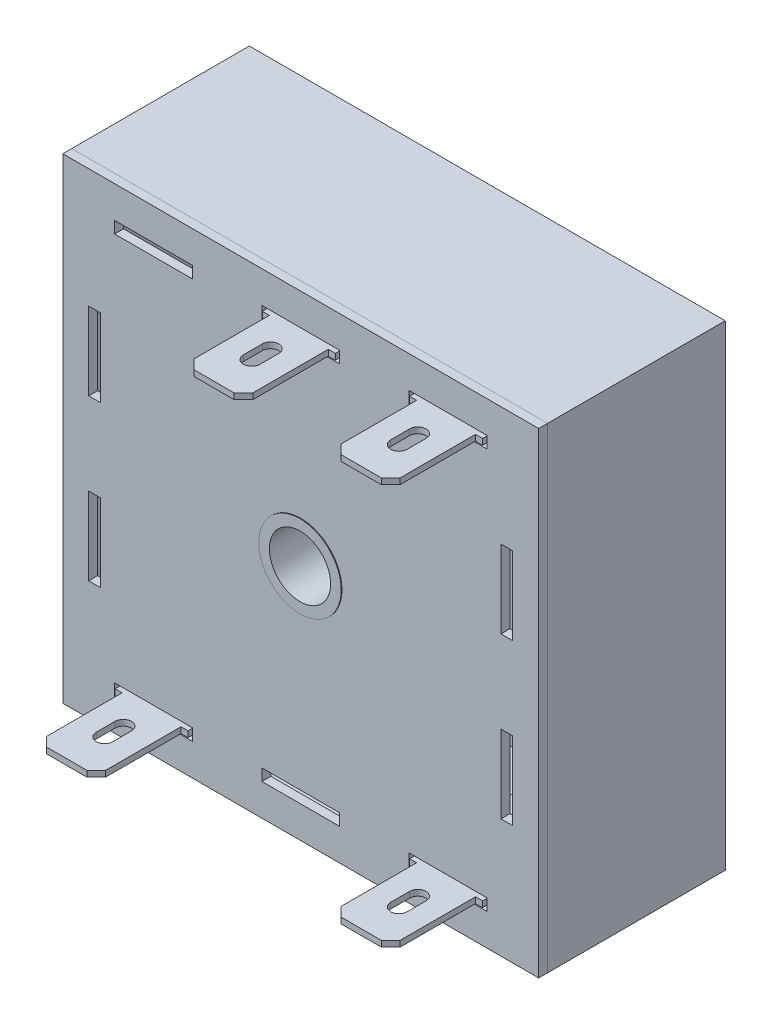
ISO-10303-21;
HEADER;
FILE_DESCRIPTION(('STEP AP214'),'2;1');
FILE_NAME('part.step','',(''),(''),'','','');
FILE_SCHEMA(('AUTOMOTIVE_DESIGN { 1 0 10303 214 1 1 1 1 }'));
ENDSEC;
DATA;
#1=APPLICATION_CONTEXT('core data for automotive mechanical design processes');
#2=APPLICATION_PROTOCOL_DEFINITION('international standard','automotive_design',2000,#1);
#3=PRODUCT_CONTEXT('',#1,'mechanical');
#4=PRODUCT('Part','Part','',(#3));
#5=PRODUCT_RELATED_PRODUCT_CATEGORY('part','',(#4));
#6=PRODUCT_DEFINITION_FORMATION('','',#4);
#7=PRODUCT_DEFINITION_CONTEXT('part definition',#1,'design');
#8=PRODUCT_DEFINITION('design','',#6,#7);
#9=PRODUCT_DEFINITION_SHAPE('','',#8);
#10=(LENGTH_UNIT() NAMED_UNIT(*) SI_UNIT(.MILLI.,.METRE.));
#11=(NAMED_UNIT(*) PLANE_ANGLE_UNIT() SI_UNIT($,.RADIAN.));
#12=(NAMED_UNIT(*) SI_UNIT($,.STERADIAN.) SOLID_ANGLE_UNIT());
#13=UNCERTAINTY_MEASURE_WITH_UNIT(LENGTH_MEASURE(1.E-05),#10,'distance_accuracy_value','');
#14=(GEOMETRIC_REPRESENTATION_CONTEXT(3) GLOBAL_UNCERTAINTY_ASSIGNED_CONTEXT((#13)) GLOBAL_UNIT_ASSIGNED_CONTEXT((#10,
#11,#12)) REPRESENTATION_CONTEXT('',''));
#15=CARTESIAN_POINT('',(0.,0.,0.));
#16=DIRECTION('',(0.,0.,1.));
#17=DIRECTION('',(1.,0.,0.));
#18=AXIS2_PLACEMENT_3D('',#15,#16,#17);
#19=CARTESIAN_POINT('',(-4.445,21.2725,-18.0086));
#20=DIRECTION('',(0.,-1.,0.));
#21=DIRECTION('',(1.,0.,0.));
#22=AXIS2_PLACEMENT_3D('',#19,#20,#21);
#23=PLANE('',#22);
#24=DIRECTION('',(0.,0.,-1.));
#25=VECTOR('',#24,1.);
#26=CARTESIAN_POINT('',(-4.445,21.2725,-2.3876));
#27=LINE('',#26,#25);
#28=CARTESIAN_POINT('',(-4.445,21.2725,-2.3876));
#29=VERTEX_POINT('',#28);
#30=CARTESIAN_POINT('',(-4.445,21.2725,-18.0086));
#31=VERTEX_POINT('',#30);
#32=EDGE_CURVE('P0_E202',#29,#31,#27,.T.);
#33=ORIENTED_EDGE('',*,*,#32,.T.);
#34=DIRECTION('',(1.,0.,0.));
#35=VECTOR('',#34,1.);
#36=CARTESIAN_POINT('',(-4.445,21.2725,-18.0086));
#37=LINE('',#36,#35);
#38=CARTESIAN_POINT('',(4.445,21.2725,-18.0086));
#39=VERTEX_POINT('',#38);
#40=EDGE_CURVE('P0_E205',#31,#39,#37,.T.);
#41=ORIENTED_EDGE('',*,*,#40,.T.);
#42=DIRECTION('',(0.,0.,1.));
#43=VECTOR('',#42,1.);
#44=CARTESIAN_POINT('',(4.445,21.2725,-18.0086));
#45=LINE('',#44,#43);
#46=CARTESIAN_POINT('',(4.445,21.2725,-2.3876));
#47=VERTEX_POINT('',#46);
#48=EDGE_CURVE('P0_E208',#39,#47,#45,.T.);
#49=ORIENTED_EDGE('',*,*,#48,.T.);
#50=DIRECTION('',(-1.,0.,0.));
#51=VECTOR('',#50,1.);
#52=CARTESIAN_POINT('',(4.445,21.2725,-2.3876));
#53=LINE('',#52,#51);
#54=CARTESIAN_POINT('',(3.175,21.2725,-2.3876));
#55=VERTEX_POINT('',#54);
#56=EDGE_CURVE('P0_E210',#47,#55,#53,.T.);
#57=ORIENTED_EDGE('',*,*,#56,.T.);
#58=DIRECTION('',(0.,0.,1.));
#59=VECTOR('',#58,1.);
#60=CARTESIAN_POINT('',(3.175,21.2725,-2.3876));
#61=LINE('',#60,#59);
#62=CARTESIAN_POINT('',(3.175,21.2725,0.1524));
#63=VERTEX_POINT('',#62);
#64=EDGE_CURVE('P0_E212',#55,#63,#61,.T.);
#65=ORIENTED_EDGE('',*,*,#64,.T.);
#66=DIRECTION('',(1.,0.,0.));
#67=VECTOR('',#66,1.);
#68=CARTESIAN_POINT('',(3.175,21.2725,0.1524));
#69=LINE('',#68,#67);
#70=CARTESIAN_POINT('',(3.937,21.2725,0.1524));
#71=VERTEX_POINT('',#70);
#72=EDGE_CURVE('P0_E214',#63,#71,#69,.T.);
#73=ORIENTED_EDGE('',*,*,#72,.T.);
#74=DIRECTION('',(0.,0.,1.));
#75=VECTOR('',#74,1.);
#76=CARTESIAN_POINT('',(3.937,21.2725,0.1524));
#77=LINE('',#76,#75);
#78=CARTESIAN_POINT('',(3.937,21.2725,1.1684));
#79=VERTEX_POINT('',#78);
#80=EDGE_CURVE('P0_E216',#71,#79,#77,.T.);
#81=ORIENTED_EDGE('',*,*,#80,.T.);
#82=DIRECTION('',(-1.,0.,0.));
#83=VECTOR('',#82,1.);
#84=CARTESIAN_POINT('',(3.937,21.2725,1.1684));
#85=LINE('',#84,#83);
#86=CARTESIAN_POINT('',(3.175,21.2725,1.1684));
#87=VERTEX_POINT('',#86);
#88=EDGE_CURVE('P0_E218',#79,#87,#85,.T.);
#89=ORIENTED_EDGE('',*,*,#88,.T.);
#90=DIRECTION('',(0.,0.,1.));
#91=VECTOR('',#90,1.);
#92=CARTESIAN_POINT('',(3.175,21.2725,1.1684));
#93=LINE('',#92,#91);
#94=CARTESIAN_POINT('',(3.175,21.2725,9.2964));
#95=VERTEX_POINT('',#94);
#96=EDGE_CURVE('P0_E220',#87,#95,#93,.T.);
#97=ORIENTED_EDGE('',*,*,#96,.T.);
#98=DIRECTION('',(-0.707106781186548,0.,0.707106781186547));
#99=VECTOR('',#98,1.);
#100=CARTESIAN_POINT('',(3.175,21.2725,9.2964));
#101=LINE('',#100,#99);
#102=CARTESIAN_POINT('',(2.159,21.2725,10.3124));
#103=VERTEX_POINT('',#102);
#104=EDGE_CURVE('P0_E222',#95,#103,#101,.T.);
#105=ORIENTED_EDGE('',*,*,#104,.T.);
#106=DIRECTION('',(-1.,0.,0.));
#107=VECTOR('',#106,1.);
#108=CARTESIAN_POINT('',(2.159,21.2725,10.3124));
#109=LINE('',#108,#107);
#110=CARTESIAN_POINT('',(-2.159,21.2725,10.3124));
#111=VERTEX_POINT('',#110);
#112=EDGE_CURVE('P0_E224',#103,#111,#109,.T.);
#113=ORIENTED_EDGE('',*,*,#112,.T.);
#114=DIRECTION('',(-0.707106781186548,0.,-0.707106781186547));
#115=VECTOR('',#114,1.);
#116=CARTESIAN_POINT('',(-2.159,21.2725,10.3124));
#117=LINE('',#116,#115);
#118=CARTESIAN_POINT('',(-3.175,21.2725,9.2964));
#119=VERTEX_POINT('',#118);
#120=EDGE_CURVE('P0_E226',#111,#119,#117,.T.);
#121=ORIENTED_EDGE('',*,*,#120,.T.);
#122=DIRECTION('',(0.,0.,-1.));
#123=VECTOR('',#122,1.);
#124=CARTESIAN_POINT('',(-3.175,21.2725,9.2964));
#125=LINE('',#124,#123);
#126=CARTESIAN_POINT('',(-3.175,21.2725,1.1684));
#127=VERTEX_POINT('',#126);
#128=EDGE_CURVE('P0_E228',#119,#127,#125,.T.);
#129=ORIENTED_EDGE('',*,*,#128,.T.);
#130=DIRECTION('',(-1.,0.,0.));
#131=VECTOR('',#130,1.);
#132=CARTESIAN_POINT('',(-3.175,21.2725,1.1684));
#133=LINE('',#132,#131);
#134=CARTESIAN_POINT('',(-3.937,21.2725,1.1684));
#135=VERTEX_POINT('',#134);
#136=EDGE_CURVE('P0_E230',#127,#135,#133,.T.);
#137=ORIENTED_EDGE('',*,*,#136,.T.);
#138=DIRECTION('',(0.,0.,-1.));
#139=VECTOR('',#138,1.);
#140=CARTESIAN_POINT('',(-3.937,21.2725,1.1684));
#141=LINE('',#140,#139);
#142=CARTESIAN_POINT('',(-3.937,21.2725,0.1524));
#143=VERTEX_POINT('',#142);
#144=EDGE_CURVE('P0_E232',#135,#143,#141,.T.);
#145=ORIENTED_EDGE('',*,*,#144,.T.);
#146=DIRECTION('',(1.,0.,0.));
#147=VECTOR('',#146,1.);
#148=CARTESIAN_POINT('',(-3.937,21.2725,0.1524));
#149=LINE('',#148,#147);
#150=CARTESIAN_POINT('',(-3.175,21.2725,0.1524));
#151=VERTEX_POINT('',#150);
#152=EDGE_CURVE('P0_E234',#143,#151,#149,.T.);
#153=ORIENTED_EDGE('',*,*,#152,.T.);
#154=DIRECTION('',(0.,0.,-1.));
#155=VECTOR('',#154,1.);
#156=CARTESIAN_POINT('',(-3.175,21.2725,0.1524));
#157=LINE('',#156,#155);
#158=CARTESIAN_POINT('',(-3.175,21.2725,-2.3876));
#159=VERTEX_POINT('',#158);
#160=EDGE_CURVE('P0_E236',#151,#159,#157,.T.);
#161=ORIENTED_EDGE('',*,*,#160,.T.);
#162=DIRECTION('',(-1.,0.,0.));
#163=VECTOR('',#162,1.);
#164=CARTESIAN_POINT('',(-3.175,21.2725,-2.3876));
#165=LINE('',#164,#163);
#166=EDGE_CURVE('P0_E238',#159,#29,#165,.T.);
#167=ORIENTED_EDGE('',*,*,#166,.T.);
#168=EDGE_LOOP('',(#33,#41,#49,#57,#65,#73,#81,#89,#97,#105,#113,#121,#129,#137,#145,#153,#161,#167));
#169=FACE_BOUND('',#168,.T.);
#170=DIRECTION('',(0.,0.,1.));
#171=VECTOR('',#170,1.);
#172=CARTESIAN_POINT('',(0.889,21.2725,6.2484));
#173=LINE('',#172,#171);
#174=CARTESIAN_POINT('',(0.889,21.2725,4.2164));
#175=VERTEX_POINT('',#174);
#176=CARTESIAN_POINT('',(0.889,21.2725,6.2484));
#177=VERTEX_POINT('',#176);
#178=EDGE_CURVE('P0_E174',#175,#177,#173,.T.);
#179=ORIENTED_EDGE('',*,*,#178,.F.);
#180=CARTESIAN_POINT('',(0.,21.2725,4.2164));
#181=DIRECTION('',(0.,-1.,0.));
#182=DIRECTION('',(1.,0.,0.));
#183=AXIS2_PLACEMENT_3D('',#180,#181,#182);
#184=CIRCLE('',#183,0.889);
#185=CARTESIAN_POINT('',(-0.889,21.2725,4.2164));
#186=VERTEX_POINT('',#185);
#187=EDGE_CURVE('P0_E166',#186,#175,#184,.T.);
#188=ORIENTED_EDGE('',*,*,#187,.F.);
#189=DIRECTION('',(0.,0.,-1.));
#190=VECTOR('',#189,1.);
#191=CARTESIAN_POINT('',(-0.889,21.2725,4.2164));
#192=LINE('',#191,#190);
#193=CARTESIAN_POINT('',(-0.889,21.2725,6.2484));
#194=VERTEX_POINT('',#193);
#195=EDGE_CURVE('P0_E188',#194,#186,#192,.T.);
#196=ORIENTED_EDGE('',*,*,#195,.F.);
#197=CARTESIAN_POINT('',(0.,21.2725,6.2484));
#198=DIRECTION('',(0.,-1.,0.));
#199=DIRECTION('',(1.,0.,0.));
#200=AXIS2_PLACEMENT_3D('',#197,#198,#199);
#201=CIRCLE('',#200,0.889);
#202=EDGE_CURVE('P0_E186',#177,#194,#201,.T.);
#203=ORIENTED_EDGE('',*,*,#202,.F.);
#204=EDGE_LOOP('',(#179,#188,#196,#203));
#205=FACE_BOUND('',#204,.T.);
#206=ADVANCED_FACE('P0_F17',(#169,#205),#23,.T.);
#207=CARTESIAN_POINT('',(-4.445,21.9075,-18.0086));
#208=DIRECTION('',(0.,-1.,0.));
#209=DIRECTION('',(1.,0.,0.));
#210=AXIS2_PLACEMENT_3D('',#207,#208,#209);
#211=PLANE('',#210);
#212=DIRECTION('',(0.,0.,-1.));
#213=VECTOR('',#212,1.);
#214=CARTESIAN_POINT('',(-4.445,21.9075,-2.3876));
#215=LINE('',#214,#213);
#216=CARTESIAN_POINT('',(-4.445,21.9075,-2.3876));
#217=VERTEX_POINT('',#216);
#218=CARTESIAN_POINT('',(-4.445,21.9075,-18.0086));
#219=VERTEX_POINT('',#218);
#220=EDGE_CURVE('P0_E182',#217,#219,#215,.T.);
#221=ORIENTED_EDGE('',*,*,#220,.F.);
#222=DIRECTION('',(-1.,0.,0.));
#223=VECTOR('',#222,1.);
#224=CARTESIAN_POINT('',(-3.175,21.9075,-2.3876));
#225=LINE('',#224,#223);
#226=CARTESIAN_POINT('',(-3.175,21.9075,-2.3876));
#227=VERTEX_POINT('',#226);
#228=EDGE_CURVE('P0_E206',#227,#217,#225,.T.);
#229=ORIENTED_EDGE('',*,*,#228,.F.);
#230=DIRECTION('',(0.,0.,-1.));
#231=VECTOR('',#230,1.);
#232=CARTESIAN_POINT('',(-3.175,21.9075,0.1524));
#233=LINE('',#232,#231);
#234=CARTESIAN_POINT('',(-3.175,21.9075,0.1524));
#235=VERTEX_POINT('',#234);
#236=EDGE_CURVE('P0_E273',#235,#227,#233,.T.);
#237=ORIENTED_EDGE('',*,*,#236,.F.);
#238=DIRECTION('',(1.,0.,0.));
#239=VECTOR('',#238,1.);
#240=CARTESIAN_POINT('',(-3.937,21.9075,0.1524));
#241=LINE('',#240,#239);
#242=CARTESIAN_POINT('',(-3.937,21.9075,0.1524));
#243=VERTEX_POINT('',#242);
#244=EDGE_CURVE('P0_E271',#243,#235,#241,.T.);
#245=ORIENTED_EDGE('',*,*,#244,.F.);
#246=DIRECTION('',(0.,0.,-1.));
#247=VECTOR('',#246,1.);
#248=CARTESIAN_POINT('',(-3.937,21.9075,1.1684));
#249=LINE('',#248,#247);
#250=CARTESIAN_POINT('',(-3.937,21.9075,1.1684));
#251=VERTEX_POINT('',#250);
#252=EDGE_CURVE('P0_E269',#251,#243,#249,.T.);
#253=ORIENTED_EDGE('',*,*,#252,.F.);
#254=DIRECTION('',(-1.,0.,0.));
#255=VECTOR('',#254,1.);
#256=CARTESIAN_POINT('',(-3.175,21.9075,1.1684));
#257=LINE('',#256,#255);
#258=CARTESIAN_POINT('',(-3.175,21.9075,1.1684));
#259=VERTEX_POINT('',#258);
#260=EDGE_CURVE('P0_E267',#259,#251,#257,.T.);
#261=ORIENTED_EDGE('',*,*,#260,.F.);
#262=DIRECTION('',(0.,0.,-1.));
#263=VECTOR('',#262,1.);
#264=CARTESIAN_POINT('',(-3.175,21.9075,9.2964));
#265=LINE('',#264,#263);
#266=CARTESIAN_POINT('',(-3.175,21.9075,9.2964));
#267=VERTEX_POINT('',#266);
#268=EDGE_CURVE('P0_E265',#267,#259,#265,.T.);
#269=ORIENTED_EDGE('',*,*,#268,.F.);
#270=DIRECTION('',(-0.707106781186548,0.,-0.707106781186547));
#271=VECTOR('',#270,1.);
#272=CARTESIAN_POINT('',(-2.159,21.9075,10.3124));
#273=LINE('',#272,#271);
#274=CARTESIAN_POINT('',(-2.159,21.9075,10.3124));
#275=VERTEX_POINT('',#274);
#276=EDGE_CURVE('P0_E263',#275,#267,#273,.T.);
#277=ORIENTED_EDGE('',*,*,#276,.F.);
#278=DIRECTION('',(-1.,0.,0.));
#279=VECTOR('',#278,1.);
#280=CARTESIAN_POINT('',(2.159,21.9075,10.3124));
#281=LINE('',#280,#279);
#282=CARTESIAN_POINT('',(2.159,21.9075,10.3124));
#283=VERTEX_POINT('',#282);
#284=EDGE_CURVE('P0_E261',#283,#275,#281,.T.);
#285=ORIENTED_EDGE('',*,*,#284,.F.);
#286=DIRECTION('',(-0.707106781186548,0.,0.707106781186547));
#287=VECTOR('',#286,1.);
#288=CARTESIAN_POINT('',(3.175,21.9075,9.2964));
#289=LINE('',#288,#287);
#290=CARTESIAN_POINT('',(3.175,21.9075,9.2964));
#291=VERTEX_POINT('',#290);
#292=EDGE_CURVE('P0_E259',#291,#283,#289,.T.);
#293=ORIENTED_EDGE('',*,*,#292,.F.);
#294=DIRECTION('',(0.,0.,1.));
#295=VECTOR('',#294,1.);
#296=CARTESIAN_POINT('',(3.175,21.9075,1.1684));
#297=LINE('',#296,#295);
#298=CARTESIAN_POINT('',(3.175,21.9075,1.1684));
#299=VERTEX_POINT('',#298);
#300=EDGE_CURVE('P0_E257',#299,#291,#297,.T.);
#301=ORIENTED_EDGE('',*,*,#300,.F.);
#302=DIRECTION('',(-1.,0.,0.));
#303=VECTOR('',#302,1.);
#304=CARTESIAN_POINT('',(3.937,21.9075,1.1684));
#305=LINE('',#304,#303);
#306=CARTESIAN_POINT('',(3.937,21.9075,1.1684));
#307=VERTEX_POINT('',#306);
#308=EDGE_CURVE('P0_E255',#307,#299,#305,.T.);
#309=ORIENTED_EDGE('',*,*,#308,.F.);
#310=DIRECTION('',(0.,0.,1.));
#311=VECTOR('',#310,1.);
#312=CARTESIAN_POINT('',(3.937,21.9075,0.1524));
#313=LINE('',#312,#311);
#314=CARTESIAN_POINT('',(3.937,21.9075,0.1524));
#315=VERTEX_POINT('',#314);
#316=EDGE_CURVE('P0_E253',#315,#307,#313,.T.);
#317=ORIENTED_EDGE('',*,*,#316,.F.);
#318=DIRECTION('',(1.,0.,0.));
#319=VECTOR('',#318,1.);
#320=CARTESIAN_POINT('',(3.175,21.9075,0.1524));
#321=LINE('',#320,#319);
#322=CARTESIAN_POINT('',(3.175,21.9075,0.1524));
#323=VERTEX_POINT('',#322);
#324=EDGE_CURVE('P0_E251',#323,#315,#321,.T.);
#325=ORIENTED_EDGE('',*,*,#324,.F.);
#326=DIRECTION('',(0.,0.,1.));
#327=VECTOR('',#326,1.);
#328=CARTESIAN_POINT('',(3.175,21.9075,-2.3876));
#329=LINE('',#328,#327);
#330=CARTESIAN_POINT('',(3.175,21.9075,-2.3876));
#331=VERTEX_POINT('',#330);
#332=EDGE_CURVE('P0_E249',#331,#323,#329,.T.);
#333=ORIENTED_EDGE('',*,*,#332,.F.);
#334=DIRECTION('',(-1.,0.,0.));
#335=VECTOR('',#334,1.);
#336=CARTESIAN_POINT('',(4.445,21.9075,-2.3876));
#337=LINE('',#336,#335);
#338=CARTESIAN_POINT('',(4.445,21.9075,-2.3876));
#339=VERTEX_POINT('',#338);
#340=EDGE_CURVE('P0_E247',#339,#331,#337,.T.);
#341=ORIENTED_EDGE('',*,*,#340,.F.);
#342=DIRECTION('',(0.,0.,1.));
#343=VECTOR('',#342,1.);
#344=CARTESIAN_POINT('',(4.445,21.9075,-18.0086));
#345=LINE('',#344,#343);
#346=CARTESIAN_POINT('',(4.445,21.9075,-18.0086));
#347=VERTEX_POINT('',#346);
#348=EDGE_CURVE('P0_E245',#347,#339,#345,.T.);
#349=ORIENTED_EDGE('',*,*,#348,.F.);
#350=DIRECTION('',(1.,0.,0.));
#351=VECTOR('',#350,1.);
#352=CARTESIAN_POINT('',(-4.445,21.9075,-18.0086));
#353=LINE('',#352,#351);
#354=EDGE_CURVE('P0_E243',#219,#347,#353,.T.);
#355=ORIENTED_EDGE('',*,*,#354,.F.);
#356=EDGE_LOOP('',(#221,#229,#237,#245,#253,#261,#269,#277,#285,#293,#301,#309,#317,#325,#333,
#341,#349,#355));
#357=FACE_BOUND('',#356,.T.);
#358=CARTESIAN_POINT('',(0.,21.9075,4.2164));
#359=DIRECTION('',(0.,-1.,0.));
#360=DIRECTION('',(1.,0.,0.));
#361=AXIS2_PLACEMENT_3D('',#358,#359,#360);
#362=CIRCLE('',#361,0.889);
#363=CARTESIAN_POINT('',(-0.889,21.9075,4.2164));
#364=VERTEX_POINT('',#363);
#365=CARTESIAN_POINT('',(0.889,21.9075,4.2164));
#366=VERTEX_POINT('',#365);
#367=EDGE_CURVE('P0_E40',#364,#366,#362,.T.);
#368=ORIENTED_EDGE('',*,*,#367,.T.);
#369=DIRECTION('',(0.,0.,1.));
#370=VECTOR('',#369,1.);
#371=CARTESIAN_POINT('',(0.889,21.9075,6.2484));
#372=LINE('',#371,#370);
#373=CARTESIAN_POINT('',(0.889,21.9075,6.2484));
#374=VERTEX_POINT('',#373);
#375=EDGE_CURVE('P0_E181',#366,#374,#372,.T.);
#376=ORIENTED_EDGE('',*,*,#375,.T.);
#377=CARTESIAN_POINT('',(0.,21.9075,6.2484));
#378=DIRECTION('',(0.,-1.,0.));
#379=DIRECTION('',(1.,0.,0.));
#380=AXIS2_PLACEMENT_3D('',#377,#378,#379);
#381=CIRCLE('',#380,0.889);
#382=CARTESIAN_POINT('',(-0.889,21.9075,6.2484));
#383=VERTEX_POINT('',#382);
#384=EDGE_CURVE('P0_E194',#374,#383,#381,.T.);
#385=ORIENTED_EDGE('',*,*,#384,.T.);
#386=DIRECTION('',(0.,0.,-1.));
#387=VECTOR('',#386,1.);
#388=CARTESIAN_POINT('',(-0.889,21.9075,4.2164));
#389=LINE('',#388,#387);
#390=EDGE_CURVE('P0_E175',#383,#364,#389,.T.);
#391=ORIENTED_EDGE('',*,*,#390,.T.);
#392=EDGE_LOOP('',(#368,#376,#385,#391));
#393=FACE_BOUND('',#392,.T.);
#394=ADVANCED_FACE('P0_F333',(#357,#393),#211,.F.);
#395=CARTESIAN_POINT('',(-4.445,21.2725,-2.3876));
#396=DIRECTION('',(1.,0.,0.));
#397=DIRECTION('',(0.,1.,0.));
#398=AXIS2_PLACEMENT_3D('',#395,#396,#397);
#399=PLANE('',#398);
#400=ORIENTED_EDGE('',*,*,#220,.T.);
#401=DIRECTION('',(0.,1.,0.));
#402=VECTOR('',#401,1.);
#403=CARTESIAN_POINT('',(-4.445,21.2725,-18.0086));
#404=LINE('',#403,#402);
#405=EDGE_CURVE('P0_E11',#31,#219,#404,.T.);
#406=ORIENTED_EDGE('',*,*,#405,.F.);
#407=ORIENTED_EDGE('',*,*,#32,.F.);
#408=DIRECTION('',(0.,1.,0.));
#409=VECTOR('',#408,1.);
#410=CARTESIAN_POINT('',(-4.445,21.2725,-2.3876));
#411=LINE('',#410,#409);
#412=EDGE_CURVE('P0_E240',#29,#217,#411,.T.);
#413=ORIENTED_EDGE('',*,*,#412,.T.);
#414=EDGE_LOOP('',(#400,#406,#407,#413));
#415=FACE_BOUND('',#414,.T.);
#416=ADVANCED_FACE('P0_F19',(#415),#399,.F.);
#417=CARTESIAN_POINT('',(-4.445,21.2725,-18.0086));
#418=DIRECTION('',(0.,0.,1.));
#419=DIRECTION('',(0.,-1.,0.));
#420=AXIS2_PLACEMENT_3D('',#417,#418,#419);
#421=PLANE('',#420);
#422=ORIENTED_EDGE('',*,*,#354,.T.);
#423=DIRECTION('',(0.,1.,0.));
#424=VECTOR('',#423,1.);
#425=CARTESIAN_POINT('',(4.445,21.2725,-18.0086));
#426=LINE('',#425,#424);
#427=EDGE_CURVE('P0_E25',#39,#347,#426,.T.);
#428=ORIENTED_EDGE('',*,*,#427,.F.);
#429=ORIENTED_EDGE('',*,*,#40,.F.);
#430=ORIENTED_EDGE('',*,*,#405,.T.);
#431=EDGE_LOOP('',(#422,#428,#429,#430));
#432=FACE_BOUND('',#431,.T.);
#433=ADVANCED_FACE('P0_F350',(#432),#421,.F.);
#434=CARTESIAN_POINT('',(4.445,21.2725,-18.0086));
#435=DIRECTION('',(-1.,0.,0.));
#436=DIRECTION('',(0.,-1.,0.));
#437=AXIS2_PLACEMENT_3D('',#434,#435,#436);
#438=PLANE('',#437);
#439=ORIENTED_EDGE('',*,*,#348,.T.);
#440=DIRECTION('',(0.,1.,0.));
#441=VECTOR('',#440,1.);
#442=CARTESIAN_POINT('',(4.445,21.2725,-2.3876));
#443=LINE('',#442,#441);
#444=EDGE_CURVE('P0_E320',#47,#339,#443,.T.);
#445=ORIENTED_EDGE('',*,*,#444,.F.);
#446=ORIENTED_EDGE('',*,*,#48,.F.);
#447=ORIENTED_EDGE('',*,*,#427,.T.);
#448=EDGE_LOOP('',(#439,#445,#446,#447));
#449=FACE_BOUND('',#448,.T.);
#450=ADVANCED_FACE('P0_F327',(#449),#438,.F.);
#451=CARTESIAN_POINT('',(4.445,21.2725,-2.3876));
#452=DIRECTION('',(0.,0.,-1.));
#453=DIRECTION('',(0.,1.,0.));
#454=AXIS2_PLACEMENT_3D('',#451,#452,#453);
#455=PLANE('',#454);
#456=ORIENTED_EDGE('',*,*,#340,.T.);
#457=DIRECTION('',(0.,1.,0.));
#458=VECTOR('',#457,1.);
#459=CARTESIAN_POINT('',(3.175,21.2725,-2.3876));
#460=LINE('',#459,#458);
#461=EDGE_CURVE('P0_E317',#55,#331,#460,.T.);
#462=ORIENTED_EDGE('',*,*,#461,.F.);
#463=ORIENTED_EDGE('',*,*,#56,.F.);
#464=ORIENTED_EDGE('',*,*,#444,.T.);
#465=EDGE_LOOP('',(#456,#462,#463,#464));
#466=FACE_BOUND('',#465,.T.);
#467=ADVANCED_FACE('P0_F339',(#466),#455,.F.);
#468=CARTESIAN_POINT('',(3.175,21.2725,-2.3876));
#469=DIRECTION('',(-1.,0.,0.));
#470=DIRECTION('',(0.,0.,-1.));
#471=AXIS2_PLACEMENT_3D('',#468,#469,#470);
#472=PLANE('',#471);
#473=ORIENTED_EDGE('',*,*,#332,.T.);
#474=DIRECTION('',(0.,1.,0.));
#475=VECTOR('',#474,1.);
#476=CARTESIAN_POINT('',(3.175,21.2725,0.1524));
#477=LINE('',#476,#475);
#478=EDGE_CURVE('P0_E314',#63,#323,#477,.T.);
#479=ORIENTED_EDGE('',*,*,#478,.F.);
#480=ORIENTED_EDGE('',*,*,#64,.F.);
#481=ORIENTED_EDGE('',*,*,#461,.T.);
#482=EDGE_LOOP('',(#473,#479,#480,#481));
#483=FACE_BOUND('',#482,.T.);
#484=ADVANCED_FACE('P0_F343',(#483),#472,.F.);
#485=CARTESIAN_POINT('',(3.175,21.2725,0.1524));
#486=DIRECTION('',(0.,0.,1.));
#487=DIRECTION('',(0.,-1.,0.));
#488=AXIS2_PLACEMENT_3D('',#485,#486,#487);
#489=PLANE('',#488);
#490=ORIENTED_EDGE('',*,*,#324,.T.);
#491=DIRECTION('',(0.,1.,0.));
#492=VECTOR('',#491,1.);
#493=CARTESIAN_POINT('',(3.937,21.2725,0.1524));
#494=LINE('',#493,#492);
#495=EDGE_CURVE('P0_E311',#71,#315,#494,.T.);
#496=ORIENTED_EDGE('',*,*,#495,.F.);
#497=ORIENTED_EDGE('',*,*,#72,.F.);
#498=ORIENTED_EDGE('',*,*,#478,.T.);
#499=EDGE_LOOP('',(#490,#496,#497,#498));
#500=FACE_BOUND('',#499,.T.);
#501=ADVANCED_FACE('P0_F413',(#500),#489,.F.);
#502=CARTESIAN_POINT('',(3.937,21.2725,0.1524));
#503=DIRECTION('',(-1.,0.,0.));
#504=DIRECTION('',(0.,-1.,0.));
#505=AXIS2_PLACEMENT_3D('',#502,#503,#504);
#506=PLANE('',#505);
#507=ORIENTED_EDGE('',*,*,#316,.T.);
#508=DIRECTION('',(0.,1.,0.));
#509=VECTOR('',#508,1.);
#510=CARTESIAN_POINT('',(3.937,21.2725,1.1684));
#511=LINE('',#510,#509);
#512=EDGE_CURVE('P0_E308',#79,#307,#511,.T.);
#513=ORIENTED_EDGE('',*,*,#512,.F.);
#514=ORIENTED_EDGE('',*,*,#80,.F.);
#515=ORIENTED_EDGE('',*,*,#495,.T.);
#516=EDGE_LOOP('',(#507,#513,#514,#515));
#517=FACE_BOUND('',#516,.T.);
#518=ADVANCED_FACE('P0_F411',(#517),#506,.F.);
#519=CARTESIAN_POINT('',(3.937,21.2725,1.1684));
#520=DIRECTION('',(0.,0.,-1.));
#521=DIRECTION('',(0.,1.,0.));
#522=AXIS2_PLACEMENT_3D('',#519,#520,#521);
#523=PLANE('',#522);
#524=ORIENTED_EDGE('',*,*,#308,.T.);
#525=DIRECTION('',(0.,1.,0.));
#526=VECTOR('',#525,1.);
#527=CARTESIAN_POINT('',(3.175,21.2725,1.1684));
#528=LINE('',#527,#526);
#529=EDGE_CURVE('P0_E305',#87,#299,#528,.T.);
#530=ORIENTED_EDGE('',*,*,#529,.F.);
#531=ORIENTED_EDGE('',*,*,#88,.F.);
#532=ORIENTED_EDGE('',*,*,#512,.T.);
#533=EDGE_LOOP('',(#524,#530,#531,#532));
#534=FACE_BOUND('',#533,.T.);
#535=ADVANCED_FACE('P0_F407',(#534),#523,.F.);
#536=CARTESIAN_POINT('',(3.175,21.2725,1.1684));
#537=DIRECTION('',(-1.,0.,0.));
#538=DIRECTION('',(0.,-1.,0.));
#539=AXIS2_PLACEMENT_3D('',#536,#537,#538);
#540=PLANE('',#539);
#541=ORIENTED_EDGE('',*,*,#300,.T.);
#542=DIRECTION('',(0.,1.,0.));
#543=VECTOR('',#542,1.);
#544=CARTESIAN_POINT('',(3.175,21.2725,9.2964));
#545=LINE('',#544,#543);
#546=EDGE_CURVE('P0_E302',#95,#291,#545,.T.);
#547=ORIENTED_EDGE('',*,*,#546,.F.);
#548=ORIENTED_EDGE('',*,*,#96,.F.);
#549=ORIENTED_EDGE('',*,*,#529,.T.);
#550=EDGE_LOOP('',(#541,#547,#548,#549));
#551=FACE_BOUND('',#550,.T.);
#552=ADVANCED_FACE('P0_F402',(#551),#540,.F.);
#553=CARTESIAN_POINT('',(3.175,21.2725,9.2964));
#554=DIRECTION('',(-0.707106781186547,0.,-0.707106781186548));
#555=DIRECTION('',(0.707106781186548,0.,-0.707106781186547));
#556=AXIS2_PLACEMENT_3D('',#553,#554,#555);
#557=PLANE('',#556);
#558=ORIENTED_EDGE('',*,*,#292,.T.);
#559=DIRECTION('',(0.,1.,0.));
#560=VECTOR('',#559,1.);
#561=CARTESIAN_POINT('',(2.159,21.2725,10.3124));
#562=LINE('',#561,#560);
#563=EDGE_CURVE('P0_E299',#103,#283,#562,.T.);
#564=ORIENTED_EDGE('',*,*,#563,.F.);
#565=ORIENTED_EDGE('',*,*,#104,.F.);
#566=ORIENTED_EDGE('',*,*,#546,.T.);
#567=EDGE_LOOP('',(#558,#564,#565,#566));
#568=FACE_BOUND('',#567,.T.);
#569=ADVANCED_FACE('P0_F396',(#568),#557,.F.);
#570=CARTESIAN_POINT('',(2.159,21.2725,10.3124));
#571=DIRECTION('',(0.,0.,-1.));
#572=DIRECTION('',(0.,1.,0.));
#573=AXIS2_PLACEMENT_3D('',#570,#571,#572);
#574=PLANE('',#573);
#575=ORIENTED_EDGE('',*,*,#284,.T.);
#576=DIRECTION('',(0.,1.,0.));
#577=VECTOR('',#576,1.);
#578=CARTESIAN_POINT('',(-2.159,21.2725,10.3124));
#579=LINE('',#578,#577);
#580=EDGE_CURVE('P0_E296',#111,#275,#579,.T.);
#581=ORIENTED_EDGE('',*,*,#580,.F.);
#582=ORIENTED_EDGE('',*,*,#112,.F.);
#583=ORIENTED_EDGE('',*,*,#563,.T.);
#584=EDGE_LOOP('',(#575,#581,#582,#583));
#585=FACE_BOUND('',#584,.T.);
#586=ADVANCED_FACE('P0_F392',(#585),#574,.F.);
#587=CARTESIAN_POINT('',(-2.159,21.2725,10.3124));
#588=DIRECTION('',(0.707106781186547,0.,-0.707106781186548));
#589=DIRECTION('',(0.707106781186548,0.,0.707106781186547));
#590=AXIS2_PLACEMENT_3D('',#587,#588,#589);
#591=PLANE('',#590);
#592=ORIENTED_EDGE('',*,*,#276,.T.);
#593=DIRECTION('',(0.,1.,0.));
#594=VECTOR('',#593,1.);
#595=CARTESIAN_POINT('',(-3.175,21.2725,9.2964));
#596=LINE('',#595,#594);
#597=EDGE_CURVE('P0_E293',#119,#267,#596,.T.);
#598=ORIENTED_EDGE('',*,*,#597,.F.);
#599=ORIENTED_EDGE('',*,*,#120,.F.);
#600=ORIENTED_EDGE('',*,*,#580,.T.);
#601=EDGE_LOOP('',(#592,#598,#599,#600));
#602=FACE_BOUND('',#601,.T.);
#603=ADVANCED_FACE('P0_F387',(#602),#591,.F.);
#604=CARTESIAN_POINT('',(-3.175,21.2725,9.2964));
#605=DIRECTION('',(1.,0.,0.));
#606=DIRECTION('',(0.,1.,0.));
#607=AXIS2_PLACEMENT_3D('',#604,#605,#606);
#608=PLANE('',#607);
#609=ORIENTED_EDGE('',*,*,#268,.T.);
#610=DIRECTION('',(0.,1.,0.));
#611=VECTOR('',#610,1.);
#612=CARTESIAN_POINT('',(-3.175,21.2725,1.1684));
#613=LINE('',#612,#611);
#614=EDGE_CURVE('P0_E290',#127,#259,#613,.T.);
#615=ORIENTED_EDGE('',*,*,#614,.F.);
#616=ORIENTED_EDGE('',*,*,#128,.F.);
#617=ORIENTED_EDGE('',*,*,#597,.T.);
#618=EDGE_LOOP('',(#609,#615,#616,#617));
#619=FACE_BOUND('',#618,.T.);
#620=ADVANCED_FACE('P0_F381',(#619),#608,.F.);
#621=CARTESIAN_POINT('',(-3.175,21.2725,1.1684));
#622=DIRECTION('',(0.,0.,-1.));
#623=DIRECTION('',(0.,1.,0.));
#624=AXIS2_PLACEMENT_3D('',#621,#622,#623);
#625=PLANE('',#624);
#626=ORIENTED_EDGE('',*,*,#260,.T.);
#627=DIRECTION('',(0.,1.,0.));
#628=VECTOR('',#627,1.);
#629=CARTESIAN_POINT('',(-3.937,21.2725,1.1684));
#630=LINE('',#629,#628);
#631=EDGE_CURVE('P0_E287',#135,#251,#630,.T.);
#632=ORIENTED_EDGE('',*,*,#631,.F.);
#633=ORIENTED_EDGE('',*,*,#136,.F.);
#634=ORIENTED_EDGE('',*,*,#614,.T.);
#635=EDGE_LOOP('',(#626,#632,#633,#634));
#636=FACE_BOUND('',#635,.T.);
#637=ADVANCED_FACE('P0_F377',(#636),#625,.F.);
#638=CARTESIAN_POINT('',(-3.937,21.2725,1.1684));
#639=DIRECTION('',(1.,0.,0.));
#640=DIRECTION('',(0.,1.,0.));
#641=AXIS2_PLACEMENT_3D('',#638,#639,#640);
#642=PLANE('',#641);
#643=ORIENTED_EDGE('',*,*,#252,.T.);
#644=DIRECTION('',(0.,1.,0.));
#645=VECTOR('',#644,1.);
#646=CARTESIAN_POINT('',(-3.937,21.2725,0.1524));
#647=LINE('',#646,#645);
#648=EDGE_CURVE('P0_E284',#143,#243,#647,.T.);
#649=ORIENTED_EDGE('',*,*,#648,.F.);
#650=ORIENTED_EDGE('',*,*,#144,.F.);
#651=ORIENTED_EDGE('',*,*,#631,.T.);
#652=EDGE_LOOP('',(#643,#649,#650,#651));
#653=FACE_BOUND('',#652,.T.);
#654=ADVANCED_FACE('P0_F372',(#653),#642,.F.);
#655=CARTESIAN_POINT('',(-3.937,21.2725,0.1524));
#656=DIRECTION('',(0.,0.,1.));
#657=DIRECTION('',(0.,-1.,0.));
#658=AXIS2_PLACEMENT_3D('',#655,#656,#657);
#659=PLANE('',#658);
#660=ORIENTED_EDGE('',*,*,#244,.T.);
#661=DIRECTION('',(0.,1.,0.));
#662=VECTOR('',#661,1.);
#663=CARTESIAN_POINT('',(-3.175,21.2725,0.1524));
#664=LINE('',#663,#662);
#665=EDGE_CURVE('P0_E281',#151,#235,#664,.T.);
#666=ORIENTED_EDGE('',*,*,#665,.F.);
#667=ORIENTED_EDGE('',*,*,#152,.F.);
#668=ORIENTED_EDGE('',*,*,#648,.T.);
#669=EDGE_LOOP('',(#660,#666,#667,#668));
#670=FACE_BOUND('',#669,.T.);
#671=ADVANCED_FACE('P0_F366',(#670),#659,.F.);
#672=CARTESIAN_POINT('',(-3.175,21.2725,0.1524));
#673=DIRECTION('',(1.,0.,0.));
#674=DIRECTION('',(0.,0.,1.));
#675=AXIS2_PLACEMENT_3D('',#672,#673,#674);
#676=PLANE('',#675);
#677=ORIENTED_EDGE('',*,*,#236,.T.);
#678=DIRECTION('',(0.,1.,0.));
#679=VECTOR('',#678,1.);
#680=CARTESIAN_POINT('',(-3.175,21.2725,-2.3876));
#681=LINE('',#680,#679);
#682=EDGE_CURVE('P0_E278',#159,#227,#681,.T.);
#683=ORIENTED_EDGE('',*,*,#682,.F.);
#684=ORIENTED_EDGE('',*,*,#160,.F.);
#685=ORIENTED_EDGE('',*,*,#665,.T.);
#686=EDGE_LOOP('',(#677,#683,#684,#685));
#687=FACE_BOUND('',#686,.T.);
#688=ADVANCED_FACE('P0_F362',(#687),#676,.F.);
#689=CARTESIAN_POINT('',(-3.175,21.2725,-2.3876));
#690=DIRECTION('',(0.,0.,-1.));
#691=DIRECTION('',(0.,1.,0.));
#692=AXIS2_PLACEMENT_3D('',#689,#690,#691);
#693=PLANE('',#692);
#694=ORIENTED_EDGE('',*,*,#228,.T.);
#695=ORIENTED_EDGE('',*,*,#412,.F.);
#696=ORIENTED_EDGE('',*,*,#166,.F.);
#697=ORIENTED_EDGE('',*,*,#682,.T.);
#698=EDGE_LOOP('',(#694,#695,#696,#697));
#699=FACE_BOUND('',#698,.T.);
#700=ADVANCED_FACE('P0_F357',(#699),#693,.F.);
#701=CARTESIAN_POINT('',(0.,21.2725,4.2164));
#702=DIRECTION('',(0.,1.,0.));
#703=DIRECTION('',(-1.,0.,0.));
#704=AXIS2_PLACEMENT_3D('',#701,#702,#703);
#705=CYLINDRICAL_SURFACE('',#704,0.889);
#706=ORIENTED_EDGE('',*,*,#367,.F.);
#707=DIRECTION('',(0.,1.,0.));
#708=VECTOR('',#707,1.);
#709=CARTESIAN_POINT('',(-0.889,21.2725,4.2164));
#710=LINE('',#709,#708);
#711=EDGE_CURVE('P0_E170',#186,#364,#710,.T.);
#712=ORIENTED_EDGE('',*,*,#711,.F.);
#713=ORIENTED_EDGE('',*,*,#187,.T.);
#714=DIRECTION('',(0.,1.,0.));
#715=VECTOR('',#714,1.);
#716=CARTESIAN_POINT('',(0.889,21.2725,4.2164));
#717=LINE('',#716,#715);
#718=EDGE_CURVE('P0_E169',#175,#366,#717,.T.);
#719=ORIENTED_EDGE('',*,*,#718,.T.);
#720=EDGE_LOOP('',(#706,#712,#713,#719));
#721=FACE_BOUND('',#720,.T.);
#722=ADVANCED_FACE('P0_F168',(#721),#705,.F.);
#723=CARTESIAN_POINT('',(0.889,21.2725,6.2484));
#724=DIRECTION('',(-1.,0.,0.));
#725=DIRECTION('',(0.,-1.,0.));
#726=AXIS2_PLACEMENT_3D('',#723,#724,#725);
#727=PLANE('',#726);
#728=ORIENTED_EDGE('',*,*,#375,.F.);
#729=ORIENTED_EDGE('',*,*,#718,.F.);
#730=ORIENTED_EDGE('',*,*,#178,.T.);
#731=DIRECTION('',(0.,1.,0.));
#732=VECTOR('',#731,1.);
#733=CARTESIAN_POINT('',(0.889,21.2725,6.2484));
#734=LINE('',#733,#732);
#735=EDGE_CURVE('P0_E183',#177,#374,#734,.T.);
#736=ORIENTED_EDGE('',*,*,#735,.T.);
#737=EDGE_LOOP('',(#728,#729,#730,#736));
#738=FACE_BOUND('',#737,.T.);
#739=ADVANCED_FACE('P0_F178',(#738),#727,.T.);
#740=CARTESIAN_POINT('',(0.,21.2725,6.2484));
#741=DIRECTION('',(0.,1.,0.));
#742=DIRECTION('',(-1.,0.,0.));
#743=AXIS2_PLACEMENT_3D('',#740,#741,#742);
#744=CYLINDRICAL_SURFACE('',#743,0.889);
#745=ORIENTED_EDGE('',*,*,#384,.F.);
#746=ORIENTED_EDGE('',*,*,#735,.F.);
#747=ORIENTED_EDGE('',*,*,#202,.T.);
#748=DIRECTION('',(0.,1.,0.));
#749=VECTOR('',#748,1.);
#750=CARTESIAN_POINT('',(-0.889,21.2725,6.2484));
#751=LINE('',#750,#749);
#752=EDGE_CURVE('P0_E32',#194,#383,#751,.T.);
#753=ORIENTED_EDGE('',*,*,#752,.T.);
#754=EDGE_LOOP('',(#745,#746,#747,#753));
#755=FACE_BOUND('',#754,.T.);
#756=ADVANCED_FACE('P0_F511',(#755),#744,.F.);
#757=CARTESIAN_POINT('',(-0.889,21.2725,4.2164));
#758=DIRECTION('',(1.,0.,0.));
#759=DIRECTION('',(0.,1.,0.));
#760=AXIS2_PLACEMENT_3D('',#757,#758,#759);
#761=PLANE('',#760);
#762=ORIENTED_EDGE('',*,*,#390,.F.);
#763=ORIENTED_EDGE('',*,*,#752,.F.);
#764=ORIENTED_EDGE('',*,*,#195,.T.);
#765=ORIENTED_EDGE('',*,*,#711,.T.);
#766=EDGE_LOOP('',(#762,#763,#764,#765));
#767=FACE_BOUND('',#766,.T.);
#768=ADVANCED_FACE('P0_F517',(#767),#761,.T.);
#769=CLOSED_SHELL('',(#206,#394,#416,#433,#450,#467,#484,#501,#518,#535,#552,#569,#586,#603,
#620,#637,#654,#671,#688,#700,#722,#739,#756,#768));
#770=MANIFOLD_SOLID_BREP('P0_B1',#769);
#771=CARTESIAN_POINT('',(-25.654,-25.654,0.9652));
#772=DIRECTION('',(0.,0.,1.));
#773=DIRECTION('',(0.,-1.,0.));
#774=AXIS2_PLACEMENT_3D('',#771,#772,#773);
#775=PLANE('',#774);
#776=DIRECTION('',(0.,1.,0.));
#777=VECTOR('',#776,1.);
#778=CARTESIAN_POINT('',(22.86,4.445,0.9652));
#779=LINE('',#778,#777);
#780=CARTESIAN_POINT('',(22.86,4.445,0.9652));
#781=VERTEX_POINT('',#780);
#782=CARTESIAN_POINT('',(22.86,12.827,0.9652));
#783=VERTEX_POINT('',#782);
#784=EDGE_CURVE('P1_E336',#781,#783,#779,.T.);
#785=ORIENTED_EDGE('',*,*,#784,.F.);
#786=DIRECTION('',(1.,0.,0.));
#787=VECTOR('',#786,1.);
#788=CARTESIAN_POINT('',(21.59,4.445,0.9652));
#789=LINE('',#788,#787);
#790=CARTESIAN_POINT('',(21.59,4.445,0.9652));
#791=VERTEX_POINT('',#790);
#792=EDGE_CURVE('P1_E334',#791,#781,#789,.T.);
#793=ORIENTED_EDGE('',*,*,#792,.F.);
#794=DIRECTION('',(0.,-1.,0.));
#795=VECTOR('',#794,1.);
#796=CARTESIAN_POINT('',(21.59,4.445,0.9652));
#797=LINE('',#796,#795);
#798=CARTESIAN_POINT('',(21.59,12.827,0.9652));
#799=VERTEX_POINT('',#798);
#800=EDGE_CURVE('P1_E342',#799,#791,#797,.T.);
#801=ORIENTED_EDGE('',*,*,#800,.F.);
#802=DIRECTION('',(-1.,0.,0.));
#803=VECTOR('',#802,1.);
#804=CARTESIAN_POINT('',(21.59,12.827,0.9652));
#805=LINE('',#804,#803);
#806=EDGE_CURVE('P1_E339',#783,#799,#805,.T.);
#807=ORIENTED_EDGE('',*,*,#806,.F.);
#808=EDGE_LOOP('',(#785,#793,#801,#807));
#809=FACE_BOUND('',#808,.T.);
#810=DIRECTION('',(1.,0.,0.));
#811=VECTOR('',#810,1.);
#812=CARTESIAN_POINT('',(-22.86,-12.827,0.9652));
#813=LINE('',#812,#811);
#814=CARTESIAN_POINT('',(-22.86,-12.827,0.9652));
#815=VERTEX_POINT('',#814);
#816=CARTESIAN_POINT('',(-21.59,-12.827,0.9652));
#817=VERTEX_POINT('',#816);
#818=EDGE_CURVE('P1_E398',#815,#817,#813,.T.);
#819=ORIENTED_EDGE('',*,*,#818,.F.);
#820=DIRECTION('',(0.,-1.,0.));
#821=VECTOR('',#820,1.);
#822=CARTESIAN_POINT('',(-22.86,-4.445,0.9652));
#823=LINE('',#822,#821);
#824=CARTESIAN_POINT('',(-22.86,-4.445,0.9652));
#825=VERTEX_POINT('',#824);
#826=EDGE_CURVE('P1_E396',#825,#815,#823,.T.);
#827=ORIENTED_EDGE('',*,*,#826,.F.);
#828=DIRECTION('',(-1.,0.,0.));
#829=VECTOR('',#828,1.);
#830=CARTESIAN_POINT('',(-22.86,-4.445,0.9652));
#831=LINE('',#830,#829);
#832=CARTESIAN_POINT('',(-21.59,-4.445,0.9652));
#833=VERTEX_POINT('',#832);
#834=EDGE_CURVE('P1_E404',#833,#825,#831,.T.);
#835=ORIENTED_EDGE('',*,*,#834,.F.);
#836=DIRECTION('',(0.,1.,0.));
#837=VECTOR('',#836,1.);
#838=CARTESIAN_POINT('',(-21.59,-4.445,0.9652));
#839=LINE('',#838,#837);
#840=EDGE_CURVE('P1_E401',#817,#833,#839,.T.);
#841=ORIENTED_EDGE('',*,*,#840,.F.);
#842=EDGE_LOOP('',(#819,#827,#835,#841));
#843=FACE_BOUND('',#842,.T.);
#844=DIRECTION('',(1.,0.,0.));
#845=VECTOR('',#844,1.);
#846=CARTESIAN_POINT('',(11.684,-22.225,0.9652));
#847=LINE('',#846,#845);
#848=CARTESIAN_POINT('',(11.684,-22.225,0.9652));
#849=VERTEX_POINT('',#848);
#850=CARTESIAN_POINT('',(20.066,-22.225,0.9652));
#851=VERTEX_POINT('',#850);
#852=EDGE_CURVE('P1_E460',#849,#851,#847,.T.);
#853=ORIENTED_EDGE('',*,*,#852,.F.);
#854=DIRECTION('',(0.,-1.,0.));
#855=VECTOR('',#854,1.);
#856=CARTESIAN_POINT('',(11.684,-20.955,0.9652));
#857=LINE('',#856,#855);
#858=CARTESIAN_POINT('',(11.684,-20.955,0.9652));
#859=VERTEX_POINT('',#858);
#860=EDGE_CURVE('P1_E458',#859,#849,#857,.T.);
#861=ORIENTED_EDGE('',*,*,#860,.F.);
#862=DIRECTION('',(-1.,0.,0.));
#863=VECTOR('',#862,1.);
#864=CARTESIAN_POINT('',(11.684,-20.955,0.9652));
#865=LINE('',#864,#863);
#866=CARTESIAN_POINT('',(20.066,-20.955,0.9652));
#867=VERTEX_POINT('',#866);
#868=EDGE_CURVE('P1_E466',#867,#859,#865,.T.);
#869=ORIENTED_EDGE('',*,*,#868,.F.);
#870=DIRECTION('',(0.,1.,0.));
#871=VECTOR('',#870,1.);
#872=CARTESIAN_POINT('',(20.066,-20.955,0.9652));
#873=LINE('',#872,#871);
#874=EDGE_CURVE('P1_E463',#851,#867,#873,.T.);
#875=ORIENTED_EDGE('',*,*,#874,.F.);
#876=EDGE_LOOP('',(#853,#861,#869,#875));
#877=FACE_BOUND('',#876,.T.);
#878=DIRECTION('',(1.,0.,0.));
#879=VECTOR('',#878,1.);
#880=CARTESIAN_POINT('',(-20.066,-22.225,0.9652));
#881=LINE('',#880,#879);
#882=CARTESIAN_POINT('',(-20.066,-22.225,0.9652));
#883=VERTEX_POINT('',#882);
#884=CARTESIAN_POINT('',(-11.684,-22.225,0.9652));
#885=VERTEX_POINT('',#884);
#886=EDGE_CURVE('P1_E522',#883,#885,#881,.T.);
#887=ORIENTED_EDGE('',*,*,#886,.F.);
#888=DIRECTION('',(0.,-1.,0.));
#889=VECTOR('',#888,1.);
#890=CARTESIAN_POINT('',(-20.066,-20.955,0.9652));
#891=LINE('',#890,#889);
#892=CARTESIAN_POINT('',(-20.066,-20.955,0.9652));
#893=VERTEX_POINT('',#892);
#894=EDGE_CURVE('P1_E520',#893,#883,#891,.T.);
#895=ORIENTED_EDGE('',*,*,#894,.F.);
#896=DIRECTION('',(-1.,0.,0.));
#897=VECTOR('',#896,1.);
#898=CARTESIAN_POINT('',(-20.066,-20.955,0.9652));
#899=LINE('',#898,#897);
#900=CARTESIAN_POINT('',(-11.684,-20.955,0.9652));
#901=VERTEX_POINT('',#900);
#902=EDGE_CURVE('P1_E528',#901,#893,#899,.T.);
#903=ORIENTED_EDGE('',*,*,#902,.F.);
#904=DIRECTION('',(0.,1.,0.));
#905=VECTOR('',#904,1.);
#906=CARTESIAN_POINT('',(-11.684,-20.955,0.9652));
#907=LINE('',#906,#905);
#908=EDGE_CURVE('P1_E525',#885,#901,#907,.T.);
#909=ORIENTED_EDGE('',*,*,#908,.F.);
#910=EDGE_LOOP('',(#887,#895,#903,#909));
#911=FACE_BOUND('',#910,.T.);
#912=DIRECTION('',(0.,1.,0.));
#913=VECTOR('',#912,1.);
#914=CARTESIAN_POINT('',(20.066,20.955,0.9652));
#915=LINE('',#914,#913);
#916=CARTESIAN_POINT('',(20.066,20.955,0.9652));
#917=VERTEX_POINT('',#916);
#918=CARTESIAN_POINT('',(20.066,22.225,0.9652));
#919=VERTEX_POINT('',#918);
#920=EDGE_CURVE('P1_E584',#917,#919,#915,.T.);
#921=ORIENTED_EDGE('',*,*,#920,.F.);
#922=DIRECTION('',(1.,0.,0.));
#923=VECTOR('',#922,1.);
#924=CARTESIAN_POINT('',(11.684,20.955,0.9652));
#925=LINE('',#924,#923);
#926=CARTESIAN_POINT('',(11.684,20.955,0.9652));
#927=VERTEX_POINT('',#926);
#928=EDGE_CURVE('P1_E582',#927,#917,#925,.T.);
#929=ORIENTED_EDGE('',*,*,#928,.F.);
#930=DIRECTION('',(0.,-1.,0.));
#931=VECTOR('',#930,1.);
#932=CARTESIAN_POINT('',(11.684,20.955,0.9652));
#933=LINE('',#932,#931);
#934=CARTESIAN_POINT('',(11.684,22.225,0.9652));
#935=VERTEX_POINT('',#934);
#936=EDGE_CURVE('P1_E590',#935,#927,#933,.T.);
#937=ORIENTED_EDGE('',*,*,#936,.F.);
#938=DIRECTION('',(-1.,0.,0.));
#939=VECTOR('',#938,1.);
#940=CARTESIAN_POINT('',(11.684,22.225,0.9652));
#941=LINE('',#940,#939);
#942=EDGE_CURVE('P1_E587',#919,#935,#941,.T.);
#943=ORIENTED_EDGE('',*,*,#942,.F.);
#944=EDGE_LOOP('',(#921,#929,#937,#943));
#945=FACE_BOUND('',#944,.T.);
#946=DIRECTION('',(0.,-1.,0.));
#947=VECTOR('',#946,1.);
#948=CARTESIAN_POINT('',(-25.654,25.654,0.9652));
#949=LINE('',#948,#947);
#950=CARTESIAN_POINT('',(-25.654,25.654,0.9652));
#951=VERTEX_POINT('',#950);
#952=CARTESIAN_POINT('',(-25.654,-25.654,0.9652));
#953=VERTEX_POINT('',#952);
#954=EDGE_CURVE('P1_E619',#951,#953,#949,.T.);
#955=ORIENTED_EDGE('',*,*,#954,.T.);
#956=DIRECTION('',(1.,0.,0.));
#957=VECTOR('',#956,1.);
#958=CARTESIAN_POINT('',(-25.654,-25.654,0.9652));
#959=LINE('',#958,#957);
#960=CARTESIAN_POINT('',(25.654,-25.654,0.9652));
#961=VERTEX_POINT('',#960);
#962=EDGE_CURVE('P1_E622',#953,#961,#959,.T.);
#963=ORIENTED_EDGE('',*,*,#962,.T.);
#964=DIRECTION('',(0.,1.,0.));
#965=VECTOR('',#964,1.);
#966=CARTESIAN_POINT('',(25.654,25.654,0.9652));
#967=LINE('',#966,#965);
#968=CARTESIAN_POINT('',(25.654,25.654,0.9652));
#969=VERTEX_POINT('',#968);
#970=EDGE_CURVE('P1_E625',#961,#969,#967,.T.);
#971=ORIENTED_EDGE('',*,*,#970,.T.);
#972=DIRECTION('',(-1.,0.,0.));
#973=VECTOR('',#972,1.);
#974=CARTESIAN_POINT('',(-25.654,25.654,0.9652));
#975=LINE('',#974,#973);
#976=EDGE_CURVE('P1_E627',#969,#951,#975,.T.);
#977=ORIENTED_EDGE('',*,*,#976,.T.);
#978=EDGE_LOOP('',(#955,#963,#971,#977));
#979=FACE_BOUND('',#978,.T.);
#980=CARTESIAN_POINT('',(0.,0.,0.9652));
#981=DIRECTION('',(0.,0.,1.));
#982=DIRECTION('',(0.,-1.,0.));
#983=AXIS2_PLACEMENT_3D('',#980,#981,#982);
#984=CIRCLE('',#983,4.445);
#985=CARTESIAN_POINT('',(0.,-4.445,0.9652));
#986=VERTEX_POINT('',#985);
#987=EDGE_CURVE('P1_E613',#986,#986,#984,.T.);
#988=ORIENTED_EDGE('',*,*,#987,.F.);
#989=EDGE_LOOP('',(#988));
#990=FACE_BOUND('',#989,.T.);
#991=DIRECTION('',(0.,1.,0.));
#992=VECTOR('',#991,1.);
#993=CARTESIAN_POINT('',(4.191,20.955,0.9652));
#994=LINE('',#993,#992);
#995=CARTESIAN_POINT('',(4.191,20.955,0.9652));
#996=VERTEX_POINT('',#995);
#997=CARTESIAN_POINT('',(4.191,22.225,0.9652));
#998=VERTEX_POINT('',#997);
#999=EDGE_CURVE('P1_E553',#996,#998,#994,.T.);
#1000=ORIENTED_EDGE('',*,*,#999,.F.);
#1001=DIRECTION('',(1.,0.,0.));
#1002=VECTOR('',#1001,1.);
#1003=CARTESIAN_POINT('',(-4.191,20.955,0.9652));
#1004=LINE('',#1003,#1002);
#1005=CARTESIAN_POINT('',(-4.191,20.955,0.9652));
#1006=VERTEX_POINT('',#1005);
#1007=EDGE_CURVE('P1_E551',#1006,#996,#1004,.T.);
#1008=ORIENTED_EDGE('',*,*,#1007,.F.);
#1009=DIRECTION('',(0.,-1.,0.));
#1010=VECTOR('',#1009,1.);
#1011=CARTESIAN_POINT('',(-4.191,20.955,0.9652));
#1012=LINE('',#1011,#1010);
#1013=CARTESIAN_POINT('',(-4.191,22.225,0.9652));
#1014=VERTEX_POINT('',#1013);
#1015=EDGE_CURVE('P1_E559',#1014,#1006,#1012,.T.);
#1016=ORIENTED_EDGE('',*,*,#1015,.F.);
#1017=DIRECTION('',(-1.,0.,0.));
#1018=VECTOR('',#1017,1.);
#1019=CARTESIAN_POINT('',(-4.191,22.225,0.9652));
#1020=LINE('',#1019,#1018);
#1021=EDGE_CURVE('P1_E556',#998,#1014,#1020,.T.);
#1022=ORIENTED_EDGE('',*,*,#1021,.F.);
#1023=EDGE_LOOP('',(#1000,#1008,#1016,#1022));
#1024=FACE_BOUND('',#1023,.T.);
#1025=DIRECTION('',(1.,0.,0.));
#1026=VECTOR('',#1025,1.);
#1027=CARTESIAN_POINT('',(-4.191,-22.225,0.9652));
#1028=LINE('',#1027,#1026);
#1029=CARTESIAN_POINT('',(-4.191,-22.225,0.9652));
#1030=VERTEX_POINT('',#1029);
#1031=CARTESIAN_POINT('',(4.191,-22.225,0.9652));
#1032=VERTEX_POINT('',#1031);
#1033=EDGE_CURVE('P1_E491',#1030,#1032,#1028,.T.);
#1034=ORIENTED_EDGE('',*,*,#1033,.F.);
#1035=DIRECTION('',(0.,-1.,0.));
#1036=VECTOR('',#1035,1.);
#1037=CARTESIAN_POINT('',(-4.191,-20.955,0.9652));
#1038=LINE('',#1037,#1036);
#1039=CARTESIAN_POINT('',(-4.191,-20.955,0.9652));
#1040=VERTEX_POINT('',#1039);
#1041=EDGE_CURVE('P1_E489',#1040,#1030,#1038,.T.);
#1042=ORIENTED_EDGE('',*,*,#1041,.F.);
#1043=DIRECTION('',(-1.,0.,0.));
#1044=VECTOR('',#1043,1.);
#1045=CARTESIAN_POINT('',(-4.191,-20.955,0.9652));
#1046=LINE('',#1045,#1044);
#1047=CARTESIAN_POINT('',(4.191,-20.955,0.9652));
#1048=VERTEX_POINT('',#1047);
#1049=EDGE_CURVE('P1_E497',#1048,#1040,#1046,.T.);
#1050=ORIENTED_EDGE('',*,*,#1049,.F.);
#1051=DIRECTION('',(0.,1.,0.));
#1052=VECTOR('',#1051,1.);
#1053=CARTESIAN_POINT('',(4.191,-20.955,0.9652));
#1054=LINE('',#1053,#1052);
#1055=EDGE_CURVE('P1_E494',#1032,#1048,#1054,.T.);
#1056=ORIENTED_EDGE('',*,*,#1055,.F.);
#1057=EDGE_LOOP('',(#1034,#1042,#1050,#1056));
#1058=FACE_BOUND('',#1057,.T.);
#1059=DIRECTION('',(1.,0.,0.));
#1060=VECTOR('',#1059,1.);
#1061=CARTESIAN_POINT('',(21.59,-12.827,0.9652));
#1062=LINE('',#1061,#1060);
#1063=CARTESIAN_POINT('',(21.59,-12.827,0.9652));
#1064=VERTEX_POINT('',#1063);
#1065=CARTESIAN_POINT('',(22.86,-12.827,0.9652));
#1066=VERTEX_POINT('',#1065);
#1067=EDGE_CURVE('P1_E429',#1064,#1066,#1062,.T.);
#1068=ORIENTED_EDGE('',*,*,#1067,.F.);
#1069=DIRECTION('',(0.,-1.,0.));
#1070=VECTOR('',#1069,1.);
#1071=CARTESIAN_POINT('',(21.59,-4.445,0.9652));
#1072=LINE('',#1071,#1070);
#1073=CARTESIAN_POINT('',(21.59,-4.445,0.9652));
#1074=VERTEX_POINT('',#1073);
#1075=EDGE_CURVE('P1_E427',#1074,#1064,#1072,.T.);
#1076=ORIENTED_EDGE('',*,*,#1075,.F.);
#1077=DIRECTION('',(-1.,0.,0.));
#1078=VECTOR('',#1077,1.);
#1079=CARTESIAN_POINT('',(21.59,-4.445,0.9652));
#1080=LINE('',#1079,#1078);
#1081=CARTESIAN_POINT('',(22.86,-4.445,0.9652));
#1082=VERTEX_POINT('',#1081);
#1083=EDGE_CURVE('P1_E435',#1082,#1074,#1080,.T.);
#1084=ORIENTED_EDGE('',*,*,#1083,.F.);
#1085=DIRECTION('',(0.,1.,0.));
#1086=VECTOR('',#1085,1.);
#1087=CARTESIAN_POINT('',(22.86,-4.445,0.9652));
#1088=LINE('',#1087,#1086);
#1089=EDGE_CURVE('P1_E432',#1066,#1082,#1088,.T.);
#1090=ORIENTED_EDGE('',*,*,#1089,.F.);
#1091=EDGE_LOOP('',(#1068,#1076,#1084,#1090));
#1092=FACE_BOUND('',#1091,.T.);
#1093=DIRECTION('',(0.,1.,0.));
#1094=VECTOR('',#1093,1.);
#1095=CARTESIAN_POINT('',(-11.684,20.955,0.9652));
#1096=LINE('',#1095,#1094);
#1097=CARTESIAN_POINT('',(-11.684,20.955,0.9652));
#1098=VERTEX_POINT('',#1097);
#1099=CARTESIAN_POINT('',(-11.684,22.225,0.9652));
#1100=VERTEX_POINT('',#1099);
#1101=EDGE_CURVE('P1_E367',#1098,#1100,#1096,.T.);
#1102=ORIENTED_EDGE('',*,*,#1101,.F.);
#1103=DIRECTION('',(1.,0.,0.));
#1104=VECTOR('',#1103,1.);
#1105=CARTESIAN_POINT('',(-20.066,20.955,0.9652));
#1106=LINE('',#1105,#1104);
#1107=CARTESIAN_POINT('',(-20.066,20.955,0.9652));
#1108=VERTEX_POINT('',#1107);
#1109=EDGE_CURVE('P1_E365',#1108,#1098,#1106,.T.);
#1110=ORIENTED_EDGE('',*,*,#1109,.F.);
#1111=DIRECTION('',(0.,-1.,0.));
#1112=VECTOR('',#1111,1.);
#1113=CARTESIAN_POINT('',(-20.066,20.955,0.9652));
#1114=LINE('',#1113,#1112);
#1115=CARTESIAN_POINT('',(-20.066,22.225,0.9652));
#1116=VERTEX_POINT('',#1115);
#1117=EDGE_CURVE('P1_E373',#1116,#1108,#1114,.T.);
#1118=ORIENTED_EDGE('',*,*,#1117,.F.);
#1119=DIRECTION('',(-1.,0.,0.));
#1120=VECTOR('',#1119,1.);
#1121=CARTESIAN_POINT('',(-20.066,22.225,0.9652));
#1122=LINE('',#1121,#1120);
#1123=EDGE_CURVE('P1_E370',#1100,#1116,#1122,.T.);
#1124=ORIENTED_EDGE('',*,*,#1123,.F.);
#1125=EDGE_LOOP('',(#1102,#1110,#1118,#1124));
#1126=FACE_BOUND('',#1125,.T.);
#1127=DIRECTION('',(0.,1.,0.));
#1128=VECTOR('',#1127,1.);
#1129=CARTESIAN_POINT('',(-21.59,4.445,0.9652));
#1130=LINE('',#1129,#1128);
#1131=CARTESIAN_POINT('',(-21.59,4.445,0.9652));
#1132=VERTEX_POINT('',#1131);
#1133=CARTESIAN_POINT('',(-21.59,12.827,0.9652));
#1134=VERTEX_POINT('',#1133);
#1135=EDGE_CURVE('P1_E306',#1132,#1134,#1130,.T.);
#1136=ORIENTED_EDGE('',*,*,#1135,.F.);
#1137=DIRECTION('',(1.,0.,0.));
#1138=VECTOR('',#1137,1.);
#1139=CARTESIAN_POINT('',(-22.86,4.445,0.9652));
#1140=LINE('',#1139,#1138);
#1141=CARTESIAN_POINT('',(-22.86,4.445,0.9652));
#1142=VERTEX_POINT('',#1141);
#1143=EDGE_CURVE('P1_E298',#1142,#1132,#1140,.T.);
#1144=ORIENTED_EDGE('',*,*,#1143,.F.);
#1145=DIRECTION('',(0.,-1.,0.));
#1146=VECTOR('',#1145,1.);
#1147=CARTESIAN_POINT('',(-22.86,4.445,0.9652));
#1148=LINE('',#1147,#1146);
#1149=CARTESIAN_POINT('',(-22.86,12.827,0.9652));
#1150=VERTEX_POINT('',#1149);
#1151=EDGE_CURVE('P1_E320',#1150,#1142,#1148,.T.);
#1152=ORIENTED_EDGE('',*,*,#1151,.F.);
#1153=DIRECTION('',(-1.,0.,0.));
#1154=VECTOR('',#1153,1.);
#1155=CARTESIAN_POINT('',(-22.86,12.827,0.9652));
#1156=LINE('',#1155,#1154);
#1157=EDGE_CURVE('P1_E318',#1134,#1150,#1156,.T.);
#1158=ORIENTED_EDGE('',*,*,#1157,.F.);
#1159=EDGE_LOOP('',(#1136,#1144,#1152,#1158));
#1160=FACE_BOUND('',#1159,.T.);
#1161=ADVANCED_FACE('P1_F17',(#809,#843,#877,#911,#945,#979,#990,#1024,#1058,#1092,#1126,#1160),
#775,.T.);
#1162=CARTESIAN_POINT('',(-25.654,-25.654,0.));
#1163=DIRECTION('',(0.,0.,1.));
#1164=DIRECTION('',(0.,-1.,0.));
#1165=AXIS2_PLACEMENT_3D('',#1162,#1163,#1164);
#1166=PLANE('',#1165);
#1167=DIRECTION('',(1.,0.,0.));
#1168=VECTOR('',#1167,1.);
#1169=CARTESIAN_POINT('',(21.59,4.445,0.));
#1170=LINE('',#1169,#1168);
#1171=CARTESIAN_POINT('',(21.59,4.445,0.));
#1172=VERTEX_POINT('',#1171);
#1173=CARTESIAN_POINT('',(22.86,4.445,0.));
#1174=VERTEX_POINT('',#1173);
#1175=EDGE_CURVE('P1_E314',#1172,#1174,#1170,.T.);
#1176=ORIENTED_EDGE('',*,*,#1175,.T.);
#1177=DIRECTION('',(0.,1.,0.));
#1178=VECTOR('',#1177,1.);
#1179=CARTESIAN_POINT('',(22.86,4.445,0.));
#1180=LINE('',#1179,#1178);
#1181=CARTESIAN_POINT('',(22.86,12.827,0.));
#1182=VERTEX_POINT('',#1181);
#1183=EDGE_CURVE('P1_E347',#1174,#1182,#1180,.T.);
#1184=ORIENTED_EDGE('',*,*,#1183,.T.);
#1185=DIRECTION('',(-1.,0.,0.));
#1186=VECTOR('',#1185,1.);
#1187=CARTESIAN_POINT('',(21.59,12.827,0.));
#1188=LINE('',#1187,#1186);
#1189=CARTESIAN_POINT('',(21.59,12.827,0.));
#1190=VERTEX_POINT('',#1189);
#1191=EDGE_CURVE('P1_E350',#1182,#1190,#1188,.T.);
#1192=ORIENTED_EDGE('',*,*,#1191,.T.);
#1193=DIRECTION('',(0.,-1.,0.));
#1194=VECTOR('',#1193,1.);
#1195=CARTESIAN_POINT('',(21.59,4.445,0.));
#1196=LINE('',#1195,#1194);
#1197=EDGE_CURVE('P1_E337',#1190,#1172,#1196,.T.);
#1198=ORIENTED_EDGE('',*,*,#1197,.T.);
#1199=EDGE_LOOP('',(#1176,#1184,#1192,#1198));
#1200=FACE_BOUND('',#1199,.T.);
#1201=DIRECTION('',(0.,-1.,0.));
#1202=VECTOR('',#1201,1.);
#1203=CARTESIAN_POINT('',(-22.86,-4.445,0.));
#1204=LINE('',#1203,#1202);
#1205=CARTESIAN_POINT('',(-22.86,-4.445,0.));
#1206=VERTEX_POINT('',#1205);
#1207=CARTESIAN_POINT('',(-22.86,-12.827,0.));
#1208=VERTEX_POINT('',#1207);
#1209=EDGE_CURVE('P1_E395',#1206,#1208,#1204,.T.);
#1210=ORIENTED_EDGE('',*,*,#1209,.T.);
#1211=DIRECTION('',(1.,0.,0.));
#1212=VECTOR('',#1211,1.);
#1213=CARTESIAN_POINT('',(-22.86,-12.827,0.));
#1214=LINE('',#1213,#1212);
#1215=CARTESIAN_POINT('',(-21.59,-12.827,0.));
#1216=VERTEX_POINT('',#1215);
#1217=EDGE_CURVE('P1_E409',#1208,#1216,#1214,.T.);
#1218=ORIENTED_EDGE('',*,*,#1217,.T.);
#1219=DIRECTION('',(0.,1.,0.));
#1220=VECTOR('',#1219,1.);
#1221=CARTESIAN_POINT('',(-21.59,-4.445,0.));
#1222=LINE('',#1221,#1220);
#1223=CARTESIAN_POINT('',(-21.59,-4.445,0.));
#1224=VERTEX_POINT('',#1223);
#1225=EDGE_CURVE('P1_E412',#1216,#1224,#1222,.T.);
#1226=ORIENTED_EDGE('',*,*,#1225,.T.);
#1227=DIRECTION('',(-1.,0.,0.));
#1228=VECTOR('',#1227,1.);
#1229=CARTESIAN_POINT('',(-22.86,-4.445,0.));
#1230=LINE('',#1229,#1228);
#1231=EDGE_CURVE('P1_E399',#1224,#1206,#1230,.T.);
#1232=ORIENTED_EDGE('',*,*,#1231,.T.);
#1233=EDGE_LOOP('',(#1210,#1218,#1226,#1232));
#1234=FACE_BOUND('',#1233,.T.);
#1235=DIRECTION('',(0.,-1.,0.));
#1236=VECTOR('',#1235,1.);
#1237=CARTESIAN_POINT('',(11.684,-20.955,0.));
#1238=LINE('',#1237,#1236);
#1239=CARTESIAN_POINT('',(11.684,-20.955,0.));
#1240=VERTEX_POINT('',#1239);
#1241=CARTESIAN_POINT('',(11.684,-22.225,0.));
#1242=VERTEX_POINT('',#1241);
#1243=EDGE_CURVE('P1_E457',#1240,#1242,#1238,.T.);
#1244=ORIENTED_EDGE('',*,*,#1243,.T.);
#1245=DIRECTION('',(1.,0.,0.));
#1246=VECTOR('',#1245,1.);
#1247=CARTESIAN_POINT('',(11.684,-22.225,0.));
#1248=LINE('',#1247,#1246);
#1249=CARTESIAN_POINT('',(20.066,-22.225,0.));
#1250=VERTEX_POINT('',#1249);
#1251=EDGE_CURVE('P1_E471',#1242,#1250,#1248,.T.);
#1252=ORIENTED_EDGE('',*,*,#1251,.T.);
#1253=DIRECTION('',(0.,1.,0.));
#1254=VECTOR('',#1253,1.);
#1255=CARTESIAN_POINT('',(20.066,-20.955,0.));
#1256=LINE('',#1255,#1254);
#1257=CARTESIAN_POINT('',(20.066,-20.955,0.));
#1258=VERTEX_POINT('',#1257);
#1259=EDGE_CURVE('P1_E474',#1250,#1258,#1256,.T.);
#1260=ORIENTED_EDGE('',*,*,#1259,.T.);
#1261=DIRECTION('',(-1.,0.,0.));
#1262=VECTOR('',#1261,1.);
#1263=CARTESIAN_POINT('',(11.684,-20.955,0.));
#1264=LINE('',#1263,#1262);
#1265=EDGE_CURVE('P1_E461',#1258,#1240,#1264,.T.);
#1266=ORIENTED_EDGE('',*,*,#1265,.T.);
#1267=EDGE_LOOP('',(#1244,#1252,#1260,#1266));
#1268=FACE_BOUND('',#1267,.T.);
#1269=DIRECTION('',(0.,-1.,0.));
#1270=VECTOR('',#1269,1.);
#1271=CARTESIAN_POINT('',(-20.066,-20.955,0.));
#1272=LINE('',#1271,#1270);
#1273=CARTESIAN_POINT('',(-20.066,-20.955,0.));
#1274=VERTEX_POINT('',#1273);
#1275=CARTESIAN_POINT('',(-20.066,-22.225,0.));
#1276=VERTEX_POINT('',#1275);
#1277=EDGE_CURVE('P1_E519',#1274,#1276,#1272,.T.);
#1278=ORIENTED_EDGE('',*,*,#1277,.T.);
#1279=DIRECTION('',(1.,0.,0.));
#1280=VECTOR('',#1279,1.);
#1281=CARTESIAN_POINT('',(-20.066,-22.225,0.));
#1282=LINE('',#1281,#1280);
#1283=CARTESIAN_POINT('',(-11.684,-22.225,0.));
#1284=VERTEX_POINT('',#1283);
#1285=EDGE_CURVE('P1_E533',#1276,#1284,#1282,.T.);
#1286=ORIENTED_EDGE('',*,*,#1285,.T.);
#1287=DIRECTION('',(0.,1.,0.));
#1288=VECTOR('',#1287,1.);
#1289=CARTESIAN_POINT('',(-11.684,-20.955,0.));
#1290=LINE('',#1289,#1288);
#1291=CARTESIAN_POINT('',(-11.684,-20.955,0.));
#1292=VERTEX_POINT('',#1291);
#1293=EDGE_CURVE('P1_E536',#1284,#1292,#1290,.T.);
#1294=ORIENTED_EDGE('',*,*,#1293,.T.);
#1295=DIRECTION('',(-1.,0.,0.));
#1296=VECTOR('',#1295,1.);
#1297=CARTESIAN_POINT('',(-20.066,-20.955,0.));
#1298=LINE('',#1297,#1296);
#1299=EDGE_CURVE('P1_E523',#1292,#1274,#1298,.T.);
#1300=ORIENTED_EDGE('',*,*,#1299,.T.);
#1301=EDGE_LOOP('',(#1278,#1286,#1294,#1300));
#1302=FACE_BOUND('',#1301,.T.);
#1303=DIRECTION('',(1.,0.,0.));
#1304=VECTOR('',#1303,1.);
#1305=CARTESIAN_POINT('',(11.684,20.955,0.));
#1306=LINE('',#1305,#1304);
#1307=CARTESIAN_POINT('',(11.684,20.955,0.));
#1308=VERTEX_POINT('',#1307);
#1309=CARTESIAN_POINT('',(20.066,20.955,0.));
#1310=VERTEX_POINT('',#1309);
#1311=EDGE_CURVE('P1_E581',#1308,#1310,#1306,.T.);
#1312=ORIENTED_EDGE('',*,*,#1311,.T.);
#1313=DIRECTION('',(0.,1.,0.));
#1314=VECTOR('',#1313,1.);
#1315=CARTESIAN_POINT('',(20.066,20.955,0.));
#1316=LINE('',#1315,#1314);
#1317=CARTESIAN_POINT('',(20.066,22.225,0.));
#1318=VERTEX_POINT('',#1317);
#1319=EDGE_CURVE('P1_E595',#1310,#1318,#1316,.T.);
#1320=ORIENTED_EDGE('',*,*,#1319,.T.);
#1321=DIRECTION('',(-1.,0.,0.));
#1322=VECTOR('',#1321,1.);
#1323=CARTESIAN_POINT('',(11.684,22.225,0.));
#1324=LINE('',#1323,#1322);
#1325=CARTESIAN_POINT('',(11.684,22.225,0.));
#1326=VERTEX_POINT('',#1325);
#1327=EDGE_CURVE('P1_E598',#1318,#1326,#1324,.T.);
#1328=ORIENTED_EDGE('',*,*,#1327,.T.);
#1329=DIRECTION('',(0.,-1.,0.));
#1330=VECTOR('',#1329,1.);
#1331=CARTESIAN_POINT('',(11.684,20.955,0.));
#1332=LINE('',#1331,#1330);
#1333=EDGE_CURVE('P1_E585',#1326,#1308,#1332,.T.);
#1334=ORIENTED_EDGE('',*,*,#1333,.T.);
#1335=EDGE_LOOP('',(#1312,#1320,#1328,#1334));
#1336=FACE_BOUND('',#1335,.T.);
#1337=DIRECTION('',(0.,-1.,0.));
#1338=VECTOR('',#1337,1.);
#1339=CARTESIAN_POINT('',(-25.654,25.654,0.));
#1340=LINE('',#1339,#1338);
#1341=CARTESIAN_POINT('',(-25.654,25.654,0.));
#1342=VERTEX_POINT('',#1341);
#1343=CARTESIAN_POINT('',(-25.654,-25.654,0.));
#1344=VERTEX_POINT('',#1343);
#1345=EDGE_CURVE('P1_E616',#1342,#1344,#1340,.T.);
#1346=ORIENTED_EDGE('',*,*,#1345,.F.);
#1347=DIRECTION('',(-1.,0.,0.));
#1348=VECTOR('',#1347,1.);
#1349=CARTESIAN_POINT('',(-25.654,25.654,0.));
#1350=LINE('',#1349,#1348);
#1351=CARTESIAN_POINT('',(25.654,25.654,0.));
#1352=VERTEX_POINT('',#1351);
#1353=EDGE_CURVE('P1_E623',#1352,#1342,#1350,.T.);
#1354=ORIENTED_EDGE('',*,*,#1353,.F.);
#1355=DIRECTION('',(0.,1.,0.));
#1356=VECTOR('',#1355,1.);
#1357=CARTESIAN_POINT('',(25.654,25.654,0.));
#1358=LINE('',#1357,#1356);
#1359=CARTESIAN_POINT('',(25.654,-25.654,0.));
#1360=VERTEX_POINT('',#1359);
#1361=EDGE_CURVE('P1_E634',#1360,#1352,#1358,.T.);
#1362=ORIENTED_EDGE('',*,*,#1361,.F.);
#1363=DIRECTION('',(1.,0.,0.));
#1364=VECTOR('',#1363,1.);
#1365=CARTESIAN_POINT('',(-25.654,-25.654,0.));
#1366=LINE('',#1365,#1364);
#1367=EDGE_CURVE('P1_E632',#1344,#1360,#1366,.T.);
#1368=ORIENTED_EDGE('',*,*,#1367,.F.);
#1369=EDGE_LOOP('',(#1346,#1354,#1362,#1368));
#1370=FACE_BOUND('',#1369,.T.);
#1371=CARTESIAN_POINT('',(0.,0.,0.));
#1372=DIRECTION('',(0.,0.,1.));
#1373=DIRECTION('',(0.,-1.,0.));
#1374=AXIS2_PLACEMENT_3D('',#1371,#1372,#1373);
#1375=CIRCLE('',#1374,4.445);
#1376=CARTESIAN_POINT('',(0.,-4.445,0.));
#1377=VERTEX_POINT('',#1376);
#1378=EDGE_CURVE('P1_E612',#1377,#1377,#1375,.T.);
#1379=ORIENTED_EDGE('',*,*,#1378,.T.);
#1380=EDGE_LOOP('',(#1379));
#1381=FACE_BOUND('',#1380,.T.);
#1382=DIRECTION('',(1.,0.,0.));
#1383=VECTOR('',#1382,1.);
#1384=CARTESIAN_POINT('',(-4.191,20.955,0.));
#1385=LINE('',#1384,#1383);
#1386=CARTESIAN_POINT('',(-4.191,20.955,0.));
#1387=VERTEX_POINT('',#1386);
#1388=CARTESIAN_POINT('',(4.191,20.955,0.));
#1389=VERTEX_POINT('',#1388);
#1390=EDGE_CURVE('P1_E550',#1387,#1389,#1385,.T.);
#1391=ORIENTED_EDGE('',*,*,#1390,.T.);
#1392=DIRECTION('',(0.,1.,0.));
#1393=VECTOR('',#1392,1.);
#1394=CARTESIAN_POINT('',(4.191,20.955,0.));
#1395=LINE('',#1394,#1393);
#1396=CARTESIAN_POINT('',(4.191,22.225,0.));
#1397=VERTEX_POINT('',#1396);
#1398=EDGE_CURVE('P1_E564',#1389,#1397,#1395,.T.);
#1399=ORIENTED_EDGE('',*,*,#1398,.T.);
#1400=DIRECTION('',(-1.,0.,0.));
#1401=VECTOR('',#1400,1.);
#1402=CARTESIAN_POINT('',(-4.191,22.225,0.));
#1403=LINE('',#1402,#1401);
#1404=CARTESIAN_POINT('',(-4.191,22.225,0.));
#1405=VERTEX_POINT('',#1404);
#1406=EDGE_CURVE('P1_E567',#1397,#1405,#1403,.T.);
#1407=ORIENTED_EDGE('',*,*,#1406,.T.);
#1408=DIRECTION('',(0.,-1.,0.));
#1409=VECTOR('',#1408,1.);
#1410=CARTESIAN_POINT('',(-4.191,20.955,0.));
#1411=LINE('',#1410,#1409);
#1412=EDGE_CURVE('P1_E554',#1405,#1387,#1411,.T.);
#1413=ORIENTED_EDGE('',*,*,#1412,.T.);
#1414=EDGE_LOOP('',(#1391,#1399,#1407,#1413));
#1415=FACE_BOUND('',#1414,.T.);
#1416=DIRECTION('',(0.,-1.,0.));
#1417=VECTOR('',#1416,1.);
#1418=CARTESIAN_POINT('',(-4.191,-20.955,0.));
#1419=LINE('',#1418,#1417);
#1420=CARTESIAN_POINT('',(-4.191,-20.955,0.));
#1421=VERTEX_POINT('',#1420);
#1422=CARTESIAN_POINT('',(-4.191,-22.225,0.));
#1423=VERTEX_POINT('',#1422);
#1424=EDGE_CURVE('P1_E488',#1421,#1423,#1419,.T.);
#1425=ORIENTED_EDGE('',*,*,#1424,.T.);
#1426=DIRECTION('',(1.,0.,0.));
#1427=VECTOR('',#1426,1.);
#1428=CARTESIAN_POINT('',(-4.191,-22.225,0.));
#1429=LINE('',#1428,#1427);
#1430=CARTESIAN_POINT('',(4.191,-22.225,0.));
#1431=VERTEX_POINT('',#1430);
#1432=EDGE_CURVE('P1_E502',#1423,#1431,#1429,.T.);
#1433=ORIENTED_EDGE('',*,*,#1432,.T.);
#1434=DIRECTION('',(0.,1.,0.));
#1435=VECTOR('',#1434,1.);
#1436=CARTESIAN_POINT('',(4.191,-20.955,0.));
#1437=LINE('',#1436,#1435);
#1438=CARTESIAN_POINT('',(4.191,-20.955,0.));
#1439=VERTEX_POINT('',#1438);
#1440=EDGE_CURVE('P1_E505',#1431,#1439,#1437,.T.);
#1441=ORIENTED_EDGE('',*,*,#1440,.T.);
#1442=DIRECTION('',(-1.,0.,0.));
#1443=VECTOR('',#1442,1.);
#1444=CARTESIAN_POINT('',(-4.191,-20.955,0.));
#1445=LINE('',#1444,#1443);
#1446=EDGE_CURVE('P1_E492',#1439,#1421,#1445,.T.);
#1447=ORIENTED_EDGE('',*,*,#1446,.T.);
#1448=EDGE_LOOP('',(#1425,#1433,#1441,#1447));
#1449=FACE_BOUND('',#1448,.T.);
#1450=DIRECTION('',(0.,-1.,0.));
#1451=VECTOR('',#1450,1.);
#1452=CARTESIAN_POINT('',(21.59,-4.445,0.));
#1453=LINE('',#1452,#1451);
#1454=CARTESIAN_POINT('',(21.59,-4.445,0.));
#1455=VERTEX_POINT('',#1454);
#1456=CARTESIAN_POINT('',(21.59,-12.827,0.));
#1457=VERTEX_POINT('',#1456);
#1458=EDGE_CURVE('P1_E426',#1455,#1457,#1453,.T.);
#1459=ORIENTED_EDGE('',*,*,#1458,.T.);
#1460=DIRECTION('',(1.,0.,0.));
#1461=VECTOR('',#1460,1.);
#1462=CARTESIAN_POINT('',(21.59,-12.827,0.));
#1463=LINE('',#1462,#1461);
#1464=CARTESIAN_POINT('',(22.86,-12.827,0.));
#1465=VERTEX_POINT('',#1464);
#1466=EDGE_CURVE('P1_E440',#1457,#1465,#1463,.T.);
#1467=ORIENTED_EDGE('',*,*,#1466,.T.);
#1468=DIRECTION('',(0.,1.,0.));
#1469=VECTOR('',#1468,1.);
#1470=CARTESIAN_POINT('',(22.86,-4.445,0.));
#1471=LINE('',#1470,#1469);
#1472=CARTESIAN_POINT('',(22.86,-4.445,0.));
#1473=VERTEX_POINT('',#1472);
#1474=EDGE_CURVE('P1_E443',#1465,#1473,#1471,.T.);
#1475=ORIENTED_EDGE('',*,*,#1474,.T.);
#1476=DIRECTION('',(-1.,0.,0.));
#1477=VECTOR('',#1476,1.);
#1478=CARTESIAN_POINT('',(21.59,-4.445,0.));
#1479=LINE('',#1478,#1477);
#1480=EDGE_CURVE('P1_E430',#1473,#1455,#1479,.T.);
#1481=ORIENTED_EDGE('',*,*,#1480,.T.);
#1482=EDGE_LOOP('',(#1459,#1467,#1475,#1481));
#1483=FACE_BOUND('',#1482,.T.);
#1484=DIRECTION('',(1.,0.,0.));
#1485=VECTOR('',#1484,1.);
#1486=CARTESIAN_POINT('',(-20.066,20.955,0.));
#1487=LINE('',#1486,#1485);
#1488=CARTESIAN_POINT('',(-20.066,20.955,0.));
#1489=VERTEX_POINT('',#1488);
#1490=CARTESIAN_POINT('',(-11.684,20.955,0.));
#1491=VERTEX_POINT('',#1490);
#1492=EDGE_CURVE('P1_E364',#1489,#1491,#1487,.T.);
#1493=ORIENTED_EDGE('',*,*,#1492,.T.);
#1494=DIRECTION('',(0.,1.,0.));
#1495=VECTOR('',#1494,1.);
#1496=CARTESIAN_POINT('',(-11.684,20.955,0.));
#1497=LINE('',#1496,#1495);
#1498=CARTESIAN_POINT('',(-11.684,22.225,0.));
#1499=VERTEX_POINT('',#1498);
#1500=EDGE_CURVE('P1_E378',#1491,#1499,#1497,.T.);
#1501=ORIENTED_EDGE('',*,*,#1500,.T.);
#1502=DIRECTION('',(-1.,0.,0.));
#1503=VECTOR('',#1502,1.);
#1504=CARTESIAN_POINT('',(-20.066,22.225,0.));
#1505=LINE('',#1504,#1503);
#1506=CARTESIAN_POINT('',(-20.066,22.225,0.));
#1507=VERTEX_POINT('',#1506);
#1508=EDGE_CURVE('P1_E381',#1499,#1507,#1505,.T.);
#1509=ORIENTED_EDGE('',*,*,#1508,.T.);
#1510=DIRECTION('',(0.,-1.,0.));
#1511=VECTOR('',#1510,1.);
#1512=CARTESIAN_POINT('',(-20.066,20.955,0.));
#1513=LINE('',#1512,#1511);
#1514=EDGE_CURVE('P1_E368',#1507,#1489,#1513,.T.);
#1515=ORIENTED_EDGE('',*,*,#1514,.T.);
#1516=EDGE_LOOP('',(#1493,#1501,#1509,#1515));
#1517=FACE_BOUND('',#1516,.T.);
#1518=DIRECTION('',(1.,0.,0.));
#1519=VECTOR('',#1518,1.);
#1520=CARTESIAN_POINT('',(-22.86,4.445,0.));
#1521=LINE('',#1520,#1519);
#1522=CARTESIAN_POINT('',(-22.86,4.445,0.));
#1523=VERTEX_POINT('',#1522);
#1524=CARTESIAN_POINT('',(-21.59,4.445,0.));
#1525=VERTEX_POINT('',#1524);
#1526=EDGE_CURVE('P1_E40',#1523,#1525,#1521,.T.);
#1527=ORIENTED_EDGE('',*,*,#1526,.T.);
#1528=DIRECTION('',(0.,1.,0.));
#1529=VECTOR('',#1528,1.);
#1530=CARTESIAN_POINT('',(-21.59,4.445,0.));
#1531=LINE('',#1530,#1529);
#1532=CARTESIAN_POINT('',(-21.59,12.827,0.));
#1533=VERTEX_POINT('',#1532);
#1534=EDGE_CURVE('P1_E313',#1525,#1533,#1531,.T.);
#1535=ORIENTED_EDGE('',*,*,#1534,.T.);
#1536=DIRECTION('',(-1.,0.,0.));
#1537=VECTOR('',#1536,1.);
#1538=CARTESIAN_POINT('',(-22.86,12.827,0.));
#1539=LINE('',#1538,#1537);
#1540=CARTESIAN_POINT('',(-22.86,12.827,0.));
#1541=VERTEX_POINT('',#1540);
#1542=EDGE_CURVE('P1_E326',#1533,#1541,#1539,.T.);
#1543=ORIENTED_EDGE('',*,*,#1542,.T.);
#1544=DIRECTION('',(0.,-1.,0.));
#1545=VECTOR('',#1544,1.);
#1546=CARTESIAN_POINT('',(-22.86,4.445,0.));
#1547=LINE('',#1546,#1545);
#1548=EDGE_CURVE('P1_E307',#1541,#1523,#1547,.T.);
#1549=ORIENTED_EDGE('',*,*,#1548,.T.);
#1550=EDGE_LOOP('',(#1527,#1535,#1543,#1549));
#1551=FACE_BOUND('',#1550,.T.);
#1552=ADVANCED_FACE('P1_F652',(#1200,#1234,#1268,#1302,#1336,#1370,#1381,#1415,#1449,#1483,
#1517,#1551),#1166,.F.);
#1553=CARTESIAN_POINT('',(-25.654,25.654,0.9652));
#1554=DIRECTION('',(1.,0.,0.));
#1555=DIRECTION('',(0.,1.,0.));
#1556=AXIS2_PLACEMENT_3D('',#1553,#1554,#1555);
#1557=PLANE('',#1556);
#1558=ORIENTED_EDGE('',*,*,#1345,.T.);
#1559=DIRECTION('',(0.,0.,-1.));
#1560=VECTOR('',#1559,1.);
#1561=CARTESIAN_POINT('',(-25.654,-25.654,0.9652));
#1562=LINE('',#1561,#1560);
#1563=EDGE_CURVE('P1_E11',#953,#1344,#1562,.T.);
#1564=ORIENTED_EDGE('',*,*,#1563,.F.);
#1565=ORIENTED_EDGE('',*,*,#954,.F.);
#1566=DIRECTION('',(0.,0.,-1.));
#1567=VECTOR('',#1566,1.);
#1568=CARTESIAN_POINT('',(-25.654,25.654,0.9652));
#1569=LINE('',#1568,#1567);
#1570=EDGE_CURVE('P1_E629',#951,#1342,#1569,.T.);
#1571=ORIENTED_EDGE('',*,*,#1570,.T.);
#1572=EDGE_LOOP('',(#1558,#1564,#1565,#1571));
#1573=FACE_BOUND('',#1572,.T.);
#1574=ADVANCED_FACE('P1_F19',(#1573),#1557,.F.);
#1575=CARTESIAN_POINT('',(-25.654,-25.654,0.9652));
#1576=DIRECTION('',(0.,1.,0.));
#1577=DIRECTION('',(-1.,0.,0.));
#1578=AXIS2_PLACEMENT_3D('',#1575,#1576,#1577);
#1579=PLANE('',#1578);
#1580=ORIENTED_EDGE('',*,*,#1367,.T.);
#1581=DIRECTION('',(0.,0.,-1.));
#1582=VECTOR('',#1581,1.);
#1583=CARTESIAN_POINT('',(25.654,-25.654,0.9652));
#1584=LINE('',#1583,#1582);
#1585=EDGE_CURVE('P1_E25',#961,#1360,#1584,.T.);
#1586=ORIENTED_EDGE('',*,*,#1585,.F.);
#1587=ORIENTED_EDGE('',*,*,#962,.F.);
#1588=ORIENTED_EDGE('',*,*,#1563,.T.);
#1589=EDGE_LOOP('',(#1580,#1586,#1587,#1588));
#1590=FACE_BOUND('',#1589,.T.);
#1591=ADVANCED_FACE('P1_F663',(#1590),#1579,.F.);
#1592=CARTESIAN_POINT('',(25.654,25.654,0.9652));
#1593=DIRECTION('',(-1.,0.,0.));
#1594=DIRECTION('',(0.,-1.,0.));
#1595=AXIS2_PLACEMENT_3D('',#1592,#1593,#1594);
#1596=PLANE('',#1595);
#1597=ORIENTED_EDGE('',*,*,#1361,.T.);
#1598=DIRECTION('',(0.,0.,-1.));
#1599=VECTOR('',#1598,1.);
#1600=CARTESIAN_POINT('',(25.654,25.654,0.9652));
#1601=LINE('',#1600,#1599);
#1602=EDGE_CURVE('P1_E639',#969,#1352,#1601,.T.);
#1603=ORIENTED_EDGE('',*,*,#1602,.F.);
#1604=ORIENTED_EDGE('',*,*,#970,.F.);
#1605=ORIENTED_EDGE('',*,*,#1585,.T.);
#1606=EDGE_LOOP('',(#1597,#1603,#1604,#1605));
#1607=FACE_BOUND('',#1606,.T.);
#1608=ADVANCED_FACE('P1_F646',(#1607),#1596,.F.);
#1609=CARTESIAN_POINT('',(-25.654,25.654,0.9652));
#1610=DIRECTION('',(0.,-1.,0.));
#1611=DIRECTION('',(1.,0.,0.));
#1612=AXIS2_PLACEMENT_3D('',#1609,#1610,#1611);
#1613=PLANE('',#1612);
#1614=ORIENTED_EDGE('',*,*,#1353,.T.);
#1615=ORIENTED_EDGE('',*,*,#1570,.F.);
#1616=ORIENTED_EDGE('',*,*,#976,.F.);
#1617=ORIENTED_EDGE('',*,*,#1602,.T.);
#1618=EDGE_LOOP('',(#1614,#1615,#1616,#1617));
#1619=FACE_BOUND('',#1618,.T.);
#1620=ADVANCED_FACE('P1_F656',(#1619),#1613,.F.);
#1621=CARTESIAN_POINT('',(0.,0.,0.9652));
#1622=DIRECTION('',(0.,0.,-1.));
#1623=DIRECTION('',(0.,1.,0.));
#1624=AXIS2_PLACEMENT_3D('',#1621,#1622,#1623);
#1625=CYLINDRICAL_SURFACE('',#1624,4.445);
#1626=ORIENTED_EDGE('',*,*,#987,.T.);
#1627=EDGE_LOOP('',(#1626));
#1628=FACE_BOUND('',#1627,.T.);
#1629=ORIENTED_EDGE('',*,*,#1378,.F.);
#1630=EDGE_LOOP('',(#1629));
#1631=FACE_BOUND('',#1630,.T.);
#1632=ADVANCED_FACE('P1_F682',(#1628,#1631),#1625,.F.);
#1633=CARTESIAN_POINT('',(11.684,20.955,0.9652));
#1634=DIRECTION('',(0.,1.,0.));
#1635=DIRECTION('',(-1.,0.,0.));
#1636=AXIS2_PLACEMENT_3D('',#1633,#1634,#1635);
#1637=PLANE('',#1636);
#1638=ORIENTED_EDGE('',*,*,#1311,.F.);
#1639=DIRECTION('',(0.,0.,-1.));
#1640=VECTOR('',#1639,1.);
#1641=CARTESIAN_POINT('',(11.684,20.955,0.9652));
#1642=LINE('',#1641,#1640);
#1643=EDGE_CURVE('P1_E592',#927,#1308,#1642,.T.);
#1644=ORIENTED_EDGE('',*,*,#1643,.F.);
#1645=ORIENTED_EDGE('',*,*,#928,.T.);
#1646=DIRECTION('',(0.,0.,-1.));
#1647=VECTOR('',#1646,1.);
#1648=CARTESIAN_POINT('',(20.066,20.955,0.9652));
#1649=LINE('',#1648,#1647);
#1650=EDGE_CURVE('P1_E609',#917,#1310,#1649,.T.);
#1651=ORIENTED_EDGE('',*,*,#1650,.T.);
#1652=EDGE_LOOP('',(#1638,#1644,#1645,#1651));
#1653=FACE_BOUND('',#1652,.T.);
#1654=ADVANCED_FACE('P1_F689',(#1653),#1637,.T.);
#1655=CARTESIAN_POINT('',(20.066,20.955,0.9652));
#1656=DIRECTION('',(-1.,0.,0.));
#1657=DIRECTION('',(0.,-1.,0.));
#1658=AXIS2_PLACEMENT_3D('',#1655,#1656,#1657);
#1659=PLANE('',#1658);
#1660=ORIENTED_EDGE('',*,*,#1319,.F.);
#1661=ORIENTED_EDGE('',*,*,#1650,.F.);
#1662=ORIENTED_EDGE('',*,*,#920,.T.);
#1663=DIRECTION('',(0.,0.,-1.));
#1664=VECTOR('',#1663,1.);
#1665=CARTESIAN_POINT('',(20.066,22.225,0.9652));
#1666=LINE('',#1665,#1664);
#1667=EDGE_CURVE('P1_E607',#919,#1318,#1666,.T.);
#1668=ORIENTED_EDGE('',*,*,#1667,.T.);
#1669=EDGE_LOOP('',(#1660,#1661,#1662,#1668));
#1670=FACE_BOUND('',#1669,.T.);
#1671=ADVANCED_FACE('P1_F694',(#1670),#1659,.T.);
#1672=CARTESIAN_POINT('',(11.684,22.225,0.9652));
#1673=DIRECTION('',(0.,-1.,0.));
#1674=DIRECTION('',(1.,0.,0.));
#1675=AXIS2_PLACEMENT_3D('',#1672,#1673,#1674);
#1676=PLANE('',#1675);
#1677=ORIENTED_EDGE('',*,*,#1327,.F.);
#1678=ORIENTED_EDGE('',*,*,#1667,.F.);
#1679=ORIENTED_EDGE('',*,*,#942,.T.);
#1680=DIRECTION('',(0.,0.,-1.));
#1681=VECTOR('',#1680,1.);
#1682=CARTESIAN_POINT('',(11.684,22.225,0.9652));
#1683=LINE('',#1682,#1681);
#1684=EDGE_CURVE('P1_E605',#935,#1326,#1683,.T.);
#1685=ORIENTED_EDGE('',*,*,#1684,.T.);
#1686=EDGE_LOOP('',(#1677,#1678,#1679,#1685));
#1687=FACE_BOUND('',#1686,.T.);
#1688=ADVANCED_FACE('P1_F850',(#1687),#1676,.T.);
#1689=CARTESIAN_POINT('',(11.684,20.955,0.9652));
#1690=DIRECTION('',(1.,0.,0.));
#1691=DIRECTION('',(0.,1.,0.));
#1692=AXIS2_PLACEMENT_3D('',#1689,#1690,#1691);
#1693=PLANE('',#1692);
#1694=ORIENTED_EDGE('',*,*,#1333,.F.);
#1695=ORIENTED_EDGE('',*,*,#1684,.F.);
#1696=ORIENTED_EDGE('',*,*,#936,.T.);
#1697=ORIENTED_EDGE('',*,*,#1643,.T.);
#1698=EDGE_LOOP('',(#1694,#1695,#1696,#1697));
#1699=FACE_BOUND('',#1698,.T.);
#1700=ADVANCED_FACE('P1_F846',(#1699),#1693,.T.);
#1701=CARTESIAN_POINT('',(-4.191,20.955,0.9652));
#1702=DIRECTION('',(0.,1.,0.));
#1703=DIRECTION('',(-1.,0.,0.));
#1704=AXIS2_PLACEMENT_3D('',#1701,#1702,#1703);
#1705=PLANE('',#1704);
#1706=ORIENTED_EDGE('',*,*,#1390,.F.);
#1707=DIRECTION('',(0.,0.,-1.));
#1708=VECTOR('',#1707,1.);
#1709=CARTESIAN_POINT('',(-4.191,20.955,0.9652));
#1710=LINE('',#1709,#1708);
#1711=EDGE_CURVE('P1_E561',#1006,#1387,#1710,.T.);
#1712=ORIENTED_EDGE('',*,*,#1711,.F.);
#1713=ORIENTED_EDGE('',*,*,#1007,.T.);
#1714=DIRECTION('',(0.,0.,-1.));
#1715=VECTOR('',#1714,1.);
#1716=CARTESIAN_POINT('',(4.191,20.955,0.9652));
#1717=LINE('',#1716,#1715);
#1718=EDGE_CURVE('P1_E578',#996,#1389,#1717,.T.);
#1719=ORIENTED_EDGE('',*,*,#1718,.T.);
#1720=EDGE_LOOP('',(#1706,#1712,#1713,#1719));
#1721=FACE_BOUND('',#1720,.T.);
#1722=ADVANCED_FACE('P1_F842',(#1721),#1705,.T.);
#1723=CARTESIAN_POINT('',(4.191,20.955,0.9652));
#1724=DIRECTION('',(-1.,0.,0.));
#1725=DIRECTION('',(0.,-1.,0.));
#1726=AXIS2_PLACEMENT_3D('',#1723,#1724,#1725);
#1727=PLANE('',#1726);
#1728=ORIENTED_EDGE('',*,*,#1398,.F.);
#1729=ORIENTED_EDGE('',*,*,#1718,.F.);
#1730=ORIENTED_EDGE('',*,*,#999,.T.);
#1731=DIRECTION('',(0.,0.,-1.));
#1732=VECTOR('',#1731,1.);
#1733=CARTESIAN_POINT('',(4.191,22.225,0.9652));
#1734=LINE('',#1733,#1732);
#1735=EDGE_CURVE('P1_E576',#998,#1397,#1734,.T.);
#1736=ORIENTED_EDGE('',*,*,#1735,.T.);
#1737=EDGE_LOOP('',(#1728,#1729,#1730,#1736));
#1738=FACE_BOUND('',#1737,.T.);
#1739=ADVANCED_FACE('P1_F838',(#1738),#1727,.T.);
#1740=CARTESIAN_POINT('',(-4.191,22.225,0.9652));
#1741=DIRECTION('',(0.,-1.,0.));
#1742=DIRECTION('',(1.,0.,0.));
#1743=AXIS2_PLACEMENT_3D('',#1740,#1741,#1742);
#1744=PLANE('',#1743);
#1745=ORIENTED_EDGE('',*,*,#1406,.F.);
#1746=ORIENTED_EDGE('',*,*,#1735,.F.);
#1747=ORIENTED_EDGE('',*,*,#1021,.T.);
#1748=DIRECTION('',(0.,0.,-1.));
#1749=VECTOR('',#1748,1.);
#1750=CARTESIAN_POINT('',(-4.191,22.225,0.9652));
#1751=LINE('',#1750,#1749);
#1752=EDGE_CURVE('P1_E574',#1014,#1405,#1751,.T.);
#1753=ORIENTED_EDGE('',*,*,#1752,.T.);
#1754=EDGE_LOOP('',(#1745,#1746,#1747,#1753));
#1755=FACE_BOUND('',#1754,.T.);
#1756=ADVANCED_FACE('P1_F834',(#1755),#1744,.T.);
#1757=CARTESIAN_POINT('',(-4.191,20.955,0.9652));
#1758=DIRECTION('',(1.,0.,0.));
#1759=DIRECTION('',(0.,1.,0.));
#1760=AXIS2_PLACEMENT_3D('',#1757,#1758,#1759);
#1761=PLANE('',#1760);
#1762=ORIENTED_EDGE('',*,*,#1412,.F.);
#1763=ORIENTED_EDGE('',*,*,#1752,.F.);
#1764=ORIENTED_EDGE('',*,*,#1015,.T.);
#1765=ORIENTED_EDGE('',*,*,#1711,.T.);
#1766=EDGE_LOOP('',(#1762,#1763,#1764,#1765));
#1767=FACE_BOUND('',#1766,.T.);
#1768=ADVANCED_FACE('P1_F830',(#1767),#1761,.T.);
#1769=CARTESIAN_POINT('',(-20.066,-20.955,0.9652));
#1770=DIRECTION('',(1.,0.,0.));
#1771=DIRECTION('',(0.,1.,0.));
#1772=AXIS2_PLACEMENT_3D('',#1769,#1770,#1771);
#1773=PLANE('',#1772);
#1774=ORIENTED_EDGE('',*,*,#1277,.F.);
#1775=DIRECTION('',(0.,0.,-1.));
#1776=VECTOR('',#1775,1.);
#1777=CARTESIAN_POINT('',(-20.066,-20.955,0.9652));
#1778=LINE('',#1777,#1776);
#1779=EDGE_CURVE('P1_E530',#893,#1274,#1778,.T.);
#1780=ORIENTED_EDGE('',*,*,#1779,.F.);
#1781=ORIENTED_EDGE('',*,*,#894,.T.);
#1782=DIRECTION('',(0.,0.,-1.));
#1783=VECTOR('',#1782,1.);
#1784=CARTESIAN_POINT('',(-20.066,-22.225,0.9652));
#1785=LINE('',#1784,#1783);
#1786=EDGE_CURVE('P1_E547',#883,#1276,#1785,.T.);
#1787=ORIENTED_EDGE('',*,*,#1786,.T.);
#1788=EDGE_LOOP('',(#1774,#1780,#1781,#1787));
#1789=FACE_BOUND('',#1788,.T.);
#1790=ADVANCED_FACE('P1_F826',(#1789),#1773,.T.);
#1791=CARTESIAN_POINT('',(-20.066,-22.225,0.9652));
#1792=DIRECTION('',(0.,1.,0.));
#1793=DIRECTION('',(-1.,0.,0.));
#1794=AXIS2_PLACEMENT_3D('',#1791,#1792,#1793);
#1795=PLANE('',#1794);
#1796=ORIENTED_EDGE('',*,*,#1285,.F.);
#1797=ORIENTED_EDGE('',*,*,#1786,.F.);
#1798=ORIENTED_EDGE('',*,*,#886,.T.);
#1799=DIRECTION('',(0.,0.,-1.));
#1800=VECTOR('',#1799,1.);
#1801=CARTESIAN_POINT('',(-11.684,-22.225,0.9652));
#1802=LINE('',#1801,#1800);
#1803=EDGE_CURVE('P1_E545',#885,#1284,#1802,.T.);
#1804=ORIENTED_EDGE('',*,*,#1803,.T.);
#1805=EDGE_LOOP('',(#1796,#1797,#1798,#1804));
#1806=FACE_BOUND('',#1805,.T.);
#1807=ADVANCED_FACE('P1_F822',(#1806),#1795,.T.);
#1808=CARTESIAN_POINT('',(-11.684,-20.955,0.9652));
#1809=DIRECTION('',(-1.,0.,0.));
#1810=DIRECTION('',(0.,-1.,0.));
#1811=AXIS2_PLACEMENT_3D('',#1808,#1809,#1810);
#1812=PLANE('',#1811);
#1813=ORIENTED_EDGE('',*,*,#1293,.F.);
#1814=ORIENTED_EDGE('',*,*,#1803,.F.);
#1815=ORIENTED_EDGE('',*,*,#908,.T.);
#1816=DIRECTION('',(0.,0.,-1.));
#1817=VECTOR('',#1816,1.);
#1818=CARTESIAN_POINT('',(-11.684,-20.955,0.9652));
#1819=LINE('',#1818,#1817);
#1820=EDGE_CURVE('P1_E543',#901,#1292,#1819,.T.);
#1821=ORIENTED_EDGE('',*,*,#1820,.T.);
#1822=EDGE_LOOP('',(#1813,#1814,#1815,#1821));
#1823=FACE_BOUND('',#1822,.T.);
#1824=ADVANCED_FACE('P1_F818',(#1823),#1812,.T.);
#1825=CARTESIAN_POINT('',(-20.066,-20.955,0.9652));
#1826=DIRECTION('',(0.,-1.,0.));
#1827=DIRECTION('',(1.,0.,0.));
#1828=AXIS2_PLACEMENT_3D('',#1825,#1826,#1827);
#1829=PLANE('',#1828);
#1830=ORIENTED_EDGE('',*,*,#1299,.F.);
#1831=ORIENTED_EDGE('',*,*,#1820,.F.);
#1832=ORIENTED_EDGE('',*,*,#902,.T.);
#1833=ORIENTED_EDGE('',*,*,#1779,.T.);
#1834=EDGE_LOOP('',(#1830,#1831,#1832,#1833));
#1835=FACE_BOUND('',#1834,.T.);
#1836=ADVANCED_FACE('P1_F814',(#1835),#1829,.T.);
#1837=CARTESIAN_POINT('',(-4.191,-20.955,0.9652));
#1838=DIRECTION('',(1.,0.,0.));
#1839=DIRECTION('',(0.,1.,0.));
#1840=AXIS2_PLACEMENT_3D('',#1837,#1838,#1839);
#1841=PLANE('',#1840);
#1842=ORIENTED_EDGE('',*,*,#1424,.F.);
#1843=DIRECTION('',(0.,0.,-1.));
#1844=VECTOR('',#1843,1.);
#1845=CARTESIAN_POINT('',(-4.191,-20.955,0.9652));
#1846=LINE('',#1845,#1844);
#1847=EDGE_CURVE('P1_E499',#1040,#1421,#1846,.T.);
#1848=ORIENTED_EDGE('',*,*,#1847,.F.);
#1849=ORIENTED_EDGE('',*,*,#1041,.T.);
#1850=DIRECTION('',(0.,0.,-1.));
#1851=VECTOR('',#1850,1.);
#1852=CARTESIAN_POINT('',(-4.191,-22.225,0.9652));
#1853=LINE('',#1852,#1851);
#1854=EDGE_CURVE('P1_E516',#1030,#1423,#1853,.T.);
#1855=ORIENTED_EDGE('',*,*,#1854,.T.);
#1856=EDGE_LOOP('',(#1842,#1848,#1849,#1855));
#1857=FACE_BOUND('',#1856,.T.);
#1858=ADVANCED_FACE('P1_F810',(#1857),#1841,.T.);
#1859=CARTESIAN_POINT('',(-4.191,-22.225,0.9652));
#1860=DIRECTION('',(0.,1.,0.));
#1861=DIRECTION('',(-1.,0.,0.));
#1862=AXIS2_PLACEMENT_3D('',#1859,#1860,#1861);
#1863=PLANE('',#1862);
#1864=ORIENTED_EDGE('',*,*,#1432,.F.);
#1865=ORIENTED_EDGE('',*,*,#1854,.F.);
#1866=ORIENTED_EDGE('',*,*,#1033,.T.);
#1867=DIRECTION('',(0.,0.,-1.));
#1868=VECTOR('',#1867,1.);
#1869=CARTESIAN_POINT('',(4.191,-22.225,0.9652));
#1870=LINE('',#1869,#1868);
#1871=EDGE_CURVE('P1_E514',#1032,#1431,#1870,.T.);
#1872=ORIENTED_EDGE('',*,*,#1871,.T.);
#1873=EDGE_LOOP('',(#1864,#1865,#1866,#1872));
#1874=FACE_BOUND('',#1873,.T.);
#1875=ADVANCED_FACE('P1_F806',(#1874),#1863,.T.);
#1876=CARTESIAN_POINT('',(4.191,-20.955,0.9652));
#1877=DIRECTION('',(-1.,0.,0.));
#1878=DIRECTION('',(0.,-1.,0.));
#1879=AXIS2_PLACEMENT_3D('',#1876,#1877,#1878);
#1880=PLANE('',#1879);
#1881=ORIENTED_EDGE('',*,*,#1440,.F.);
#1882=ORIENTED_EDGE('',*,*,#1871,.F.);
#1883=ORIENTED_EDGE('',*,*,#1055,.T.);
#1884=DIRECTION('',(0.,0.,-1.));
#1885=VECTOR('',#1884,1.);
#1886=CARTESIAN_POINT('',(4.191,-20.955,0.9652));
#1887=LINE('',#1886,#1885);
#1888=EDGE_CURVE('P1_E512',#1048,#1439,#1887,.T.);
#1889=ORIENTED_EDGE('',*,*,#1888,.T.);
#1890=EDGE_LOOP('',(#1881,#1882,#1883,#1889));
#1891=FACE_BOUND('',#1890,.T.);
#1892=ADVANCED_FACE('P1_F802',(#1891),#1880,.T.);
#1893=CARTESIAN_POINT('',(-4.191,-20.955,0.9652));
#1894=DIRECTION('',(0.,-1.,0.));
#1895=DIRECTION('',(1.,0.,0.));
#1896=AXIS2_PLACEMENT_3D('',#1893,#1894,#1895);
#1897=PLANE('',#1896);
#1898=ORIENTED_EDGE('',*,*,#1446,.F.);
#1899=ORIENTED_EDGE('',*,*,#1888,.F.);
#1900=ORIENTED_EDGE('',*,*,#1049,.T.);
#1901=ORIENTED_EDGE('',*,*,#1847,.T.);
#1902=EDGE_LOOP('',(#1898,#1899,#1900,#1901));
#1903=FACE_BOUND('',#1902,.T.);
#1904=ADVANCED_FACE('P1_F798',(#1903),#1897,.T.);
#1905=CARTESIAN_POINT('',(11.684,-20.955,0.9652));
#1906=DIRECTION('',(1.,0.,0.));
#1907=DIRECTION('',(0.,1.,0.));
#1908=AXIS2_PLACEMENT_3D('',#1905,#1906,#1907);
#1909=PLANE('',#1908);
#1910=ORIENTED_EDGE('',*,*,#1243,.F.);
#1911=DIRECTION('',(0.,0.,-1.));
#1912=VECTOR('',#1911,1.);
#1913=CARTESIAN_POINT('',(11.684,-20.955,0.9652));
#1914=LINE('',#1913,#1912);
#1915=EDGE_CURVE('P1_E468',#859,#1240,#1914,.T.);
#1916=ORIENTED_EDGE('',*,*,#1915,.F.);
#1917=ORIENTED_EDGE('',*,*,#860,.T.);
#1918=DIRECTION('',(0.,0.,-1.));
#1919=VECTOR('',#1918,1.);
#1920=CARTESIAN_POINT('',(11.684,-22.225,0.9652));
#1921=LINE('',#1920,#1919);
#1922=EDGE_CURVE('P1_E485',#849,#1242,#1921,.T.);
#1923=ORIENTED_EDGE('',*,*,#1922,.T.);
#1924=EDGE_LOOP('',(#1910,#1916,#1917,#1923));
#1925=FACE_BOUND('',#1924,.T.);
#1926=ADVANCED_FACE('P1_F794',(#1925),#1909,.T.);
#1927=CARTESIAN_POINT('',(11.684,-22.225,0.9652));
#1928=DIRECTION('',(0.,1.,0.));
#1929=DIRECTION('',(-1.,0.,0.));
#1930=AXIS2_PLACEMENT_3D('',#1927,#1928,#1929);
#1931=PLANE('',#1930);
#1932=ORIENTED_EDGE('',*,*,#1251,.F.);
#1933=ORIENTED_EDGE('',*,*,#1922,.F.);
#1934=ORIENTED_EDGE('',*,*,#852,.T.);
#1935=DIRECTION('',(0.,0.,-1.));
#1936=VECTOR('',#1935,1.);
#1937=CARTESIAN_POINT('',(20.066,-22.225,0.9652));
#1938=LINE('',#1937,#1936);
#1939=EDGE_CURVE('P1_E483',#851,#1250,#1938,.T.);
#1940=ORIENTED_EDGE('',*,*,#1939,.T.);
#1941=EDGE_LOOP('',(#1932,#1933,#1934,#1940));
#1942=FACE_BOUND('',#1941,.T.);
#1943=ADVANCED_FACE('P1_F790',(#1942),#1931,.T.);
#1944=CARTESIAN_POINT('',(20.066,-20.955,0.9652));
#1945=DIRECTION('',(-1.,0.,0.));
#1946=DIRECTION('',(0.,-1.,0.));
#1947=AXIS2_PLACEMENT_3D('',#1944,#1945,#1946);
#1948=PLANE('',#1947);
#1949=ORIENTED_EDGE('',*,*,#1259,.F.);
#1950=ORIENTED_EDGE('',*,*,#1939,.F.);
#1951=ORIENTED_EDGE('',*,*,#874,.T.);
#1952=DIRECTION('',(0.,0.,-1.));
#1953=VECTOR('',#1952,1.);
#1954=CARTESIAN_POINT('',(20.066,-20.955,0.9652));
#1955=LINE('',#1954,#1953);
#1956=EDGE_CURVE('P1_E481',#867,#1258,#1955,.T.);
#1957=ORIENTED_EDGE('',*,*,#1956,.T.);
#1958=EDGE_LOOP('',(#1949,#1950,#1951,#1957));
#1959=FACE_BOUND('',#1958,.T.);
#1960=ADVANCED_FACE('P1_F786',(#1959),#1948,.T.);
#1961=CARTESIAN_POINT('',(11.684,-20.955,0.9652));
#1962=DIRECTION('',(0.,-1.,0.));
#1963=DIRECTION('',(1.,0.,0.));
#1964=AXIS2_PLACEMENT_3D('',#1961,#1962,#1963);
#1965=PLANE('',#1964);
#1966=ORIENTED_EDGE('',*,*,#1265,.F.);
#1967=ORIENTED_EDGE('',*,*,#1956,.F.);
#1968=ORIENTED_EDGE('',*,*,#868,.T.);
#1969=ORIENTED_EDGE('',*,*,#1915,.T.);
#1970=EDGE_LOOP('',(#1966,#1967,#1968,#1969));
#1971=FACE_BOUND('',#1970,.T.);
#1972=ADVANCED_FACE('P1_F782',(#1971),#1965,.T.);
#1973=CARTESIAN_POINT('',(21.59,-4.445,0.9652));
#1974=DIRECTION('',(1.,0.,0.));
#1975=DIRECTION('',(0.,1.,0.));
#1976=AXIS2_PLACEMENT_3D('',#1973,#1974,#1975);
#1977=PLANE('',#1976);
#1978=ORIENTED_EDGE('',*,*,#1458,.F.);
#1979=DIRECTION('',(0.,0.,-1.));
#1980=VECTOR('',#1979,1.);
#1981=CARTESIAN_POINT('',(21.59,-4.445,0.9652));
#1982=LINE('',#1981,#1980);
#1983=EDGE_CURVE('P1_E437',#1074,#1455,#1982,.T.);
#1984=ORIENTED_EDGE('',*,*,#1983,.F.);
#1985=ORIENTED_EDGE('',*,*,#1075,.T.);
#1986=DIRECTION('',(0.,0.,-1.));
#1987=VECTOR('',#1986,1.);
#1988=CARTESIAN_POINT('',(21.59,-12.827,0.9652));
#1989=LINE('',#1988,#1987);
#1990=EDGE_CURVE('P1_E454',#1064,#1457,#1989,.T.);
#1991=ORIENTED_EDGE('',*,*,#1990,.T.);
#1992=EDGE_LOOP('',(#1978,#1984,#1985,#1991));
#1993=FACE_BOUND('',#1992,.T.);
#1994=ADVANCED_FACE('P1_F778',(#1993),#1977,.T.);
#1995=CARTESIAN_POINT('',(21.59,-12.827,0.9652));
#1996=DIRECTION('',(0.,1.,0.));
#1997=DIRECTION('',(-1.,0.,0.));
#1998=AXIS2_PLACEMENT_3D('',#1995,#1996,#1997);
#1999=PLANE('',#1998);
#2000=ORIENTED_EDGE('',*,*,#1466,.F.);
#2001=ORIENTED_EDGE('',*,*,#1990,.F.);
#2002=ORIENTED_EDGE('',*,*,#1067,.T.);
#2003=DIRECTION('',(0.,0.,-1.));
#2004=VECTOR('',#2003,1.);
#2005=CARTESIAN_POINT('',(22.86,-12.827,0.9652));
#2006=LINE('',#2005,#2004);
#2007=EDGE_CURVE('P1_E452',#1066,#1465,#2006,.T.);
#2008=ORIENTED_EDGE('',*,*,#2007,.T.);
#2009=EDGE_LOOP('',(#2000,#2001,#2002,#2008));
#2010=FACE_BOUND('',#2009,.T.);
#2011=ADVANCED_FACE('P1_F774',(#2010),#1999,.T.);
#2012=CARTESIAN_POINT('',(22.86,-4.445,0.9652));
#2013=DIRECTION('',(-1.,0.,0.));
#2014=DIRECTION('',(0.,-1.,0.));
#2015=AXIS2_PLACEMENT_3D('',#2012,#2013,#2014);
#2016=PLANE('',#2015);
#2017=ORIENTED_EDGE('',*,*,#1474,.F.);
#2018=ORIENTED_EDGE('',*,*,#2007,.F.);
#2019=ORIENTED_EDGE('',*,*,#1089,.T.);
#2020=DIRECTION('',(0.,0.,-1.));
#2021=VECTOR('',#2020,1.);
#2022=CARTESIAN_POINT('',(22.86,-4.445,0.9652));
#2023=LINE('',#2022,#2021);
#2024=EDGE_CURVE('P1_E450',#1082,#1473,#2023,.T.);
#2025=ORIENTED_EDGE('',*,*,#2024,.T.);
#2026=EDGE_LOOP('',(#2017,#2018,#2019,#2025));
#2027=FACE_BOUND('',#2026,.T.);
#2028=ADVANCED_FACE('P1_F770',(#2027),#2016,.T.);
#2029=CARTESIAN_POINT('',(21.59,-4.445,0.9652));
#2030=DIRECTION('',(0.,-1.,0.));
#2031=DIRECTION('',(1.,0.,0.));
#2032=AXIS2_PLACEMENT_3D('',#2029,#2030,#2031);
#2033=PLANE('',#2032);
#2034=ORIENTED_EDGE('',*,*,#1480,.F.);
#2035=ORIENTED_EDGE('',*,*,#2024,.F.);
#2036=ORIENTED_EDGE('',*,*,#1083,.T.);
#2037=ORIENTED_EDGE('',*,*,#1983,.T.);
#2038=EDGE_LOOP('',(#2034,#2035,#2036,#2037));
#2039=FACE_BOUND('',#2038,.T.);
#2040=ADVANCED_FACE('P1_F766',(#2039),#2033,.T.);
#2041=CARTESIAN_POINT('',(-22.86,-4.445,0.9652));
#2042=DIRECTION('',(1.,0.,0.));
#2043=DIRECTION('',(0.,1.,0.));
#2044=AXIS2_PLACEMENT_3D('',#2041,#2042,#2043);
#2045=PLANE('',#2044);
#2046=ORIENTED_EDGE('',*,*,#1209,.F.);
#2047=DIRECTION('',(0.,0.,-1.));
#2048=VECTOR('',#2047,1.);
#2049=CARTESIAN_POINT('',(-22.86,-4.445,0.9652));
#2050=LINE('',#2049,#2048);
#2051=EDGE_CURVE('P1_E406',#825,#1206,#2050,.T.);
#2052=ORIENTED_EDGE('',*,*,#2051,.F.);
#2053=ORIENTED_EDGE('',*,*,#826,.T.);
#2054=DIRECTION('',(0.,0.,-1.));
#2055=VECTOR('',#2054,1.);
#2056=CARTESIAN_POINT('',(-22.86,-12.827,0.9652));
#2057=LINE('',#2056,#2055);
#2058=EDGE_CURVE('P1_E423',#815,#1208,#2057,.T.);
#2059=ORIENTED_EDGE('',*,*,#2058,.T.);
#2060=EDGE_LOOP('',(#2046,#2052,#2053,#2059));
#2061=FACE_BOUND('',#2060,.T.);
#2062=ADVANCED_FACE('P1_F762',(#2061),#2045,.T.);
#2063=CARTESIAN_POINT('',(-22.86,-12.827,0.9652));
#2064=DIRECTION('',(0.,1.,0.));
#2065=DIRECTION('',(-1.,0.,0.));
#2066=AXIS2_PLACEMENT_3D('',#2063,#2064,#2065);
#2067=PLANE('',#2066);
#2068=ORIENTED_EDGE('',*,*,#1217,.F.);
#2069=ORIENTED_EDGE('',*,*,#2058,.F.);
#2070=ORIENTED_EDGE('',*,*,#818,.T.);
#2071=DIRECTION('',(0.,0.,-1.));
#2072=VECTOR('',#2071,1.);
#2073=CARTESIAN_POINT('',(-21.59,-12.827,0.9652));
#2074=LINE('',#2073,#2072);
#2075=EDGE_CURVE('P1_E421',#817,#1216,#2074,.T.);
#2076=ORIENTED_EDGE('',*,*,#2075,.T.);
#2077=EDGE_LOOP('',(#2068,#2069,#2070,#2076));
#2078=FACE_BOUND('',#2077,.T.);
#2079=ADVANCED_FACE('P1_F758',(#2078),#2067,.T.);
#2080=CARTESIAN_POINT('',(-21.59,-4.445,0.9652));
#2081=DIRECTION('',(-1.,0.,0.));
#2082=DIRECTION('',(0.,-1.,0.));
#2083=AXIS2_PLACEMENT_3D('',#2080,#2081,#2082);
#2084=PLANE('',#2083);
#2085=ORIENTED_EDGE('',*,*,#1225,.F.);
#2086=ORIENTED_EDGE('',*,*,#2075,.F.);
#2087=ORIENTED_EDGE('',*,*,#840,.T.);
#2088=DIRECTION('',(0.,0.,-1.));
#2089=VECTOR('',#2088,1.);
#2090=CARTESIAN_POINT('',(-21.59,-4.445,0.9652));
#2091=LINE('',#2090,#2089);
#2092=EDGE_CURVE('P1_E419',#833,#1224,#2091,.T.);
#2093=ORIENTED_EDGE('',*,*,#2092,.T.);
#2094=EDGE_LOOP('',(#2085,#2086,#2087,#2093));
#2095=FACE_BOUND('',#2094,.T.);
#2096=ADVANCED_FACE('P1_F754',(#2095),#2084,.T.);
#2097=CARTESIAN_POINT('',(-22.86,-4.445,0.9652));
#2098=DIRECTION('',(0.,-1.,0.));
#2099=DIRECTION('',(1.,0.,0.));
#2100=AXIS2_PLACEMENT_3D('',#2097,#2098,#2099);
#2101=PLANE('',#2100);
#2102=ORIENTED_EDGE('',*,*,#1231,.F.);
#2103=ORIENTED_EDGE('',*,*,#2092,.F.);
#2104=ORIENTED_EDGE('',*,*,#834,.T.);
#2105=ORIENTED_EDGE('',*,*,#2051,.T.);
#2106=EDGE_LOOP('',(#2102,#2103,#2104,#2105));
#2107=FACE_BOUND('',#2106,.T.);
#2108=ADVANCED_FACE('P1_F750',(#2107),#2101,.T.);
#2109=CARTESIAN_POINT('',(-20.066,20.955,0.9652));
#2110=DIRECTION('',(0.,1.,0.));
#2111=DIRECTION('',(-1.,0.,0.));
#2112=AXIS2_PLACEMENT_3D('',#2109,#2110,#2111);
#2113=PLANE('',#2112);
#2114=ORIENTED_EDGE('',*,*,#1492,.F.);
#2115=DIRECTION('',(0.,0.,-1.));
#2116=VECTOR('',#2115,1.);
#2117=CARTESIAN_POINT('',(-20.066,20.955,0.9652));
#2118=LINE('',#2117,#2116);
#2119=EDGE_CURVE('P1_E375',#1108,#1489,#2118,.T.);
#2120=ORIENTED_EDGE('',*,*,#2119,.F.);
#2121=ORIENTED_EDGE('',*,*,#1109,.T.);
#2122=DIRECTION('',(0.,0.,-1.));
#2123=VECTOR('',#2122,1.);
#2124=CARTESIAN_POINT('',(-11.684,20.955,0.9652));
#2125=LINE('',#2124,#2123);
#2126=EDGE_CURVE('P1_E392',#1098,#1491,#2125,.T.);
#2127=ORIENTED_EDGE('',*,*,#2126,.T.);
#2128=EDGE_LOOP('',(#2114,#2120,#2121,#2127));
#2129=FACE_BOUND('',#2128,.T.);
#2130=ADVANCED_FACE('P1_F746',(#2129),#2113,.T.);
#2131=CARTESIAN_POINT('',(-11.684,20.955,0.9652));
#2132=DIRECTION('',(-1.,0.,0.));
#2133=DIRECTION('',(0.,-1.,0.));
#2134=AXIS2_PLACEMENT_3D('',#2131,#2132,#2133);
#2135=PLANE('',#2134);
#2136=ORIENTED_EDGE('',*,*,#1500,.F.);
#2137=ORIENTED_EDGE('',*,*,#2126,.F.);
#2138=ORIENTED_EDGE('',*,*,#1101,.T.);
#2139=DIRECTION('',(0.,0.,-1.));
#2140=VECTOR('',#2139,1.);
#2141=CARTESIAN_POINT('',(-11.684,22.225,0.9652));
#2142=LINE('',#2141,#2140);
#2143=EDGE_CURVE('P1_E390',#1100,#1499,#2142,.T.);
#2144=ORIENTED_EDGE('',*,*,#2143,.T.);
#2145=EDGE_LOOP('',(#2136,#2137,#2138,#2144));
#2146=FACE_BOUND('',#2145,.T.);
#2147=ADVANCED_FACE('P1_F742',(#2146),#2135,.T.);
#2148=CARTESIAN_POINT('',(-20.066,22.225,0.9652));
#2149=DIRECTION('',(0.,-1.,0.));
#2150=DIRECTION('',(1.,0.,0.));
#2151=AXIS2_PLACEMENT_3D('',#2148,#2149,#2150);
#2152=PLANE('',#2151);
#2153=ORIENTED_EDGE('',*,*,#1508,.F.);
#2154=ORIENTED_EDGE('',*,*,#2143,.F.);
#2155=ORIENTED_EDGE('',*,*,#1123,.T.);
#2156=DIRECTION('',(0.,0.,-1.));
#2157=VECTOR('',#2156,1.);
#2158=CARTESIAN_POINT('',(-20.066,22.225,0.9652));
#2159=LINE('',#2158,#2157);
#2160=EDGE_CURVE('P1_E388',#1116,#1507,#2159,.T.);
#2161=ORIENTED_EDGE('',*,*,#2160,.T.);
#2162=EDGE_LOOP('',(#2153,#2154,#2155,#2161));
#2163=FACE_BOUND('',#2162,.T.);
#2164=ADVANCED_FACE('P1_F738',(#2163),#2152,.T.);
#2165=CARTESIAN_POINT('',(-20.066,20.955,0.9652));
#2166=DIRECTION('',(1.,0.,0.));
#2167=DIRECTION('',(0.,1.,0.));
#2168=AXIS2_PLACEMENT_3D('',#2165,#2166,#2167);
#2169=PLANE('',#2168);
#2170=ORIENTED_EDGE('',*,*,#1514,.F.);
#2171=ORIENTED_EDGE('',*,*,#2160,.F.);
#2172=ORIENTED_EDGE('',*,*,#1117,.T.);
#2173=ORIENTED_EDGE('',*,*,#2119,.T.);
#2174=EDGE_LOOP('',(#2170,#2171,#2172,#2173));
#2175=FACE_BOUND('',#2174,.T.);
#2176=ADVANCED_FACE('P1_F734',(#2175),#2169,.T.);
#2177=CARTESIAN_POINT('',(21.59,4.445,0.9652));
#2178=DIRECTION('',(0.,1.,0.));
#2179=DIRECTION('',(-1.,0.,0.));
#2180=AXIS2_PLACEMENT_3D('',#2177,#2178,#2179);
#2181=PLANE('',#2180);
#2182=ORIENTED_EDGE('',*,*,#1175,.F.);
#2183=DIRECTION('',(0.,0.,-1.));
#2184=VECTOR('',#2183,1.);
#2185=CARTESIAN_POINT('',(21.59,4.445,0.9652));
#2186=LINE('',#2185,#2184);
#2187=EDGE_CURVE('P1_E344',#791,#1172,#2186,.T.);
#2188=ORIENTED_EDGE('',*,*,#2187,.F.);
#2189=ORIENTED_EDGE('',*,*,#792,.T.);
#2190=DIRECTION('',(0.,0.,-1.));
#2191=VECTOR('',#2190,1.);
#2192=CARTESIAN_POINT('',(22.86,4.445,0.9652));
#2193=LINE('',#2192,#2191);
#2194=EDGE_CURVE('P1_E361',#781,#1174,#2193,.T.);
#2195=ORIENTED_EDGE('',*,*,#2194,.T.);
#2196=EDGE_LOOP('',(#2182,#2188,#2189,#2195));
#2197=FACE_BOUND('',#2196,.T.);
#2198=ADVANCED_FACE('P1_F730',(#2197),#2181,.T.);
#2199=CARTESIAN_POINT('',(22.86,4.445,0.9652));
#2200=DIRECTION('',(-1.,0.,0.));
#2201=DIRECTION('',(0.,-1.,0.));
#2202=AXIS2_PLACEMENT_3D('',#2199,#2200,#2201);
#2203=PLANE('',#2202);
#2204=ORIENTED_EDGE('',*,*,#1183,.F.);
#2205=ORIENTED_EDGE('',*,*,#2194,.F.);
#2206=ORIENTED_EDGE('',*,*,#784,.T.);
#2207=DIRECTION('',(0.,0.,-1.));
#2208=VECTOR('',#2207,1.);
#2209=CARTESIAN_POINT('',(22.86,12.827,0.9652));
#2210=LINE('',#2209,#2208);
#2211=EDGE_CURVE('P1_E359',#783,#1182,#2210,.T.);
#2212=ORIENTED_EDGE('',*,*,#2211,.T.);
#2213=EDGE_LOOP('',(#2204,#2205,#2206,#2212));
#2214=FACE_BOUND('',#2213,.T.);
#2215=ADVANCED_FACE('P1_F726',(#2214),#2203,.T.);
#2216=CARTESIAN_POINT('',(21.59,12.827,0.9652));
#2217=DIRECTION('',(0.,-1.,0.));
#2218=DIRECTION('',(1.,0.,0.));
#2219=AXIS2_PLACEMENT_3D('',#2216,#2217,#2218);
#2220=PLANE('',#2219);
#2221=ORIENTED_EDGE('',*,*,#1191,.F.);
#2222=ORIENTED_EDGE('',*,*,#2211,.F.);
#2223=ORIENTED_EDGE('',*,*,#806,.T.);
#2224=DIRECTION('',(0.,0.,-1.));
#2225=VECTOR('',#2224,1.);
#2226=CARTESIAN_POINT('',(21.59,12.827,0.9652));
#2227=LINE('',#2226,#2225);
#2228=EDGE_CURVE('P1_E357',#799,#1190,#2227,.T.);
#2229=ORIENTED_EDGE('',*,*,#2228,.T.);
#2230=EDGE_LOOP('',(#2221,#2222,#2223,#2229));
#2231=FACE_BOUND('',#2230,.T.);
#2232=ADVANCED_FACE('P1_F722',(#2231),#2220,.T.);
#2233=CARTESIAN_POINT('',(21.59,4.445,0.9652));
#2234=DIRECTION('',(1.,0.,0.));
#2235=DIRECTION('',(0.,1.,0.));
#2236=AXIS2_PLACEMENT_3D('',#2233,#2234,#2235);
#2237=PLANE('',#2236);
#2238=ORIENTED_EDGE('',*,*,#1197,.F.);
#2239=ORIENTED_EDGE('',*,*,#2228,.F.);
#2240=ORIENTED_EDGE('',*,*,#800,.T.);
#2241=ORIENTED_EDGE('',*,*,#2187,.T.);
#2242=EDGE_LOOP('',(#2238,#2239,#2240,#2241));
#2243=FACE_BOUND('',#2242,.T.);
#2244=ADVANCED_FACE('P1_F719',(#2243),#2237,.T.);
#2245=CARTESIAN_POINT('',(-22.86,4.445,0.9652));
#2246=DIRECTION('',(0.,1.,0.));
#2247=DIRECTION('',(-1.,0.,0.));
#2248=AXIS2_PLACEMENT_3D('',#2245,#2246,#2247);
#2249=PLANE('',#2248);
#2250=ORIENTED_EDGE('',*,*,#1526,.F.);
#2251=DIRECTION('',(0.,0.,-1.));
#2252=VECTOR('',#2251,1.);
#2253=CARTESIAN_POINT('',(-22.86,4.445,0.9652));
#2254=LINE('',#2253,#2252);
#2255=EDGE_CURVE('P1_E302',#1142,#1523,#2254,.T.);
#2256=ORIENTED_EDGE('',*,*,#2255,.F.);
#2257=ORIENTED_EDGE('',*,*,#1143,.T.);
#2258=DIRECTION('',(0.,0.,-1.));
#2259=VECTOR('',#2258,1.);
#2260=CARTESIAN_POINT('',(-21.59,4.445,0.9652));
#2261=LINE('',#2260,#2259);
#2262=EDGE_CURVE('P1_E301',#1132,#1525,#2261,.T.);
#2263=ORIENTED_EDGE('',*,*,#2262,.T.);
#2264=EDGE_LOOP('',(#2250,#2256,#2257,#2263));
#2265=FACE_BOUND('',#2264,.T.);
#2266=ADVANCED_FACE('P1_F300',(#2265),#2249,.T.);
#2267=CARTESIAN_POINT('',(-21.59,4.445,0.9652));
#2268=DIRECTION('',(-1.,0.,0.));
#2269=DIRECTION('',(0.,-1.,0.));
#2270=AXIS2_PLACEMENT_3D('',#2267,#2268,#2269);
#2271=PLANE('',#2270);
#2272=ORIENTED_EDGE('',*,*,#1534,.F.);
#2273=ORIENTED_EDGE('',*,*,#2262,.F.);
#2274=ORIENTED_EDGE('',*,*,#1135,.T.);
#2275=DIRECTION('',(0.,0.,-1.));
#2276=VECTOR('',#2275,1.);
#2277=CARTESIAN_POINT('',(-21.59,12.827,0.9652));
#2278=LINE('',#2277,#2276);
#2279=EDGE_CURVE('P1_E315',#1134,#1533,#2278,.T.);
#2280=ORIENTED_EDGE('',*,*,#2279,.T.);
#2281=EDGE_LOOP('',(#2272,#2273,#2274,#2280));
#2282=FACE_BOUND('',#2281,.T.);
#2283=ADVANCED_FACE('P1_F310',(#2282),#2271,.T.);
#2284=CARTESIAN_POINT('',(-22.86,12.827,0.9652));
#2285=DIRECTION('',(0.,-1.,0.));
#2286=DIRECTION('',(1.,0.,0.));
#2287=AXIS2_PLACEMENT_3D('',#2284,#2285,#2286);
#2288=PLANE('',#2287);
#2289=ORIENTED_EDGE('',*,*,#1542,.F.);
#2290=ORIENTED_EDGE('',*,*,#2279,.F.);
#2291=ORIENTED_EDGE('',*,*,#1157,.T.);
#2292=DIRECTION('',(0.,0.,-1.));
#2293=VECTOR('',#2292,1.);
#2294=CARTESIAN_POINT('',(-22.86,12.827,0.9652));
#2295=LINE('',#2294,#2293);
#2296=EDGE_CURVE('P1_E32',#1150,#1541,#2295,.T.);
#2297=ORIENTED_EDGE('',*,*,#2296,.T.);
#2298=EDGE_LOOP('',(#2289,#2290,#2291,#2297));
#2299=FACE_BOUND('',#2298,.T.);
#2300=ADVANCED_FACE('P1_F707',(#2299),#2288,.T.);
#2301=CARTESIAN_POINT('',(-22.86,4.445,0.9652));
#2302=DIRECTION('',(1.,0.,0.));
#2303=DIRECTION('',(0.,1.,0.));
#2304=AXIS2_PLACEMENT_3D('',#2301,#2302,#2303);
#2305=PLANE('',#2304);
#2306=ORIENTED_EDGE('',*,*,#1548,.F.);
#2307=ORIENTED_EDGE('',*,*,#2296,.F.);
#2308=ORIENTED_EDGE('',*,*,#1151,.T.);
#2309=ORIENTED_EDGE('',*,*,#2255,.T.);
#2310=EDGE_LOOP('',(#2306,#2307,#2308,#2309));
#2311=FACE_BOUND('',#2310,.T.);
#2312=ADVANCED_FACE('P1_F705',(#2311),#2305,.T.);
#2313=CLOSED_SHELL('',(#1161,#1552,#1574,#1591,#1608,#1620,#1632,#1654,#1671,#1688,#1700,#1722,
#1739,#1756,#1768,#1790,#1807,#1824,#1836,#1858,#1875,#1892,#1904,#1926,#1943,#1960,#1972,#1994,
#2011,#2028,#2040,#2062,#2079,#2096,#2108,#2130,#2147,#2164,#2176,#2198,#2215,#2232,#2244,#2266,
#2283,#2300,#2312));
#2314=MANIFOLD_SOLID_BREP('P1_B1',#2313);
#2315=CARTESIAN_POINT('',(11.43,21.2725000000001,-18.0086));
#2316=DIRECTION('',(0.,-1.,0.));
#2317=DIRECTION('',(1.,0.,0.));
#2318=AXIS2_PLACEMENT_3D('',#2315,#2316,#2317);
#2319=PLANE('',#2318);
#2320=DIRECTION('',(0.,0.,-1.));
#2321=VECTOR('',#2320,1.);
#2322=CARTESIAN_POINT('',(11.43,21.2725000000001,-2.38760000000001));
#2323=LINE('',#2322,#2321);
#2324=CARTESIAN_POINT('',(11.43,21.2725000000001,-2.38760000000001));
#2325=VERTEX_POINT('',#2324);
#2326=CARTESIAN_POINT('',(11.43,21.2725000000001,-18.0086));
#2327=VERTEX_POINT('',#2326);
#2328=EDGE_CURVE('P2_E201',#2325,#2327,#2323,.T.);
#2329=ORIENTED_EDGE('',*,*,#2328,.T.);
#2330=DIRECTION('',(1.,0.,0.));
#2331=VECTOR('',#2330,1.);
#2332=CARTESIAN_POINT('',(11.43,21.2725000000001,-18.0086));
#2333=LINE('',#2332,#2331);
#2334=CARTESIAN_POINT('',(20.32,21.2725000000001,-18.0086));
#2335=VERTEX_POINT('',#2334);
#2336=EDGE_CURVE('P2_E204',#2327,#2335,#2333,.T.);
#2337=ORIENTED_EDGE('',*,*,#2336,.T.);
#2338=DIRECTION('',(0.,0.,1.));
#2339=VECTOR('',#2338,1.);
#2340=CARTESIAN_POINT('',(20.32,21.2725000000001,-18.0086));
#2341=LINE('',#2340,#2339);
#2342=CARTESIAN_POINT('',(20.32,21.2725000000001,-2.38760000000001));
#2343=VERTEX_POINT('',#2342);
#2344=EDGE_CURVE('P2_E207',#2335,#2343,#2341,.T.);
#2345=ORIENTED_EDGE('',*,*,#2344,.T.);
#2346=DIRECTION('',(-1.,0.,0.));
#2347=VECTOR('',#2346,1.);
#2348=CARTESIAN_POINT('',(20.32,21.2725000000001,-2.38760000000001));
#2349=LINE('',#2348,#2347);
#2350=CARTESIAN_POINT('',(19.05,21.2725000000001,-2.38760000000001));
#2351=VERTEX_POINT('',#2350);
#2352=EDGE_CURVE('P2_E209',#2343,#2351,#2349,.T.);
#2353=ORIENTED_EDGE('',*,*,#2352,.T.);
#2354=DIRECTION('',(0.,0.,1.));
#2355=VECTOR('',#2354,1.);
#2356=CARTESIAN_POINT('',(19.05,21.2725000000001,-2.38760000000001));
#2357=LINE('',#2356,#2355);
#2358=CARTESIAN_POINT('',(19.05,21.2725000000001,0.152399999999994));
#2359=VERTEX_POINT('',#2358);
#2360=EDGE_CURVE('P2_E211',#2351,#2359,#2357,.T.);
#2361=ORIENTED_EDGE('',*,*,#2360,.T.);
#2362=DIRECTION('',(1.,0.,0.));
#2363=VECTOR('',#2362,1.);
#2364=CARTESIAN_POINT('',(19.05,21.2725000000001,0.152399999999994));
#2365=LINE('',#2364,#2363);
#2366=CARTESIAN_POINT('',(19.812,21.2725000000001,0.152399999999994));
#2367=VERTEX_POINT('',#2366);
#2368=EDGE_CURVE('P2_E213',#2359,#2367,#2365,.T.);
#2369=ORIENTED_EDGE('',*,*,#2368,.T.);
#2370=DIRECTION('',(0.,0.,1.));
#2371=VECTOR('',#2370,1.);
#2372=CARTESIAN_POINT('',(19.812,21.2725000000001,0.152399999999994));
#2373=LINE('',#2372,#2371);
#2374=CARTESIAN_POINT('',(19.812,21.2725000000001,1.16839999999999));
#2375=VERTEX_POINT('',#2374);
#2376=EDGE_CURVE('P2_E215',#2367,#2375,#2373,.T.);
#2377=ORIENTED_EDGE('',*,*,#2376,.T.);
#2378=DIRECTION('',(-1.,0.,0.));
#2379=VECTOR('',#2378,1.);
#2380=CARTESIAN_POINT('',(19.812,21.2725000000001,1.16839999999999));
#2381=LINE('',#2380,#2379);
#2382=CARTESIAN_POINT('',(19.05,21.2725000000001,1.16839999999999));
#2383=VERTEX_POINT('',#2382);
#2384=EDGE_CURVE('P2_E217',#2375,#2383,#2381,.T.);
#2385=ORIENTED_EDGE('',*,*,#2384,.T.);
#2386=DIRECTION('',(0.,0.,1.));
#2387=VECTOR('',#2386,1.);
#2388=CARTESIAN_POINT('',(19.05,21.2725000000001,1.16839999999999));
#2389=LINE('',#2388,#2387);
#2390=CARTESIAN_POINT('',(19.05,21.2725000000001,9.29639999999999));
#2391=VERTEX_POINT('',#2390);
#2392=EDGE_CURVE('P2_E219',#2383,#2391,#2389,.T.);
#2393=ORIENTED_EDGE('',*,*,#2392,.T.);
#2394=DIRECTION('',(-0.707106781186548,0.,0.707106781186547));
#2395=VECTOR('',#2394,1.);
#2396=CARTESIAN_POINT('',(19.05,21.2725000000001,9.29639999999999));
#2397=LINE('',#2396,#2395);
#2398=CARTESIAN_POINT('',(18.034,21.2725000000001,10.3124));
#2399=VERTEX_POINT('',#2398);
#2400=EDGE_CURVE('P2_E221',#2391,#2399,#2397,.T.);
#2401=ORIENTED_EDGE('',*,*,#2400,.T.);
#2402=DIRECTION('',(-1.,0.,0.));
#2403=VECTOR('',#2402,1.);
#2404=CARTESIAN_POINT('',(18.034,21.2725000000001,10.3124));
#2405=LINE('',#2404,#2403);
#2406=CARTESIAN_POINT('',(13.716,21.2725000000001,10.3124));
#2407=VERTEX_POINT('',#2406);
#2408=EDGE_CURVE('P2_E223',#2399,#2407,#2405,.T.);
#2409=ORIENTED_EDGE('',*,*,#2408,.T.);
#2410=DIRECTION('',(-0.707106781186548,0.,-0.707106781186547));
#2411=VECTOR('',#2410,1.);
#2412=CARTESIAN_POINT('',(13.716,21.2725000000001,10.3124));
#2413=LINE('',#2412,#2411);
#2414=CARTESIAN_POINT('',(12.7,21.2725000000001,9.29639999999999));
#2415=VERTEX_POINT('',#2414);
#2416=EDGE_CURVE('P2_E225',#2407,#2415,#2413,.T.);
#2417=ORIENTED_EDGE('',*,*,#2416,.T.);
#2418=DIRECTION('',(0.,0.,-1.));
#2419=VECTOR('',#2418,1.);
#2420=CARTESIAN_POINT('',(12.7,21.2725000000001,9.29639999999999));
#2421=LINE('',#2420,#2419);
#2422=CARTESIAN_POINT('',(12.7,21.2725000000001,1.16839999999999));
#2423=VERTEX_POINT('',#2422);
#2424=EDGE_CURVE('P2_E227',#2415,#2423,#2421,.T.);
#2425=ORIENTED_EDGE('',*,*,#2424,.T.);
#2426=DIRECTION('',(-1.,0.,0.));
#2427=VECTOR('',#2426,1.);
#2428=CARTESIAN_POINT('',(12.7,21.2725000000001,1.16839999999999));
#2429=LINE('',#2428,#2427);
#2430=CARTESIAN_POINT('',(11.938,21.2725000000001,1.16839999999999));
#2431=VERTEX_POINT('',#2430);
#2432=EDGE_CURVE('P2_E229',#2423,#2431,#2429,.T.);
#2433=ORIENTED_EDGE('',*,*,#2432,.T.);
#2434=DIRECTION('',(0.,0.,-1.));
#2435=VECTOR('',#2434,1.);
#2436=CARTESIAN_POINT('',(11.938,21.2725000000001,1.16839999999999));
#2437=LINE('',#2436,#2435);
#2438=CARTESIAN_POINT('',(11.938,21.2725000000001,0.152399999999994));
#2439=VERTEX_POINT('',#2438);
#2440=EDGE_CURVE('P2_E231',#2431,#2439,#2437,.T.);
#2441=ORIENTED_EDGE('',*,*,#2440,.T.);
#2442=DIRECTION('',(1.,0.,0.));
#2443=VECTOR('',#2442,1.);
#2444=CARTESIAN_POINT('',(11.938,21.2725000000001,0.152399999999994));
#2445=LINE('',#2444,#2443);
#2446=CARTESIAN_POINT('',(12.7,21.2725000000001,0.152399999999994));
#2447=VERTEX_POINT('',#2446);
#2448=EDGE_CURVE('P2_E233',#2439,#2447,#2445,.T.);
#2449=ORIENTED_EDGE('',*,*,#2448,.T.);
#2450=DIRECTION('',(0.,0.,-1.));
#2451=VECTOR('',#2450,1.);
#2452=CARTESIAN_POINT('',(12.7,21.2725000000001,0.152399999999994));
#2453=LINE('',#2452,#2451);
#2454=CARTESIAN_POINT('',(12.7,21.2725000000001,-2.38760000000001));
#2455=VERTEX_POINT('',#2454);
#2456=EDGE_CURVE('P2_E235',#2447,#2455,#2453,.T.);
#2457=ORIENTED_EDGE('',*,*,#2456,.T.);
#2458=DIRECTION('',(-1.,0.,0.));
#2459=VECTOR('',#2458,1.);
#2460=CARTESIAN_POINT('',(12.7,21.2725000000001,-2.38760000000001));
#2461=LINE('',#2460,#2459);
#2462=EDGE_CURVE('P2_E237',#2455,#2325,#2461,.T.);
#2463=ORIENTED_EDGE('',*,*,#2462,.T.);
#2464=EDGE_LOOP('',(#2329,#2337,#2345,#2353,#2361,#2369,#2377,#2385,#2393,#2401,#2409,#2417,
#2425,#2433,#2441,#2449,#2457,#2463));
#2465=FACE_BOUND('',#2464,.T.);
#2466=DIRECTION('',(0.,0.,1.));
#2467=VECTOR('',#2466,1.);
#2468=CARTESIAN_POINT('',(16.764,21.2725000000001,6.24839999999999));
#2469=LINE('',#2468,#2467);
#2470=CARTESIAN_POINT('',(16.764,21.2725000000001,4.21639999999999));
#2471=VERTEX_POINT('',#2470);
#2472=CARTESIAN_POINT('',(16.764,21.2725000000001,6.24839999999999));
#2473=VERTEX_POINT('',#2472);
#2474=EDGE_CURVE('P2_E173',#2471,#2473,#2469,.T.);
#2475=ORIENTED_EDGE('',*,*,#2474,.F.);
#2476=CARTESIAN_POINT('',(15.875,21.2725000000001,4.21639999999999));
#2477=DIRECTION('',(0.,-1.,0.));
#2478=DIRECTION('',(1.,0.,0.));
#2479=AXIS2_PLACEMENT_3D('',#2476,#2477,#2478);
#2480=CIRCLE('',#2479,0.889);
#2481=CARTESIAN_POINT('',(14.986,21.2725000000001,4.21639999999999));
#2482=VERTEX_POINT('',#2481);
#2483=EDGE_CURVE('P2_E165',#2482,#2471,#2480,.T.);
#2484=ORIENTED_EDGE('',*,*,#2483,.F.);
#2485=DIRECTION('',(0.,0.,-1.));
#2486=VECTOR('',#2485,1.);
#2487=CARTESIAN_POINT('',(14.986,21.2725000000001,4.21639999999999));
#2488=LINE('',#2487,#2486);
#2489=CARTESIAN_POINT('',(14.986,21.2725000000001,6.24839999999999));
#2490=VERTEX_POINT('',#2489);
#2491=EDGE_CURVE('P2_E187',#2490,#2482,#2488,.T.);
#2492=ORIENTED_EDGE('',*,*,#2491,.F.);
#2493=CARTESIAN_POINT('',(15.875,21.2725000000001,6.24839999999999));
#2494=DIRECTION('',(0.,-1.,0.));
#2495=DIRECTION('',(1.,0.,0.));
#2496=AXIS2_PLACEMENT_3D('',#2493,#2494,#2495);
#2497=CIRCLE('',#2496,0.889);
#2498=EDGE_CURVE('P2_E185',#2473,#2490,#2497,.T.);
#2499=ORIENTED_EDGE('',*,*,#2498,.F.);
#2500=EDGE_LOOP('',(#2475,#2484,#2492,#2499));
#2501=FACE_BOUND('',#2500,.T.);
#2502=ADVANCED_FACE('P2_F16',(#2465,#2501),#2319,.T.);
#2503=CARTESIAN_POINT('',(11.43,21.9075000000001,-18.0086));
#2504=DIRECTION('',(0.,-1.,0.));
#2505=DIRECTION('',(1.,0.,0.));
#2506=AXIS2_PLACEMENT_3D('',#2503,#2504,#2505);
#2507=PLANE('',#2506);
#2508=DIRECTION('',(0.,0.,-1.));
#2509=VECTOR('',#2508,1.);
#2510=CARTESIAN_POINT('',(11.43,21.9075000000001,-2.38760000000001));
#2511=LINE('',#2510,#2509);
#2512=CARTESIAN_POINT('',(11.43,21.9075000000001,-2.38760000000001));
#2513=VERTEX_POINT('',#2512);
#2514=CARTESIAN_POINT('',(11.43,21.9075000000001,-18.0086));
#2515=VERTEX_POINT('',#2514);
#2516=EDGE_CURVE('P2_E181',#2513,#2515,#2511,.T.);
#2517=ORIENTED_EDGE('',*,*,#2516,.F.);
#2518=DIRECTION('',(-1.,0.,0.));
#2519=VECTOR('',#2518,1.);
#2520=CARTESIAN_POINT('',(12.7,21.9075000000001,-2.38760000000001));
#2521=LINE('',#2520,#2519);
#2522=CARTESIAN_POINT('',(12.7,21.9075000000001,-2.38760000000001));
#2523=VERTEX_POINT('',#2522);
#2524=EDGE_CURVE('P2_E205',#2523,#2513,#2521,.T.);
#2525=ORIENTED_EDGE('',*,*,#2524,.F.);
#2526=DIRECTION('',(0.,0.,-1.));
#2527=VECTOR('',#2526,1.);
#2528=CARTESIAN_POINT('',(12.7,21.9075000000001,0.152399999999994));
#2529=LINE('',#2528,#2527);
#2530=CARTESIAN_POINT('',(12.7,21.9075000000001,0.152399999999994));
#2531=VERTEX_POINT('',#2530);
#2532=EDGE_CURVE('P2_E272',#2531,#2523,#2529,.T.);
#2533=ORIENTED_EDGE('',*,*,#2532,.F.);
#2534=DIRECTION('',(1.,0.,0.));
#2535=VECTOR('',#2534,1.);
#2536=CARTESIAN_POINT('',(11.938,21.9075000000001,0.152399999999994));
#2537=LINE('',#2536,#2535);
#2538=CARTESIAN_POINT('',(11.938,21.9075000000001,0.152399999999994));
#2539=VERTEX_POINT('',#2538);
#2540=EDGE_CURVE('P2_E270',#2539,#2531,#2537,.T.);
#2541=ORIENTED_EDGE('',*,*,#2540,.F.);
#2542=DIRECTION('',(0.,0.,-1.));
#2543=VECTOR('',#2542,1.);
#2544=CARTESIAN_POINT('',(11.938,21.9075000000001,1.16839999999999));
#2545=LINE('',#2544,#2543);
#2546=CARTESIAN_POINT('',(11.938,21.9075000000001,1.16839999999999));
#2547=VERTEX_POINT('',#2546);
#2548=EDGE_CURVE('P2_E268',#2547,#2539,#2545,.T.);
#2549=ORIENTED_EDGE('',*,*,#2548,.F.);
#2550=DIRECTION('',(-1.,0.,0.));
#2551=VECTOR('',#2550,1.);
#2552=CARTESIAN_POINT('',(12.7,21.9075000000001,1.16839999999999));
#2553=LINE('',#2552,#2551);
#2554=CARTESIAN_POINT('',(12.7,21.9075000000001,1.16839999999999));
#2555=VERTEX_POINT('',#2554);
#2556=EDGE_CURVE('P2_E266',#2555,#2547,#2553,.T.);
#2557=ORIENTED_EDGE('',*,*,#2556,.F.);
#2558=DIRECTION('',(0.,0.,-1.));
#2559=VECTOR('',#2558,1.);
#2560=CARTESIAN_POINT('',(12.7,21.9075000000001,9.29639999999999));
#2561=LINE('',#2560,#2559);
#2562=CARTESIAN_POINT('',(12.7,21.9075000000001,9.29639999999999));
#2563=VERTEX_POINT('',#2562);
#2564=EDGE_CURVE('P2_E264',#2563,#2555,#2561,.T.);
#2565=ORIENTED_EDGE('',*,*,#2564,.F.);
#2566=DIRECTION('',(-0.707106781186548,0.,-0.707106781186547));
#2567=VECTOR('',#2566,1.);
#2568=CARTESIAN_POINT('',(13.716,21.9075000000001,10.3124));
#2569=LINE('',#2568,#2567);
#2570=CARTESIAN_POINT('',(13.716,21.9075000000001,10.3124));
#2571=VERTEX_POINT('',#2570);
#2572=EDGE_CURVE('P2_E262',#2571,#2563,#2569,.T.);
#2573=ORIENTED_EDGE('',*,*,#2572,.F.);
#2574=DIRECTION('',(-1.,0.,0.));
#2575=VECTOR('',#2574,1.);
#2576=CARTESIAN_POINT('',(18.034,21.9075000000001,10.3124));
#2577=LINE('',#2576,#2575);
#2578=CARTESIAN_POINT('',(18.034,21.9075000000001,10.3124));
#2579=VERTEX_POINT('',#2578);
#2580=EDGE_CURVE('P2_E260',#2579,#2571,#2577,.T.);
#2581=ORIENTED_EDGE('',*,*,#2580,.F.);
#2582=DIRECTION('',(-0.707106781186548,0.,0.707106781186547));
#2583=VECTOR('',#2582,1.);
#2584=CARTESIAN_POINT('',(19.05,21.9075000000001,9.29639999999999));
#2585=LINE('',#2584,#2583);
#2586=CARTESIAN_POINT('',(19.05,21.9075000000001,9.29639999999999));
#2587=VERTEX_POINT('',#2586);
#2588=EDGE_CURVE('P2_E258',#2587,#2579,#2585,.T.);
#2589=ORIENTED_EDGE('',*,*,#2588,.F.);
#2590=DIRECTION('',(0.,0.,1.));
#2591=VECTOR('',#2590,1.);
#2592=CARTESIAN_POINT('',(19.05,21.9075000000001,1.16839999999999));
#2593=LINE('',#2592,#2591);
#2594=CARTESIAN_POINT('',(19.05,21.9075000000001,1.16839999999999));
#2595=VERTEX_POINT('',#2594);
#2596=EDGE_CURVE('P2_E256',#2595,#2587,#2593,.T.);
#2597=ORIENTED_EDGE('',*,*,#2596,.F.);
#2598=DIRECTION('',(-1.,0.,0.));
#2599=VECTOR('',#2598,1.);
#2600=CARTESIAN_POINT('',(19.812,21.9075000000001,1.16839999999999));
#2601=LINE('',#2600,#2599);
#2602=CARTESIAN_POINT('',(19.812,21.9075000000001,1.16839999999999));
#2603=VERTEX_POINT('',#2602);
#2604=EDGE_CURVE('P2_E254',#2603,#2595,#2601,.T.);
#2605=ORIENTED_EDGE('',*,*,#2604,.F.);
#2606=DIRECTION('',(0.,0.,1.));
#2607=VECTOR('',#2606,1.);
#2608=CARTESIAN_POINT('',(19.812,21.9075000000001,0.152399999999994));
#2609=LINE('',#2608,#2607);
#2610=CARTESIAN_POINT('',(19.812,21.9075000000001,0.152399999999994));
#2611=VERTEX_POINT('',#2610);
#2612=EDGE_CURVE('P2_E252',#2611,#2603,#2609,.T.);
#2613=ORIENTED_EDGE('',*,*,#2612,.F.);
#2614=DIRECTION('',(1.,0.,0.));
#2615=VECTOR('',#2614,1.);
#2616=CARTESIAN_POINT('',(19.05,21.9075000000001,0.152399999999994));
#2617=LINE('',#2616,#2615);
#2618=CARTESIAN_POINT('',(19.05,21.9075000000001,0.152399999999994));
#2619=VERTEX_POINT('',#2618);
#2620=EDGE_CURVE('P2_E250',#2619,#2611,#2617,.T.);
#2621=ORIENTED_EDGE('',*,*,#2620,.F.);
#2622=DIRECTION('',(0.,0.,1.));
#2623=VECTOR('',#2622,1.);
#2624=CARTESIAN_POINT('',(19.05,21.9075000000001,-2.38760000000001));
#2625=LINE('',#2624,#2623);
#2626=CARTESIAN_POINT('',(19.05,21.9075000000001,-2.38760000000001));
#2627=VERTEX_POINT('',#2626);
#2628=EDGE_CURVE('P2_E248',#2627,#2619,#2625,.T.);
#2629=ORIENTED_EDGE('',*,*,#2628,.F.);
#2630=DIRECTION('',(-1.,0.,0.));
#2631=VECTOR('',#2630,1.);
#2632=CARTESIAN_POINT('',(20.32,21.9075000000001,-2.38760000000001));
#2633=LINE('',#2632,#2631);
#2634=CARTESIAN_POINT('',(20.32,21.9075000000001,-2.38760000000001));
#2635=VERTEX_POINT('',#2634);
#2636=EDGE_CURVE('P2_E246',#2635,#2627,#2633,.T.);
#2637=ORIENTED_EDGE('',*,*,#2636,.F.);
#2638=DIRECTION('',(0.,0.,1.));
#2639=VECTOR('',#2638,1.);
#2640=CARTESIAN_POINT('',(20.32,21.9075000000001,-18.0086));
#2641=LINE('',#2640,#2639);
#2642=CARTESIAN_POINT('',(20.32,21.9075000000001,-18.0086));
#2643=VERTEX_POINT('',#2642);
#2644=EDGE_CURVE('P2_E244',#2643,#2635,#2641,.T.);
#2645=ORIENTED_EDGE('',*,*,#2644,.F.);
#2646=DIRECTION('',(1.,0.,0.));
#2647=VECTOR('',#2646,1.);
#2648=CARTESIAN_POINT('',(11.43,21.9075000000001,-18.0086));
#2649=LINE('',#2648,#2647);
#2650=EDGE_CURVE('P2_E242',#2515,#2643,#2649,.T.);
#2651=ORIENTED_EDGE('',*,*,#2650,.F.);
#2652=EDGE_LOOP('',(#2517,#2525,#2533,#2541,#2549,#2557,#2565,#2573,#2581,#2589,#2597,#2605,
#2613,#2621,#2629,#2637,#2645,#2651));
#2653=FACE_BOUND('',#2652,.T.);
#2654=CARTESIAN_POINT('',(15.875,21.9075000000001,4.21639999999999));
#2655=DIRECTION('',(0.,-1.,0.));
#2656=DIRECTION('',(1.,0.,0.));
#2657=AXIS2_PLACEMENT_3D('',#2654,#2655,#2656);
#2658=CIRCLE('',#2657,0.889);
#2659=CARTESIAN_POINT('',(14.986,21.9075000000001,4.21639999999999));
#2660=VERTEX_POINT('',#2659);
#2661=CARTESIAN_POINT('',(16.764,21.9075000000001,4.21639999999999));
#2662=VERTEX_POINT('',#2661);
#2663=EDGE_CURVE('P2_E39',#2660,#2662,#2658,.T.);
#2664=ORIENTED_EDGE('',*,*,#2663,.T.);
#2665=DIRECTION('',(0.,0.,1.));
#2666=VECTOR('',#2665,1.);
#2667=CARTESIAN_POINT('',(16.764,21.9075000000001,6.24839999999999));
#2668=LINE('',#2667,#2666);
#2669=CARTESIAN_POINT('',(16.764,21.9075000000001,6.24839999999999));
#2670=VERTEX_POINT('',#2669);
#2671=EDGE_CURVE('P2_E180',#2662,#2670,#2668,.T.);
#2672=ORIENTED_EDGE('',*,*,#2671,.T.);
#2673=CARTESIAN_POINT('',(15.875,21.9075000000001,6.24839999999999));
#2674=DIRECTION('',(0.,-1.,0.));
#2675=DIRECTION('',(1.,0.,0.));
#2676=AXIS2_PLACEMENT_3D('',#2673,#2674,#2675);
#2677=CIRCLE('',#2676,0.889);
#2678=CARTESIAN_POINT('',(14.986,21.9075000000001,6.24839999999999));
#2679=VERTEX_POINT('',#2678);
#2680=EDGE_CURVE('P2_E193',#2670,#2679,#2677,.T.);
#2681=ORIENTED_EDGE('',*,*,#2680,.T.);
#2682=DIRECTION('',(0.,0.,-1.));
#2683=VECTOR('',#2682,1.);
#2684=CARTESIAN_POINT('',(14.986,21.9075000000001,4.21639999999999));
#2685=LINE('',#2684,#2683);
#2686=EDGE_CURVE('P2_E174',#2679,#2660,#2685,.T.);
#2687=ORIENTED_EDGE('',*,*,#2686,.T.);
#2688=EDGE_LOOP('',(#2664,#2672,#2681,#2687));
#2689=FACE_BOUND('',#2688,.T.);
#2690=ADVANCED_FACE('P2_F332',(#2653,#2689),#2507,.F.);
#2691=CARTESIAN_POINT('',(11.43,21.2725000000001,-2.38760000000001));
#2692=DIRECTION('',(1.,0.,0.));
#2693=DIRECTION('',(0.,1.,0.));
#2694=AXIS2_PLACEMENT_3D('',#2691,#2692,#2693);
#2695=PLANE('',#2694);
#2696=ORIENTED_EDGE('',*,*,#2516,.T.);
#2697=DIRECTION('',(0.,1.,0.));
#2698=VECTOR('',#2697,1.);
#2699=CARTESIAN_POINT('',(11.43,21.2725000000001,-18.0086));
#2700=LINE('',#2699,#2698);
#2701=EDGE_CURVE('P2_E10',#2327,#2515,#2700,.T.);
#2702=ORIENTED_EDGE('',*,*,#2701,.F.);
#2703=ORIENTED_EDGE('',*,*,#2328,.F.);
#2704=DIRECTION('',(0.,1.,0.));
#2705=VECTOR('',#2704,1.);
#2706=CARTESIAN_POINT('',(11.43,21.2725000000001,-2.38760000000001));
#2707=LINE('',#2706,#2705);
#2708=EDGE_CURVE('P2_E239',#2325,#2513,#2707,.T.);
#2709=ORIENTED_EDGE('',*,*,#2708,.T.);
#2710=EDGE_LOOP('',(#2696,#2702,#2703,#2709));
#2711=FACE_BOUND('',#2710,.T.);
#2712=ADVANCED_FACE('P2_F18',(#2711),#2695,.F.);
#2713=CARTESIAN_POINT('',(11.43,21.2725000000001,-18.0086));
#2714=DIRECTION('',(0.,0.,1.));
#2715=DIRECTION('',(0.,-1.,0.));
#2716=AXIS2_PLACEMENT_3D('',#2713,#2714,#2715);
#2717=PLANE('',#2716);
#2718=ORIENTED_EDGE('',*,*,#2650,.T.);
#2719=DIRECTION('',(0.,1.,0.));
#2720=VECTOR('',#2719,1.);
#2721=CARTESIAN_POINT('',(20.32,21.2725000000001,-18.0086));
#2722=LINE('',#2721,#2720);
#2723=EDGE_CURVE('P2_E24',#2335,#2643,#2722,.T.);
#2724=ORIENTED_EDGE('',*,*,#2723,.F.);
#2725=ORIENTED_EDGE('',*,*,#2336,.F.);
#2726=ORIENTED_EDGE('',*,*,#2701,.T.);
#2727=EDGE_LOOP('',(#2718,#2724,#2725,#2726));
#2728=FACE_BOUND('',#2727,.T.);
#2729=ADVANCED_FACE('P2_F349',(#2728),#2717,.F.);
#2730=CARTESIAN_POINT('',(20.32,21.2725000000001,-18.0086));
#2731=DIRECTION('',(-1.,0.,0.));
#2732=DIRECTION('',(0.,-1.,0.));
#2733=AXIS2_PLACEMENT_3D('',#2730,#2731,#2732);
#2734=PLANE('',#2733);
#2735=ORIENTED_EDGE('',*,*,#2644,.T.);
#2736=DIRECTION('',(0.,1.,0.));
#2737=VECTOR('',#2736,1.);
#2738=CARTESIAN_POINT('',(20.32,21.2725000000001,-2.38760000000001));
#2739=LINE('',#2738,#2737);
#2740=EDGE_CURVE('P2_E319',#2343,#2635,#2739,.T.);
#2741=ORIENTED_EDGE('',*,*,#2740,.F.);
#2742=ORIENTED_EDGE('',*,*,#2344,.F.);
#2743=ORIENTED_EDGE('',*,*,#2723,.T.);
#2744=EDGE_LOOP('',(#2735,#2741,#2742,#2743));
#2745=FACE_BOUND('',#2744,.T.);
#2746=ADVANCED_FACE('P2_F326',(#2745),#2734,.F.);
#2747=CARTESIAN_POINT('',(20.32,21.2725000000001,-2.38760000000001));
#2748=DIRECTION('',(0.,0.,-1.));
#2749=DIRECTION('',(0.,1.,0.));
#2750=AXIS2_PLACEMENT_3D('',#2747,#2748,#2749);
#2751=PLANE('',#2750);
#2752=ORIENTED_EDGE('',*,*,#2636,.T.);
#2753=DIRECTION('',(0.,1.,0.));
#2754=VECTOR('',#2753,1.);
#2755=CARTESIAN_POINT('',(19.05,21.2725000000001,-2.38760000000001));
#2756=LINE('',#2755,#2754);
#2757=EDGE_CURVE('P2_E316',#2351,#2627,#2756,.T.);
#2758=ORIENTED_EDGE('',*,*,#2757,.F.);
#2759=ORIENTED_EDGE('',*,*,#2352,.F.);
#2760=ORIENTED_EDGE('',*,*,#2740,.T.);
#2761=EDGE_LOOP('',(#2752,#2758,#2759,#2760));
#2762=FACE_BOUND('',#2761,.T.);
#2763=ADVANCED_FACE('P2_F338',(#2762),#2751,.F.);
#2764=CARTESIAN_POINT('',(19.05,21.2725000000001,-2.38760000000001));
#2765=DIRECTION('',(-1.,0.,0.));
#2766=DIRECTION('',(0.,0.,-1.));
#2767=AXIS2_PLACEMENT_3D('',#2764,#2765,#2766);
#2768=PLANE('',#2767);
#2769=ORIENTED_EDGE('',*,*,#2628,.T.);
#2770=DIRECTION('',(0.,1.,0.));
#2771=VECTOR('',#2770,1.);
#2772=CARTESIAN_POINT('',(19.05,21.2725000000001,0.152399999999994));
#2773=LINE('',#2772,#2771);
#2774=EDGE_CURVE('P2_E313',#2359,#2619,#2773,.T.);
#2775=ORIENTED_EDGE('',*,*,#2774,.F.);
#2776=ORIENTED_EDGE('',*,*,#2360,.F.);
#2777=ORIENTED_EDGE('',*,*,#2757,.T.);
#2778=EDGE_LOOP('',(#2769,#2775,#2776,#2777));
#2779=FACE_BOUND('',#2778,.T.);
#2780=ADVANCED_FACE('P2_F342',(#2779),#2768,.F.);
#2781=CARTESIAN_POINT('',(19.05,21.2725000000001,0.152399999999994));
#2782=DIRECTION('',(0.,0.,1.));
#2783=DIRECTION('',(0.,-1.,0.));
#2784=AXIS2_PLACEMENT_3D('',#2781,#2782,#2783);
#2785=PLANE('',#2784);
#2786=ORIENTED_EDGE('',*,*,#2620,.T.);
#2787=DIRECTION('',(0.,1.,0.));
#2788=VECTOR('',#2787,1.);
#2789=CARTESIAN_POINT('',(19.812,21.2725000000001,0.152399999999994));
#2790=LINE('',#2789,#2788);
#2791=EDGE_CURVE('P2_E310',#2367,#2611,#2790,.T.);
#2792=ORIENTED_EDGE('',*,*,#2791,.F.);
#2793=ORIENTED_EDGE('',*,*,#2368,.F.);
#2794=ORIENTED_EDGE('',*,*,#2774,.T.);
#2795=EDGE_LOOP('',(#2786,#2792,#2793,#2794));
#2796=FACE_BOUND('',#2795,.T.);
#2797=ADVANCED_FACE('P2_F412',(#2796),#2785,.F.);
#2798=CARTESIAN_POINT('',(19.812,21.2725000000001,0.152399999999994));
#2799=DIRECTION('',(-1.,0.,0.));
#2800=DIRECTION('',(0.,-1.,0.));
#2801=AXIS2_PLACEMENT_3D('',#2798,#2799,#2800);
#2802=PLANE('',#2801);
#2803=ORIENTED_EDGE('',*,*,#2612,.T.);
#2804=DIRECTION('',(0.,1.,0.));
#2805=VECTOR('',#2804,1.);
#2806=CARTESIAN_POINT('',(19.812,21.2725000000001,1.16839999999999));
#2807=LINE('',#2806,#2805);
#2808=EDGE_CURVE('P2_E307',#2375,#2603,#2807,.T.);
#2809=ORIENTED_EDGE('',*,*,#2808,.F.);
#2810=ORIENTED_EDGE('',*,*,#2376,.F.);
#2811=ORIENTED_EDGE('',*,*,#2791,.T.);
#2812=EDGE_LOOP('',(#2803,#2809,#2810,#2811));
#2813=FACE_BOUND('',#2812,.T.);
#2814=ADVANCED_FACE('P2_F410',(#2813),#2802,.F.);
#2815=CARTESIAN_POINT('',(19.812,21.2725000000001,1.16839999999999));
#2816=DIRECTION('',(0.,0.,-1.));
#2817=DIRECTION('',(0.,1.,0.));
#2818=AXIS2_PLACEMENT_3D('',#2815,#2816,#2817);
#2819=PLANE('',#2818);
#2820=ORIENTED_EDGE('',*,*,#2604,.T.);
#2821=DIRECTION('',(0.,1.,0.));
#2822=VECTOR('',#2821,1.);
#2823=CARTESIAN_POINT('',(19.05,21.2725000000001,1.16839999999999));
#2824=LINE('',#2823,#2822);
#2825=EDGE_CURVE('P2_E304',#2383,#2595,#2824,.T.);
#2826=ORIENTED_EDGE('',*,*,#2825,.F.);
#2827=ORIENTED_EDGE('',*,*,#2384,.F.);
#2828=ORIENTED_EDGE('',*,*,#2808,.T.);
#2829=EDGE_LOOP('',(#2820,#2826,#2827,#2828));
#2830=FACE_BOUND('',#2829,.T.);
#2831=ADVANCED_FACE('P2_F406',(#2830),#2819,.F.);
#2832=CARTESIAN_POINT('',(19.05,21.2725000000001,1.16839999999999));
#2833=DIRECTION('',(-1.,0.,0.));
#2834=DIRECTION('',(0.,-1.,0.));
#2835=AXIS2_PLACEMENT_3D('',#2832,#2833,#2834);
#2836=PLANE('',#2835);
#2837=ORIENTED_EDGE('',*,*,#2596,.T.);
#2838=DIRECTION('',(0.,1.,0.));
#2839=VECTOR('',#2838,1.);
#2840=CARTESIAN_POINT('',(19.05,21.2725000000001,9.29639999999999));
#2841=LINE('',#2840,#2839);
#2842=EDGE_CURVE('P2_E301',#2391,#2587,#2841,.T.);
#2843=ORIENTED_EDGE('',*,*,#2842,.F.);
#2844=ORIENTED_EDGE('',*,*,#2392,.F.);
#2845=ORIENTED_EDGE('',*,*,#2825,.T.);
#2846=EDGE_LOOP('',(#2837,#2843,#2844,#2845));
#2847=FACE_BOUND('',#2846,.T.);
#2848=ADVANCED_FACE('P2_F401',(#2847),#2836,.F.);
#2849=CARTESIAN_POINT('',(19.05,21.2725000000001,9.29639999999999));
#2850=DIRECTION('',(-0.707106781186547,0.,-0.707106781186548));
#2851=DIRECTION('',(0.707106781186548,0.,-0.707106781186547));
#2852=AXIS2_PLACEMENT_3D('',#2849,#2850,#2851);
#2853=PLANE('',#2852);
#2854=ORIENTED_EDGE('',*,*,#2588,.T.);
#2855=DIRECTION('',(0.,1.,0.));
#2856=VECTOR('',#2855,1.);
#2857=CARTESIAN_POINT('',(18.034,21.2725000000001,10.3124));
#2858=LINE('',#2857,#2856);
#2859=EDGE_CURVE('P2_E298',#2399,#2579,#2858,.T.);
#2860=ORIENTED_EDGE('',*,*,#2859,.F.);
#2861=ORIENTED_EDGE('',*,*,#2400,.F.);
#2862=ORIENTED_EDGE('',*,*,#2842,.T.);
#2863=EDGE_LOOP('',(#2854,#2860,#2861,#2862));
#2864=FACE_BOUND('',#2863,.T.);
#2865=ADVANCED_FACE('P2_F395',(#2864),#2853,.F.);
#2866=CARTESIAN_POINT('',(18.034,21.2725000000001,10.3124));
#2867=DIRECTION('',(0.,0.,-1.));
#2868=DIRECTION('',(0.,1.,0.));
#2869=AXIS2_PLACEMENT_3D('',#2866,#2867,#2868);
#2870=PLANE('',#2869);
#2871=ORIENTED_EDGE('',*,*,#2580,.T.);
#2872=DIRECTION('',(0.,1.,0.));
#2873=VECTOR('',#2872,1.);
#2874=CARTESIAN_POINT('',(13.716,21.2725000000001,10.3124));
#2875=LINE('',#2874,#2873);
#2876=EDGE_CURVE('P2_E295',#2407,#2571,#2875,.T.);
#2877=ORIENTED_EDGE('',*,*,#2876,.F.);
#2878=ORIENTED_EDGE('',*,*,#2408,.F.);
#2879=ORIENTED_EDGE('',*,*,#2859,.T.);
#2880=EDGE_LOOP('',(#2871,#2877,#2878,#2879));
#2881=FACE_BOUND('',#2880,.T.);
#2882=ADVANCED_FACE('P2_F391',(#2881),#2870,.F.);
#2883=CARTESIAN_POINT('',(13.716,21.2725000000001,10.3124));
#2884=DIRECTION('',(0.707106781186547,0.,-0.707106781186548));
#2885=DIRECTION('',(0.707106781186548,0.,0.707106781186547));
#2886=AXIS2_PLACEMENT_3D('',#2883,#2884,#2885);
#2887=PLANE('',#2886);
#2888=ORIENTED_EDGE('',*,*,#2572,.T.);
#2889=DIRECTION('',(0.,1.,0.));
#2890=VECTOR('',#2889,1.);
#2891=CARTESIAN_POINT('',(12.7,21.2725000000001,9.29639999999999));
#2892=LINE('',#2891,#2890);
#2893=EDGE_CURVE('P2_E292',#2415,#2563,#2892,.T.);
#2894=ORIENTED_EDGE('',*,*,#2893,.F.);
#2895=ORIENTED_EDGE('',*,*,#2416,.F.);
#2896=ORIENTED_EDGE('',*,*,#2876,.T.);
#2897=EDGE_LOOP('',(#2888,#2894,#2895,#2896));
#2898=FACE_BOUND('',#2897,.T.);
#2899=ADVANCED_FACE('P2_F386',(#2898),#2887,.F.);
#2900=CARTESIAN_POINT('',(12.7,21.2725000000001,9.29639999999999));
#2901=DIRECTION('',(1.,0.,0.));
#2902=DIRECTION('',(0.,1.,0.));
#2903=AXIS2_PLACEMENT_3D('',#2900,#2901,#2902);
#2904=PLANE('',#2903);
#2905=ORIENTED_EDGE('',*,*,#2564,.T.);
#2906=DIRECTION('',(0.,1.,0.));
#2907=VECTOR('',#2906,1.);
#2908=CARTESIAN_POINT('',(12.7,21.2725000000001,1.16839999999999));
#2909=LINE('',#2908,#2907);
#2910=EDGE_CURVE('P2_E289',#2423,#2555,#2909,.T.);
#2911=ORIENTED_EDGE('',*,*,#2910,.F.);
#2912=ORIENTED_EDGE('',*,*,#2424,.F.);
#2913=ORIENTED_EDGE('',*,*,#2893,.T.);
#2914=EDGE_LOOP('',(#2905,#2911,#2912,#2913));
#2915=FACE_BOUND('',#2914,.T.);
#2916=ADVANCED_FACE('P2_F380',(#2915),#2904,.F.);
#2917=CARTESIAN_POINT('',(12.7,21.2725000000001,1.16839999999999));
#2918=DIRECTION('',(0.,0.,-1.));
#2919=DIRECTION('',(0.,1.,0.));
#2920=AXIS2_PLACEMENT_3D('',#2917,#2918,#2919);
#2921=PLANE('',#2920);
#2922=ORIENTED_EDGE('',*,*,#2556,.T.);
#2923=DIRECTION('',(0.,1.,0.));
#2924=VECTOR('',#2923,1.);
#2925=CARTESIAN_POINT('',(11.938,21.2725000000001,1.16839999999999));
#2926=LINE('',#2925,#2924);
#2927=EDGE_CURVE('P2_E286',#2431,#2547,#2926,.T.);
#2928=ORIENTED_EDGE('',*,*,#2927,.F.);
#2929=ORIENTED_EDGE('',*,*,#2432,.F.);
#2930=ORIENTED_EDGE('',*,*,#2910,.T.);
#2931=EDGE_LOOP('',(#2922,#2928,#2929,#2930));
#2932=FACE_BOUND('',#2931,.T.);
#2933=ADVANCED_FACE('P2_F376',(#2932),#2921,.F.);
#2934=CARTESIAN_POINT('',(11.938,21.2725000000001,1.16839999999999));
#2935=DIRECTION('',(1.,0.,0.));
#2936=DIRECTION('',(0.,1.,0.));
#2937=AXIS2_PLACEMENT_3D('',#2934,#2935,#2936);
#2938=PLANE('',#2937);
#2939=ORIENTED_EDGE('',*,*,#2548,.T.);
#2940=DIRECTION('',(0.,1.,0.));
#2941=VECTOR('',#2940,1.);
#2942=CARTESIAN_POINT('',(11.938,21.2725000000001,0.152399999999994));
#2943=LINE('',#2942,#2941);
#2944=EDGE_CURVE('P2_E283',#2439,#2539,#2943,.T.);
#2945=ORIENTED_EDGE('',*,*,#2944,.F.);
#2946=ORIENTED_EDGE('',*,*,#2440,.F.);
#2947=ORIENTED_EDGE('',*,*,#2927,.T.);
#2948=EDGE_LOOP('',(#2939,#2945,#2946,#2947));
#2949=FACE_BOUND('',#2948,.T.);
#2950=ADVANCED_FACE('P2_F371',(#2949),#2938,.F.);
#2951=CARTESIAN_POINT('',(11.938,21.2725000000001,0.152399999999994));
#2952=DIRECTION('',(0.,0.,1.));
#2953=DIRECTION('',(0.,-1.,0.));
#2954=AXIS2_PLACEMENT_3D('',#2951,#2952,#2953);
#2955=PLANE('',#2954);
#2956=ORIENTED_EDGE('',*,*,#2540,.T.);
#2957=DIRECTION('',(0.,1.,0.));
#2958=VECTOR('',#2957,1.);
#2959=CARTESIAN_POINT('',(12.7,21.2725000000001,0.152399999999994));
#2960=LINE('',#2959,#2958);
#2961=EDGE_CURVE('P2_E280',#2447,#2531,#2960,.T.);
#2962=ORIENTED_EDGE('',*,*,#2961,.F.);
#2963=ORIENTED_EDGE('',*,*,#2448,.F.);
#2964=ORIENTED_EDGE('',*,*,#2944,.T.);
#2965=EDGE_LOOP('',(#2956,#2962,#2963,#2964));
#2966=FACE_BOUND('',#2965,.T.);
#2967=ADVANCED_FACE('P2_F365',(#2966),#2955,.F.);
#2968=CARTESIAN_POINT('',(12.7,21.2725000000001,0.152399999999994));
#2969=DIRECTION('',(1.,0.,0.));
#2970=DIRECTION('',(0.,0.,1.));
#2971=AXIS2_PLACEMENT_3D('',#2968,#2969,#2970);
#2972=PLANE('',#2971);
#2973=ORIENTED_EDGE('',*,*,#2532,.T.);
#2974=DIRECTION('',(0.,1.,0.));
#2975=VECTOR('',#2974,1.);
#2976=CARTESIAN_POINT('',(12.7,21.2725000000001,-2.38760000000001));
#2977=LINE('',#2976,#2975);
#2978=EDGE_CURVE('P2_E277',#2455,#2523,#2977,.T.);
#2979=ORIENTED_EDGE('',*,*,#2978,.F.);
#2980=ORIENTED_EDGE('',*,*,#2456,.F.);
#2981=ORIENTED_EDGE('',*,*,#2961,.T.);
#2982=EDGE_LOOP('',(#2973,#2979,#2980,#2981));
#2983=FACE_BOUND('',#2982,.T.);
#2984=ADVANCED_FACE('P2_F361',(#2983),#2972,.F.);
#2985=CARTESIAN_POINT('',(12.7,21.2725000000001,-2.38760000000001));
#2986=DIRECTION('',(0.,0.,-1.));
#2987=DIRECTION('',(0.,1.,0.));
#2988=AXIS2_PLACEMENT_3D('',#2985,#2986,#2987);
#2989=PLANE('',#2988);
#2990=ORIENTED_EDGE('',*,*,#2524,.T.);
#2991=ORIENTED_EDGE('',*,*,#2708,.F.);
#2992=ORIENTED_EDGE('',*,*,#2462,.F.);
#2993=ORIENTED_EDGE('',*,*,#2978,.T.);
#2994=EDGE_LOOP('',(#2990,#2991,#2992,#2993));
#2995=FACE_BOUND('',#2994,.T.);
#2996=ADVANCED_FACE('P2_F356',(#2995),#2989,.F.);
#2997=CARTESIAN_POINT('',(15.875,21.2725000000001,4.21639999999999));
#2998=DIRECTION('',(0.,1.,0.));
#2999=DIRECTION('',(-1.,0.,0.));
#3000=AXIS2_PLACEMENT_3D('',#2997,#2998,#2999);
#3001=CYLINDRICAL_SURFACE('',#3000,0.889);
#3002=ORIENTED_EDGE('',*,*,#2663,.F.);
#3003=DIRECTION('',(0.,1.,0.));
#3004=VECTOR('',#3003,1.);
#3005=CARTESIAN_POINT('',(14.986,21.2725000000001,4.21639999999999));
#3006=LINE('',#3005,#3004);
#3007=EDGE_CURVE('P2_E169',#2482,#2660,#3006,.T.);
#3008=ORIENTED_EDGE('',*,*,#3007,.F.);
#3009=ORIENTED_EDGE('',*,*,#2483,.T.);
#3010=DIRECTION('',(0.,1.,0.));
#3011=VECTOR('',#3010,1.);
#3012=CARTESIAN_POINT('',(16.764,21.2725000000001,4.21639999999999));
#3013=LINE('',#3012,#3011);
#3014=EDGE_CURVE('P2_E168',#2471,#2662,#3013,.T.);
#3015=ORIENTED_EDGE('',*,*,#3014,.T.);
#3016=EDGE_LOOP('',(#3002,#3008,#3009,#3015));
#3017=FACE_BOUND('',#3016,.T.);
#3018=ADVANCED_FACE('P2_F167',(#3017),#3001,.F.);
#3019=CARTESIAN_POINT('',(16.764,21.2725000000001,6.24839999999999));
#3020=DIRECTION('',(-1.,0.,0.));
#3021=DIRECTION('',(0.,-1.,0.));
#3022=AXIS2_PLACEMENT_3D('',#3019,#3020,#3021);
#3023=PLANE('',#3022);
#3024=ORIENTED_EDGE('',*,*,#2671,.F.);
#3025=ORIENTED_EDGE('',*,*,#3014,.F.);
#3026=ORIENTED_EDGE('',*,*,#2474,.T.);
#3027=DIRECTION('',(0.,1.,0.));
#3028=VECTOR('',#3027,1.);
#3029=CARTESIAN_POINT('',(16.764,21.2725000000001,6.24839999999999));
#3030=LINE('',#3029,#3028);
#3031=EDGE_CURVE('P2_E182',#2473,#2670,#3030,.T.);
#3032=ORIENTED_EDGE('',*,*,#3031,.T.);
#3033=EDGE_LOOP('',(#3024,#3025,#3026,#3032));
#3034=FACE_BOUND('',#3033,.T.);
#3035=ADVANCED_FACE('P2_F177',(#3034),#3023,.T.);
#3036=CARTESIAN_POINT('',(15.875,21.2725000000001,6.24839999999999));
#3037=DIRECTION('',(0.,1.,0.));
#3038=DIRECTION('',(-1.,0.,0.));
#3039=AXIS2_PLACEMENT_3D('',#3036,#3037,#3038);
#3040=CYLINDRICAL_SURFACE('',#3039,0.889);
#3041=ORIENTED_EDGE('',*,*,#2680,.F.);
#3042=ORIENTED_EDGE('',*,*,#3031,.F.);
#3043=ORIENTED_EDGE('',*,*,#2498,.T.);
#3044=DIRECTION('',(0.,1.,0.));
#3045=VECTOR('',#3044,1.);
#3046=CARTESIAN_POINT('',(14.986,21.2725000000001,6.24839999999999));
#3047=LINE('',#3046,#3045);
#3048=EDGE_CURVE('P2_E31',#2490,#2679,#3047,.T.);
#3049=ORIENTED_EDGE('',*,*,#3048,.T.);
#3050=EDGE_LOOP('',(#3041,#3042,#3043,#3049));
#3051=FACE_BOUND('',#3050,.T.);
#3052=ADVANCED_FACE('P2_F510',(#3051),#3040,.F.);
#3053=CARTESIAN_POINT('',(14.986,21.2725000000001,4.21639999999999));
#3054=DIRECTION('',(1.,0.,0.));
#3055=DIRECTION('',(0.,1.,0.));
#3056=AXIS2_PLACEMENT_3D('',#3053,#3054,#3055);
#3057=PLANE('',#3056);
#3058=ORIENTED_EDGE('',*,*,#2686,.F.);
#3059=ORIENTED_EDGE('',*,*,#3048,.F.);
#3060=ORIENTED_EDGE('',*,*,#2491,.T.);
#3061=ORIENTED_EDGE('',*,*,#3007,.T.);
#3062=EDGE_LOOP('',(#3058,#3059,#3060,#3061));
#3063=FACE_BOUND('',#3062,.T.);
#3064=ADVANCED_FACE('P2_F516',(#3063),#3057,.T.);
#3065=CLOSED_SHELL('',(#2502,#2690,#2712,#2729,#2746,#2763,#2780,#2797,#2814,#2831,#2848,#2865,
#2882,#2899,#2916,#2933,#2950,#2967,#2984,#2996,#3018,#3035,#3052,#3064));
#3066=MANIFOLD_SOLID_BREP('P2_B1',#3065);
#3067=CARTESIAN_POINT('',(-20.32,-21.9075,-18.0086));
#3068=DIRECTION('',(0.,-1.,0.));
#3069=DIRECTION('',(1.,0.,0.));
#3070=AXIS2_PLACEMENT_3D('',#3067,#3068,#3069);
#3071=PLANE('',#3070);
#3072=DIRECTION('',(0.,0.,-1.));
#3073=VECTOR('',#3072,1.);
#3074=CARTESIAN_POINT('',(-20.32,-21.9075,-2.3876));
#3075=LINE('',#3074,#3073);
#3076=CARTESIAN_POINT('',(-20.32,-21.9075,-2.3876));
#3077=VERTEX_POINT('',#3076);
#3078=CARTESIAN_POINT('',(-20.32,-21.9075,-18.0086));
#3079=VERTEX_POINT('',#3078);
#3080=EDGE_CURVE('P3_E202',#3077,#3079,#3075,.T.);
#3081=ORIENTED_EDGE('',*,*,#3080,.T.);
#3082=DIRECTION('',(1.,0.,0.));
#3083=VECTOR('',#3082,1.);
#3084=CARTESIAN_POINT('',(-20.32,-21.9075,-18.0086));
#3085=LINE('',#3084,#3083);
#3086=CARTESIAN_POINT('',(-11.43,-21.9075,-18.0086));
#3087=VERTEX_POINT('',#3086);
#3088=EDGE_CURVE('P3_E205',#3079,#3087,#3085,.T.);
#3089=ORIENTED_EDGE('',*,*,#3088,.T.);
#3090=DIRECTION('',(0.,0.,1.));
#3091=VECTOR('',#3090,1.);
#3092=CARTESIAN_POINT('',(-11.43,-21.9075,-18.0086));
#3093=LINE('',#3092,#3091);
#3094=CARTESIAN_POINT('',(-11.43,-21.9075,-2.3876));
#3095=VERTEX_POINT('',#3094);
#3096=EDGE_CURVE('P3_E208',#3087,#3095,#3093,.T.);
#3097=ORIENTED_EDGE('',*,*,#3096,.T.);
#3098=DIRECTION('',(-1.,0.,0.));
#3099=VECTOR('',#3098,1.);
#3100=CARTESIAN_POINT('',(-11.43,-21.9075,-2.3876));
#3101=LINE('',#3100,#3099);
#3102=CARTESIAN_POINT('',(-12.7,-21.9075,-2.3876));
#3103=VERTEX_POINT('',#3102);
#3104=EDGE_CURVE('P3_E210',#3095,#3103,#3101,.T.);
#3105=ORIENTED_EDGE('',*,*,#3104,.T.);
#3106=DIRECTION('',(0.,0.,1.));
#3107=VECTOR('',#3106,1.);
#3108=CARTESIAN_POINT('',(-12.7,-21.9075,-2.3876));
#3109=LINE('',#3108,#3107);
#3110=CARTESIAN_POINT('',(-12.7,-21.9075,0.1524));
#3111=VERTEX_POINT('',#3110);
#3112=EDGE_CURVE('P3_E212',#3103,#3111,#3109,.T.);
#3113=ORIENTED_EDGE('',*,*,#3112,.T.);
#3114=DIRECTION('',(1.,0.,0.));
#3115=VECTOR('',#3114,1.);
#3116=CARTESIAN_POINT('',(-12.7,-21.9075,0.1524));
#3117=LINE('',#3116,#3115);
#3118=CARTESIAN_POINT('',(-11.938,-21.9075,0.1524));
#3119=VERTEX_POINT('',#3118);
#3120=EDGE_CURVE('P3_E214',#3111,#3119,#3117,.T.);
#3121=ORIENTED_EDGE('',*,*,#3120,.T.);
#3122=DIRECTION('',(0.,0.,1.));
#3123=VECTOR('',#3122,1.);
#3124=CARTESIAN_POINT('',(-11.938,-21.9075,0.1524));
#3125=LINE('',#3124,#3123);
#3126=CARTESIAN_POINT('',(-11.938,-21.9075,1.1684));
#3127=VERTEX_POINT('',#3126);
#3128=EDGE_CURVE('P3_E216',#3119,#3127,#3125,.T.);
#3129=ORIENTED_EDGE('',*,*,#3128,.T.);
#3130=DIRECTION('',(-1.,0.,0.));
#3131=VECTOR('',#3130,1.);
#3132=CARTESIAN_POINT('',(-11.938,-21.9075,1.1684));
#3133=LINE('',#3132,#3131);
#3134=CARTESIAN_POINT('',(-12.7,-21.9075,1.1684));
#3135=VERTEX_POINT('',#3134);
#3136=EDGE_CURVE('P3_E218',#3127,#3135,#3133,.T.);
#3137=ORIENTED_EDGE('',*,*,#3136,.T.);
#3138=DIRECTION('',(0.,0.,1.));
#3139=VECTOR('',#3138,1.);
#3140=CARTESIAN_POINT('',(-12.7,-21.9075,1.1684));
#3141=LINE('',#3140,#3139);
#3142=CARTESIAN_POINT('',(-12.7,-21.9075,9.2964));
#3143=VERTEX_POINT('',#3142);
#3144=EDGE_CURVE('P3_E220',#3135,#3143,#3141,.T.);
#3145=ORIENTED_EDGE('',*,*,#3144,.T.);
#3146=DIRECTION('',(-0.707106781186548,0.,0.707106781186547));
#3147=VECTOR('',#3146,1.);
#3148=CARTESIAN_POINT('',(-12.7,-21.9075,9.2964));
#3149=LINE('',#3148,#3147);
#3150=CARTESIAN_POINT('',(-13.716,-21.9075,10.3124));
#3151=VERTEX_POINT('',#3150);
#3152=EDGE_CURVE('P3_E222',#3143,#3151,#3149,.T.);
#3153=ORIENTED_EDGE('',*,*,#3152,.T.);
#3154=DIRECTION('',(-1.,0.,0.));
#3155=VECTOR('',#3154,1.);
#3156=CARTESIAN_POINT('',(-13.716,-21.9075,10.3124));
#3157=LINE('',#3156,#3155);
#3158=CARTESIAN_POINT('',(-18.034,-21.9075,10.3124));
#3159=VERTEX_POINT('',#3158);
#3160=EDGE_CURVE('P3_E224',#3151,#3159,#3157,.T.);
#3161=ORIENTED_EDGE('',*,*,#3160,.T.);
#3162=DIRECTION('',(-0.707106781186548,0.,-0.707106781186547));
#3163=VECTOR('',#3162,1.);
#3164=CARTESIAN_POINT('',(-18.034,-21.9075,10.3124));
#3165=LINE('',#3164,#3163);
#3166=CARTESIAN_POINT('',(-19.05,-21.9075,9.2964));
#3167=VERTEX_POINT('',#3166);
#3168=EDGE_CURVE('P3_E226',#3159,#3167,#3165,.T.);
#3169=ORIENTED_EDGE('',*,*,#3168,.T.);
#3170=DIRECTION('',(0.,0.,-1.));
#3171=VECTOR('',#3170,1.);
#3172=CARTESIAN_POINT('',(-19.05,-21.9075,9.2964));
#3173=LINE('',#3172,#3171);
#3174=CARTESIAN_POINT('',(-19.05,-21.9075,1.1684));
#3175=VERTEX_POINT('',#3174);
#3176=EDGE_CURVE('P3_E228',#3167,#3175,#3173,.T.);
#3177=ORIENTED_EDGE('',*,*,#3176,.T.);
#3178=DIRECTION('',(-1.,0.,0.));
#3179=VECTOR('',#3178,1.);
#3180=CARTESIAN_POINT('',(-19.05,-21.9075,1.1684));
#3181=LINE('',#3180,#3179);
#3182=CARTESIAN_POINT('',(-19.812,-21.9075,1.1684));
#3183=VERTEX_POINT('',#3182);
#3184=EDGE_CURVE('P3_E230',#3175,#3183,#3181,.T.);
#3185=ORIENTED_EDGE('',*,*,#3184,.T.);
#3186=DIRECTION('',(0.,0.,-1.));
#3187=VECTOR('',#3186,1.);
#3188=CARTESIAN_POINT('',(-19.812,-21.9075,1.1684));
#3189=LINE('',#3188,#3187);
#3190=CARTESIAN_POINT('',(-19.812,-21.9075,0.1524));
#3191=VERTEX_POINT('',#3190);
#3192=EDGE_CURVE('P3_E232',#3183,#3191,#3189,.T.);
#3193=ORIENTED_EDGE('',*,*,#3192,.T.);
#3194=DIRECTION('',(1.,0.,0.));
#3195=VECTOR('',#3194,1.);
#3196=CARTESIAN_POINT('',(-19.812,-21.9075,0.1524));
#3197=LINE('',#3196,#3195);
#3198=CARTESIAN_POINT('',(-19.05,-21.9075,0.1524));
#3199=VERTEX_POINT('',#3198);
#3200=EDGE_CURVE('P3_E234',#3191,#3199,#3197,.T.);
#3201=ORIENTED_EDGE('',*,*,#3200,.T.);
#3202=DIRECTION('',(0.,0.,-1.));
#3203=VECTOR('',#3202,1.);
#3204=CARTESIAN_POINT('',(-19.05,-21.9075,0.1524));
#3205=LINE('',#3204,#3203);
#3206=CARTESIAN_POINT('',(-19.05,-21.9075,-2.3876));
#3207=VERTEX_POINT('',#3206);
#3208=EDGE_CURVE('P3_E236',#3199,#3207,#3205,.T.);
#3209=ORIENTED_EDGE('',*,*,#3208,.T.);
#3210=DIRECTION('',(-1.,0.,0.));
#3211=VECTOR('',#3210,1.);
#3212=CARTESIAN_POINT('',(-19.05,-21.9075,-2.3876));
#3213=LINE('',#3212,#3211);
#3214=EDGE_CURVE('P3_E238',#3207,#3077,#3213,.T.);
#3215=ORIENTED_EDGE('',*,*,#3214,.T.);
#3216=EDGE_LOOP('',(#3081,#3089,#3097,#3105,#3113,#3121,#3129,#3137,#3145,#3153,#3161,#3169,
#3177,#3185,#3193,#3201,#3209,#3215));
#3217=FACE_BOUND('',#3216,.T.);
#3218=DIRECTION('',(0.,0.,1.));
#3219=VECTOR('',#3218,1.);
#3220=CARTESIAN_POINT('',(-14.986,-21.9075,6.2484));
#3221=LINE('',#3220,#3219);
#3222=CARTESIAN_POINT('',(-14.986,-21.9075,4.2164));
#3223=VERTEX_POINT('',#3222);
#3224=CARTESIAN_POINT('',(-14.986,-21.9075,6.2484));
#3225=VERTEX_POINT('',#3224);
#3226=EDGE_CURVE('P3_E174',#3223,#3225,#3221,.T.);
#3227=ORIENTED_EDGE('',*,*,#3226,.F.);
#3228=CARTESIAN_POINT('',(-15.875,-21.9075,4.2164));
#3229=DIRECTION('',(0.,-1.,0.));
#3230=DIRECTION('',(1.,0.,0.));
#3231=AXIS2_PLACEMENT_3D('',#3228,#3229,#3230);
#3232=CIRCLE('',#3231,0.889);
#3233=CARTESIAN_POINT('',(-16.764,-21.9075,4.2164));
#3234=VERTEX_POINT('',#3233);
#3235=EDGE_CURVE('P3_E166',#3234,#3223,#3232,.T.);
#3236=ORIENTED_EDGE('',*,*,#3235,.F.);
#3237=DIRECTION('',(0.,0.,-1.));
#3238=VECTOR('',#3237,1.);
#3239=CARTESIAN_POINT('',(-16.764,-21.9075,4.2164));
#3240=LINE('',#3239,#3238);
#3241=CARTESIAN_POINT('',(-16.764,-21.9075,6.2484));
#3242=VERTEX_POINT('',#3241);
#3243=EDGE_CURVE('P3_E188',#3242,#3234,#3240,.T.);
#3244=ORIENTED_EDGE('',*,*,#3243,.F.);
#3245=CARTESIAN_POINT('',(-15.875,-21.9075,6.2484));
#3246=DIRECTION('',(0.,-1.,0.));
#3247=DIRECTION('',(1.,0.,0.));
#3248=AXIS2_PLACEMENT_3D('',#3245,#3246,#3247);
#3249=CIRCLE('',#3248,0.889);
#3250=EDGE_CURVE('P3_E186',#3225,#3242,#3249,.T.);
#3251=ORIENTED_EDGE('',*,*,#3250,.F.);
#3252=EDGE_LOOP('',(#3227,#3236,#3244,#3251));
#3253=FACE_BOUND('',#3252,.T.);
#3254=ADVANCED_FACE('P3_F17',(#3217,#3253),#3071,.T.);
#3255=CARTESIAN_POINT('',(-20.32,-21.2725,-18.0086));
#3256=DIRECTION('',(0.,-1.,0.));
#3257=DIRECTION('',(1.,0.,0.));
#3258=AXIS2_PLACEMENT_3D('',#3255,#3256,#3257);
#3259=PLANE('',#3258);
#3260=DIRECTION('',(0.,0.,-1.));
#3261=VECTOR('',#3260,1.);
#3262=CARTESIAN_POINT('',(-20.32,-21.2725,-2.3876));
#3263=LINE('',#3262,#3261);
#3264=CARTESIAN_POINT('',(-20.32,-21.2725,-2.3876));
#3265=VERTEX_POINT('',#3264);
#3266=CARTESIAN_POINT('',(-20.32,-21.2725,-18.0086));
#3267=VERTEX_POINT('',#3266);
#3268=EDGE_CURVE('P3_E182',#3265,#3267,#3263,.T.);
#3269=ORIENTED_EDGE('',*,*,#3268,.F.);
#3270=DIRECTION('',(-1.,0.,0.));
#3271=VECTOR('',#3270,1.);
#3272=CARTESIAN_POINT('',(-19.05,-21.2725,-2.3876));
#3273=LINE('',#3272,#3271);
#3274=CARTESIAN_POINT('',(-19.05,-21.2725,-2.3876));
#3275=VERTEX_POINT('',#3274);
#3276=EDGE_CURVE('P3_E206',#3275,#3265,#3273,.T.);
#3277=ORIENTED_EDGE('',*,*,#3276,.F.);
#3278=DIRECTION('',(0.,0.,-1.));
#3279=VECTOR('',#3278,1.);
#3280=CARTESIAN_POINT('',(-19.05,-21.2725,0.1524));
#3281=LINE('',#3280,#3279);
#3282=CARTESIAN_POINT('',(-19.05,-21.2725,0.1524));
#3283=VERTEX_POINT('',#3282);
#3284=EDGE_CURVE('P3_E273',#3283,#3275,#3281,.T.);
#3285=ORIENTED_EDGE('',*,*,#3284,.F.);
#3286=DIRECTION('',(1.,0.,0.));
#3287=VECTOR('',#3286,1.);
#3288=CARTESIAN_POINT('',(-19.812,-21.2725,0.1524));
#3289=LINE('',#3288,#3287);
#3290=CARTESIAN_POINT('',(-19.812,-21.2725,0.1524));
#3291=VERTEX_POINT('',#3290);
#3292=EDGE_CURVE('P3_E271',#3291,#3283,#3289,.T.);
#3293=ORIENTED_EDGE('',*,*,#3292,.F.);
#3294=DIRECTION('',(0.,0.,-1.));
#3295=VECTOR('',#3294,1.);
#3296=CARTESIAN_POINT('',(-19.812,-21.2725,1.1684));
#3297=LINE('',#3296,#3295);
#3298=CARTESIAN_POINT('',(-19.812,-21.2725,1.1684));
#3299=VERTEX_POINT('',#3298);
#3300=EDGE_CURVE('P3_E269',#3299,#3291,#3297,.T.);
#3301=ORIENTED_EDGE('',*,*,#3300,.F.);
#3302=DIRECTION('',(-1.,0.,0.));
#3303=VECTOR('',#3302,1.);
#3304=CARTESIAN_POINT('',(-19.05,-21.2725,1.1684));
#3305=LINE('',#3304,#3303);
#3306=CARTESIAN_POINT('',(-19.05,-21.2725,1.1684));
#3307=VERTEX_POINT('',#3306);
#3308=EDGE_CURVE('P3_E267',#3307,#3299,#3305,.T.);
#3309=ORIENTED_EDGE('',*,*,#3308,.F.);
#3310=DIRECTION('',(0.,0.,-1.));
#3311=VECTOR('',#3310,1.);
#3312=CARTESIAN_POINT('',(-19.05,-21.2725,9.2964));
#3313=LINE('',#3312,#3311);
#3314=CARTESIAN_POINT('',(-19.05,-21.2725,9.2964));
#3315=VERTEX_POINT('',#3314);
#3316=EDGE_CURVE('P3_E265',#3315,#3307,#3313,.T.);
#3317=ORIENTED_EDGE('',*,*,#3316,.F.);
#3318=DIRECTION('',(-0.707106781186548,0.,-0.707106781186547));
#3319=VECTOR('',#3318,1.);
#3320=CARTESIAN_POINT('',(-18.034,-21.2725,10.3124));
#3321=LINE('',#3320,#3319);
#3322=CARTESIAN_POINT('',(-18.034,-21.2725,10.3124));
#3323=VERTEX_POINT('',#3322);
#3324=EDGE_CURVE('P3_E263',#3323,#3315,#3321,.T.);
#3325=ORIENTED_EDGE('',*,*,#3324,.F.);
#3326=DIRECTION('',(-1.,0.,0.));
#3327=VECTOR('',#3326,1.);
#3328=CARTESIAN_POINT('',(-13.716,-21.2725,10.3124));
#3329=LINE('',#3328,#3327);
#3330=CARTESIAN_POINT('',(-13.716,-21.2725,10.3124));
#3331=VERTEX_POINT('',#3330);
#3332=EDGE_CURVE('P3_E261',#3331,#3323,#3329,.T.);
#3333=ORIENTED_EDGE('',*,*,#3332,.F.);
#3334=DIRECTION('',(-0.707106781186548,0.,0.707106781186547));
#3335=VECTOR('',#3334,1.);
#3336=CARTESIAN_POINT('',(-12.7,-21.2725,9.2964));
#3337=LINE('',#3336,#3335);
#3338=CARTESIAN_POINT('',(-12.7,-21.2725,9.2964));
#3339=VERTEX_POINT('',#3338);
#3340=EDGE_CURVE('P3_E259',#3339,#3331,#3337,.T.);
#3341=ORIENTED_EDGE('',*,*,#3340,.F.);
#3342=DIRECTION('',(0.,0.,1.));
#3343=VECTOR('',#3342,1.);
#3344=CARTESIAN_POINT('',(-12.7,-21.2725,1.1684));
#3345=LINE('',#3344,#3343);
#3346=CARTESIAN_POINT('',(-12.7,-21.2725,1.1684));
#3347=VERTEX_POINT('',#3346);
#3348=EDGE_CURVE('P3_E257',#3347,#3339,#3345,.T.);
#3349=ORIENTED_EDGE('',*,*,#3348,.F.);
#3350=DIRECTION('',(-1.,0.,0.));
#3351=VECTOR('',#3350,1.);
#3352=CARTESIAN_POINT('',(-11.938,-21.2725,1.1684));
#3353=LINE('',#3352,#3351);
#3354=CARTESIAN_POINT('',(-11.938,-21.2725,1.1684));
#3355=VERTEX_POINT('',#3354);
#3356=EDGE_CURVE('P3_E255',#3355,#3347,#3353,.T.);
#3357=ORIENTED_EDGE('',*,*,#3356,.F.);
#3358=DIRECTION('',(0.,0.,1.));
#3359=VECTOR('',#3358,1.);
#3360=CARTESIAN_POINT('',(-11.938,-21.2725,0.1524));
#3361=LINE('',#3360,#3359);
#3362=CARTESIAN_POINT('',(-11.938,-21.2725,0.1524));
#3363=VERTEX_POINT('',#3362);
#3364=EDGE_CURVE('P3_E253',#3363,#3355,#3361,.T.);
#3365=ORIENTED_EDGE('',*,*,#3364,.F.);
#3366=DIRECTION('',(1.,0.,0.));
#3367=VECTOR('',#3366,1.);
#3368=CARTESIAN_POINT('',(-12.7,-21.2725,0.1524));
#3369=LINE('',#3368,#3367);
#3370=CARTESIAN_POINT('',(-12.7,-21.2725,0.1524));
#3371=VERTEX_POINT('',#3370);
#3372=EDGE_CURVE('P3_E251',#3371,#3363,#3369,.T.);
#3373=ORIENTED_EDGE('',*,*,#3372,.F.);
#3374=DIRECTION('',(0.,0.,1.));
#3375=VECTOR('',#3374,1.);
#3376=CARTESIAN_POINT('',(-12.7,-21.2725,-2.3876));
#3377=LINE('',#3376,#3375);
#3378=CARTESIAN_POINT('',(-12.7,-21.2725,-2.3876));
#3379=VERTEX_POINT('',#3378);
#3380=EDGE_CURVE('P3_E249',#3379,#3371,#3377,.T.);
#3381=ORIENTED_EDGE('',*,*,#3380,.F.);
#3382=DIRECTION('',(-1.,0.,0.));
#3383=VECTOR('',#3382,1.);
#3384=CARTESIAN_POINT('',(-11.43,-21.2725,-2.3876));
#3385=LINE('',#3384,#3383);
#3386=CARTESIAN_POINT('',(-11.43,-21.2725,-2.3876));
#3387=VERTEX_POINT('',#3386);
#3388=EDGE_CURVE('P3_E247',#3387,#3379,#3385,.T.);
#3389=ORIENTED_EDGE('',*,*,#3388,.F.);
#3390=DIRECTION('',(0.,0.,1.));
#3391=VECTOR('',#3390,1.);
#3392=CARTESIAN_POINT('',(-11.43,-21.2725,-18.0086));
#3393=LINE('',#3392,#3391);
#3394=CARTESIAN_POINT('',(-11.43,-21.2725,-18.0086));
#3395=VERTEX_POINT('',#3394);
#3396=EDGE_CURVE('P3_E245',#3395,#3387,#3393,.T.);
#3397=ORIENTED_EDGE('',*,*,#3396,.F.);
#3398=DIRECTION('',(1.,0.,0.));
#3399=VECTOR('',#3398,1.);
#3400=CARTESIAN_POINT('',(-20.32,-21.2725,-18.0086));
#3401=LINE('',#3400,#3399);
#3402=EDGE_CURVE('P3_E243',#3267,#3395,#3401,.T.);
#3403=ORIENTED_EDGE('',*,*,#3402,.F.);
#3404=EDGE_LOOP('',(#3269,#3277,#3285,#3293,#3301,#3309,#3317,#3325,#3333,#3341,#3349,#3357,
#3365,#3373,#3381,#3389,#3397,#3403));
#3405=FACE_BOUND('',#3404,.T.);
#3406=CARTESIAN_POINT('',(-15.875,-21.2725,4.2164));
#3407=DIRECTION('',(0.,-1.,0.));
#3408=DIRECTION('',(1.,0.,0.));
#3409=AXIS2_PLACEMENT_3D('',#3406,#3407,#3408);
#3410=CIRCLE('',#3409,0.889);
#3411=CARTESIAN_POINT('',(-16.764,-21.2725,4.2164));
#3412=VERTEX_POINT('',#3411);
#3413=CARTESIAN_POINT('',(-14.986,-21.2725,4.2164));
#3414=VERTEX_POINT('',#3413);
#3415=EDGE_CURVE('P3_E40',#3412,#3414,#3410,.T.);
#3416=ORIENTED_EDGE('',*,*,#3415,.T.);
#3417=DIRECTION('',(0.,0.,1.));
#3418=VECTOR('',#3417,1.);
#3419=CARTESIAN_POINT('',(-14.986,-21.2725,6.2484));
#3420=LINE('',#3419,#3418);
#3421=CARTESIAN_POINT('',(-14.986,-21.2725,6.2484));
#3422=VERTEX_POINT('',#3421);
#3423=EDGE_CURVE('P3_E181',#3414,#3422,#3420,.T.);
#3424=ORIENTED_EDGE('',*,*,#3423,.T.);
#3425=CARTESIAN_POINT('',(-15.875,-21.2725,6.2484));
#3426=DIRECTION('',(0.,-1.,0.));
#3427=DIRECTION('',(1.,0.,0.));
#3428=AXIS2_PLACEMENT_3D('',#3425,#3426,#3427);
#3429=CIRCLE('',#3428,0.889);
#3430=CARTESIAN_POINT('',(-16.764,-21.2725,6.2484));
#3431=VERTEX_POINT('',#3430);
#3432=EDGE_CURVE('P3_E194',#3422,#3431,#3429,.T.);
#3433=ORIENTED_EDGE('',*,*,#3432,.T.);
#3434=DIRECTION('',(0.,0.,-1.));
#3435=VECTOR('',#3434,1.);
#3436=CARTESIAN_POINT('',(-16.764,-21.2725,4.2164));
#3437=LINE('',#3436,#3435);
#3438=EDGE_CURVE('P3_E175',#3431,#3412,#3437,.T.);
#3439=ORIENTED_EDGE('',*,*,#3438,.T.);
#3440=EDGE_LOOP('',(#3416,#3424,#3433,#3439));
#3441=FACE_BOUND('',#3440,.T.);
#3442=ADVANCED_FACE('P3_F333',(#3405,#3441),#3259,.F.);
#3443=CARTESIAN_POINT('',(-20.32,-21.9075,-2.3876));
#3444=DIRECTION('',(1.,0.,0.));
#3445=DIRECTION('',(0.,1.,0.));
#3446=AXIS2_PLACEMENT_3D('',#3443,#3444,#3445);
#3447=PLANE('',#3446);
#3448=ORIENTED_EDGE('',*,*,#3268,.T.);
#3449=DIRECTION('',(0.,1.,0.));
#3450=VECTOR('',#3449,1.);
#3451=CARTESIAN_POINT('',(-20.32,-21.9075,-18.0086));
#3452=LINE('',#3451,#3450);
#3453=EDGE_CURVE('P3_E11',#3079,#3267,#3452,.T.);
#3454=ORIENTED_EDGE('',*,*,#3453,.F.);
#3455=ORIENTED_EDGE('',*,*,#3080,.F.);
#3456=DIRECTION('',(0.,1.,0.));
#3457=VECTOR('',#3456,1.);
#3458=CARTESIAN_POINT('',(-20.32,-21.9075,-2.3876));
#3459=LINE('',#3458,#3457);
#3460=EDGE_CURVE('P3_E240',#3077,#3265,#3459,.T.);
#3461=ORIENTED_EDGE('',*,*,#3460,.T.);
#3462=EDGE_LOOP('',(#3448,#3454,#3455,#3461));
#3463=FACE_BOUND('',#3462,.T.);
#3464=ADVANCED_FACE('P3_F19',(#3463),#3447,.F.);
#3465=CARTESIAN_POINT('',(-20.32,-21.9075,-18.0086));
#3466=DIRECTION('',(0.,0.,1.));
#3467=DIRECTION('',(0.,-1.,0.));
#3468=AXIS2_PLACEMENT_3D('',#3465,#3466,#3467);
#3469=PLANE('',#3468);
#3470=ORIENTED_EDGE('',*,*,#3402,.T.);
#3471=DIRECTION('',(0.,1.,0.));
#3472=VECTOR('',#3471,1.);
#3473=CARTESIAN_POINT('',(-11.43,-21.9075,-18.0086));
#3474=LINE('',#3473,#3472);
#3475=EDGE_CURVE('P3_E25',#3087,#3395,#3474,.T.);
#3476=ORIENTED_EDGE('',*,*,#3475,.F.);
#3477=ORIENTED_EDGE('',*,*,#3088,.F.);
#3478=ORIENTED_EDGE('',*,*,#3453,.T.);
#3479=EDGE_LOOP('',(#3470,#3476,#3477,#3478));
#3480=FACE_BOUND('',#3479,.T.);
#3481=ADVANCED_FACE('P3_F350',(#3480),#3469,.F.);
#3482=CARTESIAN_POINT('',(-11.43,-21.9075,-18.0086));
#3483=DIRECTION('',(-1.,0.,0.));
#3484=DIRECTION('',(0.,-1.,0.));
#3485=AXIS2_PLACEMENT_3D('',#3482,#3483,#3484);
#3486=PLANE('',#3485);
#3487=ORIENTED_EDGE('',*,*,#3396,.T.);
#3488=DIRECTION('',(0.,1.,0.));
#3489=VECTOR('',#3488,1.);
#3490=CARTESIAN_POINT('',(-11.43,-21.9075,-2.3876));
#3491=LINE('',#3490,#3489);
#3492=EDGE_CURVE('P3_E320',#3095,#3387,#3491,.T.);
#3493=ORIENTED_EDGE('',*,*,#3492,.F.);
#3494=ORIENTED_EDGE('',*,*,#3096,.F.);
#3495=ORIENTED_EDGE('',*,*,#3475,.T.);
#3496=EDGE_LOOP('',(#3487,#3493,#3494,#3495));
#3497=FACE_BOUND('',#3496,.T.);
#3498=ADVANCED_FACE('P3_F327',(#3497),#3486,.F.);
#3499=CARTESIAN_POINT('',(-11.43,-21.9075,-2.3876));
#3500=DIRECTION('',(0.,0.,-1.));
#3501=DIRECTION('',(0.,1.,0.));
#3502=AXIS2_PLACEMENT_3D('',#3499,#3500,#3501);
#3503=PLANE('',#3502);
#3504=ORIENTED_EDGE('',*,*,#3388,.T.);
#3505=DIRECTION('',(0.,1.,0.));
#3506=VECTOR('',#3505,1.);
#3507=CARTESIAN_POINT('',(-12.7,-21.9075,-2.3876));
#3508=LINE('',#3507,#3506);
#3509=EDGE_CURVE('P3_E317',#3103,#3379,#3508,.T.);
#3510=ORIENTED_EDGE('',*,*,#3509,.F.);
#3511=ORIENTED_EDGE('',*,*,#3104,.F.);
#3512=ORIENTED_EDGE('',*,*,#3492,.T.);
#3513=EDGE_LOOP('',(#3504,#3510,#3511,#3512));
#3514=FACE_BOUND('',#3513,.T.);
#3515=ADVANCED_FACE('P3_F339',(#3514),#3503,.F.);
#3516=CARTESIAN_POINT('',(-12.7,-21.9075,-2.3876));
#3517=DIRECTION('',(-1.,0.,0.));
#3518=DIRECTION('',(0.,0.,-1.));
#3519=AXIS2_PLACEMENT_3D('',#3516,#3517,#3518);
#3520=PLANE('',#3519);
#3521=ORIENTED_EDGE('',*,*,#3380,.T.);
#3522=DIRECTION('',(0.,1.,0.));
#3523=VECTOR('',#3522,1.);
#3524=CARTESIAN_POINT('',(-12.7,-21.9075,0.1524));
#3525=LINE('',#3524,#3523);
#3526=EDGE_CURVE('P3_E314',#3111,#3371,#3525,.T.);
#3527=ORIENTED_EDGE('',*,*,#3526,.F.);
#3528=ORIENTED_EDGE('',*,*,#3112,.F.);
#3529=ORIENTED_EDGE('',*,*,#3509,.T.);
#3530=EDGE_LOOP('',(#3521,#3527,#3528,#3529));
#3531=FACE_BOUND('',#3530,.T.);
#3532=ADVANCED_FACE('P3_F343',(#3531),#3520,.F.);
#3533=CARTESIAN_POINT('',(-12.7,-21.9075,0.1524));
#3534=DIRECTION('',(0.,0.,1.));
#3535=DIRECTION('',(0.,-1.,0.));
#3536=AXIS2_PLACEMENT_3D('',#3533,#3534,#3535);
#3537=PLANE('',#3536);
#3538=ORIENTED_EDGE('',*,*,#3372,.T.);
#3539=DIRECTION('',(0.,1.,0.));
#3540=VECTOR('',#3539,1.);
#3541=CARTESIAN_POINT('',(-11.938,-21.9075,0.1524));
#3542=LINE('',#3541,#3540);
#3543=EDGE_CURVE('P3_E311',#3119,#3363,#3542,.T.);
#3544=ORIENTED_EDGE('',*,*,#3543,.F.);
#3545=ORIENTED_EDGE('',*,*,#3120,.F.);
#3546=ORIENTED_EDGE('',*,*,#3526,.T.);
#3547=EDGE_LOOP('',(#3538,#3544,#3545,#3546));
#3548=FACE_BOUND('',#3547,.T.);
#3549=ADVANCED_FACE('P3_F413',(#3548),#3537,.F.);
#3550=CARTESIAN_POINT('',(-11.938,-21.9075,0.1524));
#3551=DIRECTION('',(-1.,0.,0.));
#3552=DIRECTION('',(0.,-1.,0.));
#3553=AXIS2_PLACEMENT_3D('',#3550,#3551,#3552);
#3554=PLANE('',#3553);
#3555=ORIENTED_EDGE('',*,*,#3364,.T.);
#3556=DIRECTION('',(0.,1.,0.));
#3557=VECTOR('',#3556,1.);
#3558=CARTESIAN_POINT('',(-11.938,-21.9075,1.1684));
#3559=LINE('',#3558,#3557);
#3560=EDGE_CURVE('P3_E308',#3127,#3355,#3559,.T.);
#3561=ORIENTED_EDGE('',*,*,#3560,.F.);
#3562=ORIENTED_EDGE('',*,*,#3128,.F.);
#3563=ORIENTED_EDGE('',*,*,#3543,.T.);
#3564=EDGE_LOOP('',(#3555,#3561,#3562,#3563));
#3565=FACE_BOUND('',#3564,.T.);
#3566=ADVANCED_FACE('P3_F411',(#3565),#3554,.F.);
#3567=CARTESIAN_POINT('',(-11.938,-21.9075,1.1684));
#3568=DIRECTION('',(0.,0.,-1.));
#3569=DIRECTION('',(0.,1.,0.));
#3570=AXIS2_PLACEMENT_3D('',#3567,#3568,#3569);
#3571=PLANE('',#3570);
#3572=ORIENTED_EDGE('',*,*,#3356,.T.);
#3573=DIRECTION('',(0.,1.,0.));
#3574=VECTOR('',#3573,1.);
#3575=CARTESIAN_POINT('',(-12.7,-21.9075,1.1684));
#3576=LINE('',#3575,#3574);
#3577=EDGE_CURVE('P3_E305',#3135,#3347,#3576,.T.);
#3578=ORIENTED_EDGE('',*,*,#3577,.F.);
#3579=ORIENTED_EDGE('',*,*,#3136,.F.);
#3580=ORIENTED_EDGE('',*,*,#3560,.T.);
#3581=EDGE_LOOP('',(#3572,#3578,#3579,#3580));
#3582=FACE_BOUND('',#3581,.T.);
#3583=ADVANCED_FACE('P3_F407',(#3582),#3571,.F.);
#3584=CARTESIAN_POINT('',(-12.7,-21.9075,1.1684));
#3585=DIRECTION('',(-1.,0.,0.));
#3586=DIRECTION('',(0.,-1.,0.));
#3587=AXIS2_PLACEMENT_3D('',#3584,#3585,#3586);
#3588=PLANE('',#3587);
#3589=ORIENTED_EDGE('',*,*,#3348,.T.);
#3590=DIRECTION('',(0.,1.,0.));
#3591=VECTOR('',#3590,1.);
#3592=CARTESIAN_POINT('',(-12.7,-21.9075,9.2964));
#3593=LINE('',#3592,#3591);
#3594=EDGE_CURVE('P3_E302',#3143,#3339,#3593,.T.);
#3595=ORIENTED_EDGE('',*,*,#3594,.F.);
#3596=ORIENTED_EDGE('',*,*,#3144,.F.);
#3597=ORIENTED_EDGE('',*,*,#3577,.T.);
#3598=EDGE_LOOP('',(#3589,#3595,#3596,#3597));
#3599=FACE_BOUND('',#3598,.T.);
#3600=ADVANCED_FACE('P3_F402',(#3599),#3588,.F.);
#3601=CARTESIAN_POINT('',(-12.7,-21.9075,9.2964));
#3602=DIRECTION('',(-0.707106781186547,0.,-0.707106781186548));
#3603=DIRECTION('',(0.707106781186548,0.,-0.707106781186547));
#3604=AXIS2_PLACEMENT_3D('',#3601,#3602,#3603);
#3605=PLANE('',#3604);
#3606=ORIENTED_EDGE('',*,*,#3340,.T.);
#3607=DIRECTION('',(0.,1.,0.));
#3608=VECTOR('',#3607,1.);
#3609=CARTESIAN_POINT('',(-13.716,-21.9075,10.3124));
#3610=LINE('',#3609,#3608);
#3611=EDGE_CURVE('P3_E299',#3151,#3331,#3610,.T.);
#3612=ORIENTED_EDGE('',*,*,#3611,.F.);
#3613=ORIENTED_EDGE('',*,*,#3152,.F.);
#3614=ORIENTED_EDGE('',*,*,#3594,.T.);
#3615=EDGE_LOOP('',(#3606,#3612,#3613,#3614));
#3616=FACE_BOUND('',#3615,.T.);
#3617=ADVANCED_FACE('P3_F396',(#3616),#3605,.F.);
#3618=CARTESIAN_POINT('',(-13.716,-21.9075,10.3124));
#3619=DIRECTION('',(0.,0.,-1.));
#3620=DIRECTION('',(0.,1.,0.));
#3621=AXIS2_PLACEMENT_3D('',#3618,#3619,#3620);
#3622=PLANE('',#3621);
#3623=ORIENTED_EDGE('',*,*,#3332,.T.);
#3624=DIRECTION('',(0.,1.,0.));
#3625=VECTOR('',#3624,1.);
#3626=CARTESIAN_POINT('',(-18.034,-21.9075,10.3124));
#3627=LINE('',#3626,#3625);
#3628=EDGE_CURVE('P3_E296',#3159,#3323,#3627,.T.);
#3629=ORIENTED_EDGE('',*,*,#3628,.F.);
#3630=ORIENTED_EDGE('',*,*,#3160,.F.);
#3631=ORIENTED_EDGE('',*,*,#3611,.T.);
#3632=EDGE_LOOP('',(#3623,#3629,#3630,#3631));
#3633=FACE_BOUND('',#3632,.T.);
#3634=ADVANCED_FACE('P3_F392',(#3633),#3622,.F.);
#3635=CARTESIAN_POINT('',(-18.034,-21.9075,10.3124));
#3636=DIRECTION('',(0.707106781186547,0.,-0.707106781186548));
#3637=DIRECTION('',(0.707106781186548,0.,0.707106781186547));
#3638=AXIS2_PLACEMENT_3D('',#3635,#3636,#3637);
#3639=PLANE('',#3638);
#3640=ORIENTED_EDGE('',*,*,#3324,.T.);
#3641=DIRECTION('',(0.,1.,0.));
#3642=VECTOR('',#3641,1.);
#3643=CARTESIAN_POINT('',(-19.05,-21.9075,9.2964));
#3644=LINE('',#3643,#3642);
#3645=EDGE_CURVE('P3_E293',#3167,#3315,#3644,.T.);
#3646=ORIENTED_EDGE('',*,*,#3645,.F.);
#3647=ORIENTED_EDGE('',*,*,#3168,.F.);
#3648=ORIENTED_EDGE('',*,*,#3628,.T.);
#3649=EDGE_LOOP('',(#3640,#3646,#3647,#3648));
#3650=FACE_BOUND('',#3649,.T.);
#3651=ADVANCED_FACE('P3_F387',(#3650),#3639,.F.);
#3652=CARTESIAN_POINT('',(-19.05,-21.9075,9.2964));
#3653=DIRECTION('',(1.,0.,0.));
#3654=DIRECTION('',(0.,1.,0.));
#3655=AXIS2_PLACEMENT_3D('',#3652,#3653,#3654);
#3656=PLANE('',#3655);
#3657=ORIENTED_EDGE('',*,*,#3316,.T.);
#3658=DIRECTION('',(0.,1.,0.));
#3659=VECTOR('',#3658,1.);
#3660=CARTESIAN_POINT('',(-19.05,-21.9075,1.1684));
#3661=LINE('',#3660,#3659);
#3662=EDGE_CURVE('P3_E290',#3175,#3307,#3661,.T.);
#3663=ORIENTED_EDGE('',*,*,#3662,.F.);
#3664=ORIENTED_EDGE('',*,*,#3176,.F.);
#3665=ORIENTED_EDGE('',*,*,#3645,.T.);
#3666=EDGE_LOOP('',(#3657,#3663,#3664,#3665));
#3667=FACE_BOUND('',#3666,.T.);
#3668=ADVANCED_FACE('P3_F381',(#3667),#3656,.F.);
#3669=CARTESIAN_POINT('',(-19.05,-21.9075,1.1684));
#3670=DIRECTION('',(0.,0.,-1.));
#3671=DIRECTION('',(0.,1.,0.));
#3672=AXIS2_PLACEMENT_3D('',#3669,#3670,#3671);
#3673=PLANE('',#3672);
#3674=ORIENTED_EDGE('',*,*,#3308,.T.);
#3675=DIRECTION('',(0.,1.,0.));
#3676=VECTOR('',#3675,1.);
#3677=CARTESIAN_POINT('',(-19.812,-21.9075,1.1684));
#3678=LINE('',#3677,#3676);
#3679=EDGE_CURVE('P3_E287',#3183,#3299,#3678,.T.);
#3680=ORIENTED_EDGE('',*,*,#3679,.F.);
#3681=ORIENTED_EDGE('',*,*,#3184,.F.);
#3682=ORIENTED_EDGE('',*,*,#3662,.T.);
#3683=EDGE_LOOP('',(#3674,#3680,#3681,#3682));
#3684=FACE_BOUND('',#3683,.T.);
#3685=ADVANCED_FACE('P3_F377',(#3684),#3673,.F.);
#3686=CARTESIAN_POINT('',(-19.812,-21.9075,1.1684));
#3687=DIRECTION('',(1.,0.,0.));
#3688=DIRECTION('',(0.,1.,0.));
#3689=AXIS2_PLACEMENT_3D('',#3686,#3687,#3688);
#3690=PLANE('',#3689);
#3691=ORIENTED_EDGE('',*,*,#3300,.T.);
#3692=DIRECTION('',(0.,1.,0.));
#3693=VECTOR('',#3692,1.);
#3694=CARTESIAN_POINT('',(-19.812,-21.9075,0.1524));
#3695=LINE('',#3694,#3693);
#3696=EDGE_CURVE('P3_E284',#3191,#3291,#3695,.T.);
#3697=ORIENTED_EDGE('',*,*,#3696,.F.);
#3698=ORIENTED_EDGE('',*,*,#3192,.F.);
#3699=ORIENTED_EDGE('',*,*,#3679,.T.);
#3700=EDGE_LOOP('',(#3691,#3697,#3698,#3699));
#3701=FACE_BOUND('',#3700,.T.);
#3702=ADVANCED_FACE('P3_F372',(#3701),#3690,.F.);
#3703=CARTESIAN_POINT('',(-19.812,-21.9075,0.1524));
#3704=DIRECTION('',(0.,0.,1.));
#3705=DIRECTION('',(0.,-1.,0.));
#3706=AXIS2_PLACEMENT_3D('',#3703,#3704,#3705);
#3707=PLANE('',#3706);
#3708=ORIENTED_EDGE('',*,*,#3292,.T.);
#3709=DIRECTION('',(0.,1.,0.));
#3710=VECTOR('',#3709,1.);
#3711=CARTESIAN_POINT('',(-19.05,-21.9075,0.1524));
#3712=LINE('',#3711,#3710);
#3713=EDGE_CURVE('P3_E281',#3199,#3283,#3712,.T.);
#3714=ORIENTED_EDGE('',*,*,#3713,.F.);
#3715=ORIENTED_EDGE('',*,*,#3200,.F.);
#3716=ORIENTED_EDGE('',*,*,#3696,.T.);
#3717=EDGE_LOOP('',(#3708,#3714,#3715,#3716));
#3718=FACE_BOUND('',#3717,.T.);
#3719=ADVANCED_FACE('P3_F366',(#3718),#3707,.F.);
#3720=CARTESIAN_POINT('',(-19.05,-21.9075,0.1524));
#3721=DIRECTION('',(1.,0.,0.));
#3722=DIRECTION('',(0.,0.,1.));
#3723=AXIS2_PLACEMENT_3D('',#3720,#3721,#3722);
#3724=PLANE('',#3723);
#3725=ORIENTED_EDGE('',*,*,#3284,.T.);
#3726=DIRECTION('',(0.,1.,0.));
#3727=VECTOR('',#3726,1.);
#3728=CARTESIAN_POINT('',(-19.05,-21.9075,-2.3876));
#3729=LINE('',#3728,#3727);
#3730=EDGE_CURVE('P3_E278',#3207,#3275,#3729,.T.);
#3731=ORIENTED_EDGE('',*,*,#3730,.F.);
#3732=ORIENTED_EDGE('',*,*,#3208,.F.);
#3733=ORIENTED_EDGE('',*,*,#3713,.T.);
#3734=EDGE_LOOP('',(#3725,#3731,#3732,#3733));
#3735=FACE_BOUND('',#3734,.T.);
#3736=ADVANCED_FACE('P3_F362',(#3735),#3724,.F.);
#3737=CARTESIAN_POINT('',(-19.05,-21.9075,-2.3876));
#3738=DIRECTION('',(0.,0.,-1.));
#3739=DIRECTION('',(0.,1.,0.));
#3740=AXIS2_PLACEMENT_3D('',#3737,#3738,#3739);
#3741=PLANE('',#3740);
#3742=ORIENTED_EDGE('',*,*,#3276,.T.);
#3743=ORIENTED_EDGE('',*,*,#3460,.F.);
#3744=ORIENTED_EDGE('',*,*,#3214,.F.);
#3745=ORIENTED_EDGE('',*,*,#3730,.T.);
#3746=EDGE_LOOP('',(#3742,#3743,#3744,#3745));
#3747=FACE_BOUND('',#3746,.T.);
#3748=ADVANCED_FACE('P3_F357',(#3747),#3741,.F.);
#3749=CARTESIAN_POINT('',(-15.875,-21.9075,4.2164));
#3750=DIRECTION('',(0.,1.,0.));
#3751=DIRECTION('',(-1.,0.,0.));
#3752=AXIS2_PLACEMENT_3D('',#3749,#3750,#3751);
#3753=CYLINDRICAL_SURFACE('',#3752,0.889);
#3754=ORIENTED_EDGE('',*,*,#3415,.F.);
#3755=DIRECTION('',(0.,1.,0.));
#3756=VECTOR('',#3755,1.);
#3757=CARTESIAN_POINT('',(-16.764,-21.9075,4.2164));
#3758=LINE('',#3757,#3756);
#3759=EDGE_CURVE('P3_E170',#3234,#3412,#3758,.T.);
#3760=ORIENTED_EDGE('',*,*,#3759,.F.);
#3761=ORIENTED_EDGE('',*,*,#3235,.T.);
#3762=DIRECTION('',(0.,1.,0.));
#3763=VECTOR('',#3762,1.);
#3764=CARTESIAN_POINT('',(-14.986,-21.9075,4.2164));
#3765=LINE('',#3764,#3763);
#3766=EDGE_CURVE('P3_E169',#3223,#3414,#3765,.T.);
#3767=ORIENTED_EDGE('',*,*,#3766,.T.);
#3768=EDGE_LOOP('',(#3754,#3760,#3761,#3767));
#3769=FACE_BOUND('',#3768,.T.);
#3770=ADVANCED_FACE('P3_F168',(#3769),#3753,.F.);
#3771=CARTESIAN_POINT('',(-14.986,-21.9075,6.2484));
#3772=DIRECTION('',(-1.,0.,0.));
#3773=DIRECTION('',(0.,-1.,0.));
#3774=AXIS2_PLACEMENT_3D('',#3771,#3772,#3773);
#3775=PLANE('',#3774);
#3776=ORIENTED_EDGE('',*,*,#3423,.F.);
#3777=ORIENTED_EDGE('',*,*,#3766,.F.);
#3778=ORIENTED_EDGE('',*,*,#3226,.T.);
#3779=DIRECTION('',(0.,1.,0.));
#3780=VECTOR('',#3779,1.);
#3781=CARTESIAN_POINT('',(-14.986,-21.9075,6.2484));
#3782=LINE('',#3781,#3780);
#3783=EDGE_CURVE('P3_E183',#3225,#3422,#3782,.T.);
#3784=ORIENTED_EDGE('',*,*,#3783,.T.);
#3785=EDGE_LOOP('',(#3776,#3777,#3778,#3784));
#3786=FACE_BOUND('',#3785,.T.);
#3787=ADVANCED_FACE('P3_F178',(#3786),#3775,.T.);
#3788=CARTESIAN_POINT('',(-15.875,-21.9075,6.2484));
#3789=DIRECTION('',(0.,1.,0.));
#3790=DIRECTION('',(-1.,0.,0.));
#3791=AXIS2_PLACEMENT_3D('',#3788,#3789,#3790);
#3792=CYLINDRICAL_SURFACE('',#3791,0.889);
#3793=ORIENTED_EDGE('',*,*,#3432,.F.);
#3794=ORIENTED_EDGE('',*,*,#3783,.F.);
#3795=ORIENTED_EDGE('',*,*,#3250,.T.);
#3796=DIRECTION('',(0.,1.,0.));
#3797=VECTOR('',#3796,1.);
#3798=CARTESIAN_POINT('',(-16.764,-21.9075,6.2484));
#3799=LINE('',#3798,#3797);
#3800=EDGE_CURVE('P3_E32',#3242,#3431,#3799,.T.);
#3801=ORIENTED_EDGE('',*,*,#3800,.T.);
#3802=EDGE_LOOP('',(#3793,#3794,#3795,#3801));
#3803=FACE_BOUND('',#3802,.T.);
#3804=ADVANCED_FACE('P3_F511',(#3803),#3792,.F.);
#3805=CARTESIAN_POINT('',(-16.764,-21.9075,4.2164));
#3806=DIRECTION('',(1.,0.,0.));
#3807=DIRECTION('',(0.,1.,0.));
#3808=AXIS2_PLACEMENT_3D('',#3805,#3806,#3807);
#3809=PLANE('',#3808);
#3810=ORIENTED_EDGE('',*,*,#3438,.F.);
#3811=ORIENTED_EDGE('',*,*,#3800,.F.);
#3812=ORIENTED_EDGE('',*,*,#3243,.T.);
#3813=ORIENTED_EDGE('',*,*,#3759,.T.);
#3814=EDGE_LOOP('',(#3810,#3811,#3812,#3813));
#3815=FACE_BOUND('',#3814,.T.);
#3816=ADVANCED_FACE('P3_F517',(#3815),#3809,.T.);
#3817=CLOSED_SHELL('',(#3254,#3442,#3464,#3481,#3498,#3515,#3532,#3549,#3566,#3583,#3600,#3617,
#3634,#3651,#3668,#3685,#3702,#3719,#3736,#3748,#3770,#3787,#3804,#3816));
#3818=MANIFOLD_SOLID_BREP('P3_B1',#3817);
#3819=CARTESIAN_POINT('',(11.43,-21.9075,-18.0086));
#3820=DIRECTION('',(0.,-1.,0.));
#3821=DIRECTION('',(1.,0.,0.));
#3822=AXIS2_PLACEMENT_3D('',#3819,#3820,#3821);
#3823=PLANE('',#3822);
#3824=DIRECTION('',(0.,0.,-1.));
#3825=VECTOR('',#3824,1.);
#3826=CARTESIAN_POINT('',(11.43,-21.9075,-2.3876));
#3827=LINE('',#3826,#3825);
#3828=CARTESIAN_POINT('',(11.43,-21.9075,-2.3876));
#3829=VERTEX_POINT('',#3828);
#3830=CARTESIAN_POINT('',(11.43,-21.9075,-18.0086));
#3831=VERTEX_POINT('',#3830);
#3832=EDGE_CURVE('P4_E202',#3829,#3831,#3827,.T.);
#3833=ORIENTED_EDGE('',*,*,#3832,.T.);
#3834=DIRECTION('',(1.,0.,0.));
#3835=VECTOR('',#3834,1.);
#3836=CARTESIAN_POINT('',(11.43,-21.9075,-18.0086));
#3837=LINE('',#3836,#3835);
#3838=CARTESIAN_POINT('',(20.32,-21.9075,-18.0086));
#3839=VERTEX_POINT('',#3838);
#3840=EDGE_CURVE('P4_E205',#3831,#3839,#3837,.T.);
#3841=ORIENTED_EDGE('',*,*,#3840,.T.);
#3842=DIRECTION('',(0.,0.,1.));
#3843=VECTOR('',#3842,1.);
#3844=CARTESIAN_POINT('',(20.32,-21.9075,-18.0086));
#3845=LINE('',#3844,#3843);
#3846=CARTESIAN_POINT('',(20.32,-21.9075,-2.3876));
#3847=VERTEX_POINT('',#3846);
#3848=EDGE_CURVE('P4_E208',#3839,#3847,#3845,.T.);
#3849=ORIENTED_EDGE('',*,*,#3848,.T.);
#3850=DIRECTION('',(-1.,0.,0.));
#3851=VECTOR('',#3850,1.);
#3852=CARTESIAN_POINT('',(20.32,-21.9075,-2.3876));
#3853=LINE('',#3852,#3851);
#3854=CARTESIAN_POINT('',(19.05,-21.9075,-2.3876));
#3855=VERTEX_POINT('',#3854);
#3856=EDGE_CURVE('P4_E210',#3847,#3855,#3853,.T.);
#3857=ORIENTED_EDGE('',*,*,#3856,.T.);
#3858=DIRECTION('',(0.,0.,1.));
#3859=VECTOR('',#3858,1.);
#3860=CARTESIAN_POINT('',(19.05,-21.9075,-2.3876));
#3861=LINE('',#3860,#3859);
#3862=CARTESIAN_POINT('',(19.05,-21.9075,0.1524));
#3863=VERTEX_POINT('',#3862);
#3864=EDGE_CURVE('P4_E212',#3855,#3863,#3861,.T.);
#3865=ORIENTED_EDGE('',*,*,#3864,.T.);
#3866=DIRECTION('',(1.,0.,0.));
#3867=VECTOR('',#3866,1.);
#3868=CARTESIAN_POINT('',(19.05,-21.9075,0.1524));
#3869=LINE('',#3868,#3867);
#3870=CARTESIAN_POINT('',(19.812,-21.9075,0.1524));
#3871=VERTEX_POINT('',#3870);
#3872=EDGE_CURVE('P4_E214',#3863,#3871,#3869,.T.);
#3873=ORIENTED_EDGE('',*,*,#3872,.T.);
#3874=DIRECTION('',(0.,0.,1.));
#3875=VECTOR('',#3874,1.);
#3876=CARTESIAN_POINT('',(19.812,-21.9075,0.1524));
#3877=LINE('',#3876,#3875);
#3878=CARTESIAN_POINT('',(19.812,-21.9075,1.1684));
#3879=VERTEX_POINT('',#3878);
#3880=EDGE_CURVE('P4_E216',#3871,#3879,#3877,.T.);
#3881=ORIENTED_EDGE('',*,*,#3880,.T.);
#3882=DIRECTION('',(-1.,0.,0.));
#3883=VECTOR('',#3882,1.);
#3884=CARTESIAN_POINT('',(19.812,-21.9075,1.1684));
#3885=LINE('',#3884,#3883);
#3886=CARTESIAN_POINT('',(19.05,-21.9075,1.1684));
#3887=VERTEX_POINT('',#3886);
#3888=EDGE_CURVE('P4_E218',#3879,#3887,#3885,.T.);
#3889=ORIENTED_EDGE('',*,*,#3888,.T.);
#3890=DIRECTION('',(0.,0.,1.));
#3891=VECTOR('',#3890,1.);
#3892=CARTESIAN_POINT('',(19.05,-21.9075,1.1684));
#3893=LINE('',#3892,#3891);
#3894=CARTESIAN_POINT('',(19.05,-21.9075,9.2964));
#3895=VERTEX_POINT('',#3894);
#3896=EDGE_CURVE('P4_E220',#3887,#3895,#3893,.T.);
#3897=ORIENTED_EDGE('',*,*,#3896,.T.);
#3898=DIRECTION('',(-0.707106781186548,0.,0.707106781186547));
#3899=VECTOR('',#3898,1.);
#3900=CARTESIAN_POINT('',(19.05,-21.9075,9.2964));
#3901=LINE('',#3900,#3899);
#3902=CARTESIAN_POINT('',(18.034,-21.9075,10.3124));
#3903=VERTEX_POINT('',#3902);
#3904=EDGE_CURVE('P4_E222',#3895,#3903,#3901,.T.);
#3905=ORIENTED_EDGE('',*,*,#3904,.T.);
#3906=DIRECTION('',(-1.,0.,0.));
#3907=VECTOR('',#3906,1.);
#3908=CARTESIAN_POINT('',(18.034,-21.9075,10.3124));
#3909=LINE('',#3908,#3907);
#3910=CARTESIAN_POINT('',(13.716,-21.9075,10.3124));
#3911=VERTEX_POINT('',#3910);
#3912=EDGE_CURVE('P4_E224',#3903,#3911,#3909,.T.);
#3913=ORIENTED_EDGE('',*,*,#3912,.T.);
#3914=DIRECTION('',(-0.707106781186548,0.,-0.707106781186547));
#3915=VECTOR('',#3914,1.);
#3916=CARTESIAN_POINT('',(13.716,-21.9075,10.3124));
#3917=LINE('',#3916,#3915);
#3918=CARTESIAN_POINT('',(12.7,-21.9075,9.2964));
#3919=VERTEX_POINT('',#3918);
#3920=EDGE_CURVE('P4_E226',#3911,#3919,#3917,.T.);
#3921=ORIENTED_EDGE('',*,*,#3920,.T.);
#3922=DIRECTION('',(0.,0.,-1.));
#3923=VECTOR('',#3922,1.);
#3924=CARTESIAN_POINT('',(12.7,-21.9075,9.2964));
#3925=LINE('',#3924,#3923);
#3926=CARTESIAN_POINT('',(12.7,-21.9075,1.1684));
#3927=VERTEX_POINT('',#3926);
#3928=EDGE_CURVE('P4_E228',#3919,#3927,#3925,.T.);
#3929=ORIENTED_EDGE('',*,*,#3928,.T.);
#3930=DIRECTION('',(-1.,0.,0.));
#3931=VECTOR('',#3930,1.);
#3932=CARTESIAN_POINT('',(12.7,-21.9075,1.1684));
#3933=LINE('',#3932,#3931);
#3934=CARTESIAN_POINT('',(11.938,-21.9075,1.1684));
#3935=VERTEX_POINT('',#3934);
#3936=EDGE_CURVE('P4_E230',#3927,#3935,#3933,.T.);
#3937=ORIENTED_EDGE('',*,*,#3936,.T.);
#3938=DIRECTION('',(0.,0.,-1.));
#3939=VECTOR('',#3938,1.);
#3940=CARTESIAN_POINT('',(11.938,-21.9075,1.1684));
#3941=LINE('',#3940,#3939);
#3942=CARTESIAN_POINT('',(11.938,-21.9075,0.1524));
#3943=VERTEX_POINT('',#3942);
#3944=EDGE_CURVE('P4_E232',#3935,#3943,#3941,.T.);
#3945=ORIENTED_EDGE('',*,*,#3944,.T.);
#3946=DIRECTION('',(1.,0.,0.));
#3947=VECTOR('',#3946,1.);
#3948=CARTESIAN_POINT('',(11.938,-21.9075,0.1524));
#3949=LINE('',#3948,#3947);
#3950=CARTESIAN_POINT('',(12.7,-21.9075,0.1524));
#3951=VERTEX_POINT('',#3950);
#3952=EDGE_CURVE('P4_E234',#3943,#3951,#3949,.T.);
#3953=ORIENTED_EDGE('',*,*,#3952,.T.);
#3954=DIRECTION('',(0.,0.,-1.));
#3955=VECTOR('',#3954,1.);
#3956=CARTESIAN_POINT('',(12.7,-21.9075,0.1524));
#3957=LINE('',#3956,#3955);
#3958=CARTESIAN_POINT('',(12.7,-21.9075,-2.3876));
#3959=VERTEX_POINT('',#3958);
#3960=EDGE_CURVE('P4_E236',#3951,#3959,#3957,.T.);
#3961=ORIENTED_EDGE('',*,*,#3960,.T.);
#3962=DIRECTION('',(-1.,0.,0.));
#3963=VECTOR('',#3962,1.);
#3964=CARTESIAN_POINT('',(12.7,-21.9075,-2.3876));
#3965=LINE('',#3964,#3963);
#3966=EDGE_CURVE('P4_E238',#3959,#3829,#3965,.T.);
#3967=ORIENTED_EDGE('',*,*,#3966,.T.);
#3968=EDGE_LOOP('',(#3833,#3841,#3849,#3857,#3865,#3873,#3881,#3889,#3897,#3905,#3913,#3921,
#3929,#3937,#3945,#3953,#3961,#3967));
#3969=FACE_BOUND('',#3968,.T.);
#3970=DIRECTION('',(0.,0.,1.));
#3971=VECTOR('',#3970,1.);
#3972=CARTESIAN_POINT('',(16.764,-21.9075,6.2484));
#3973=LINE('',#3972,#3971);
#3974=CARTESIAN_POINT('',(16.764,-21.9075,4.2164));
#3975=VERTEX_POINT('',#3974);
#3976=CARTESIAN_POINT('',(16.764,-21.9075,6.2484));
#3977=VERTEX_POINT('',#3976);
#3978=EDGE_CURVE('P4_E174',#3975,#3977,#3973,.T.);
#3979=ORIENTED_EDGE('',*,*,#3978,.F.);
#3980=CARTESIAN_POINT('',(15.875,-21.9075,4.2164));
#3981=DIRECTION('',(0.,-1.,0.));
#3982=DIRECTION('',(1.,0.,0.));
#3983=AXIS2_PLACEMENT_3D('',#3980,#3981,#3982);
#3984=CIRCLE('',#3983,0.889);
#3985=CARTESIAN_POINT('',(14.986,-21.9075,4.2164));
#3986=VERTEX_POINT('',#3985);
#3987=EDGE_CURVE('P4_E166',#3986,#3975,#3984,.T.);
#3988=ORIENTED_EDGE('',*,*,#3987,.F.);
#3989=DIRECTION('',(0.,0.,-1.));
#3990=VECTOR('',#3989,1.);
#3991=CARTESIAN_POINT('',(14.986,-21.9075,4.2164));
#3992=LINE('',#3991,#3990);
#3993=CARTESIAN_POINT('',(14.986,-21.9075,6.2484));
#3994=VERTEX_POINT('',#3993);
#3995=EDGE_CURVE('P4_E188',#3994,#3986,#3992,.T.);
#3996=ORIENTED_EDGE('',*,*,#3995,.F.);
#3997=CARTESIAN_POINT('',(15.875,-21.9075,6.2484));
#3998=DIRECTION('',(0.,-1.,0.));
#3999=DIRECTION('',(1.,0.,0.));
#4000=AXIS2_PLACEMENT_3D('',#3997,#3998,#3999);
#4001=CIRCLE('',#4000,0.889);
#4002=EDGE_CURVE('P4_E186',#3977,#3994,#4001,.T.);
#4003=ORIENTED_EDGE('',*,*,#4002,.F.);
#4004=EDGE_LOOP('',(#3979,#3988,#3996,#4003));
#4005=FACE_BOUND('',#4004,.T.);
#4006=ADVANCED_FACE('P4_F17',(#3969,#4005),#3823,.T.);
#4007=CARTESIAN_POINT('',(11.43,-21.2725,-18.0086));
#4008=DIRECTION('',(0.,-1.,0.));
#4009=DIRECTION('',(1.,0.,0.));
#4010=AXIS2_PLACEMENT_3D('',#4007,#4008,#4009);
#4011=PLANE('',#4010);
#4012=DIRECTION('',(0.,0.,-1.));
#4013=VECTOR('',#4012,1.);
#4014=CARTESIAN_POINT('',(11.43,-21.2725,-2.3876));
#4015=LINE('',#4014,#4013);
#4016=CARTESIAN_POINT('',(11.43,-21.2725,-2.3876));
#4017=VERTEX_POINT('',#4016);
#4018=CARTESIAN_POINT('',(11.43,-21.2725,-18.0086));
#4019=VERTEX_POINT('',#4018);
#4020=EDGE_CURVE('P4_E182',#4017,#4019,#4015,.T.);
#4021=ORIENTED_EDGE('',*,*,#4020,.F.);
#4022=DIRECTION('',(-1.,0.,0.));
#4023=VECTOR('',#4022,1.);
#4024=CARTESIAN_POINT('',(12.7,-21.2725,-2.3876));
#4025=LINE('',#4024,#4023);
#4026=CARTESIAN_POINT('',(12.7,-21.2725,-2.3876));
#4027=VERTEX_POINT('',#4026);
#4028=EDGE_CURVE('P4_E206',#4027,#4017,#4025,.T.);
#4029=ORIENTED_EDGE('',*,*,#4028,.F.);
#4030=DIRECTION('',(0.,0.,-1.));
#4031=VECTOR('',#4030,1.);
#4032=CARTESIAN_POINT('',(12.7,-21.2725,0.1524));
#4033=LINE('',#4032,#4031);
#4034=CARTESIAN_POINT('',(12.7,-21.2725,0.1524));
#4035=VERTEX_POINT('',#4034);
#4036=EDGE_CURVE('P4_E273',#4035,#4027,#4033,.T.);
#4037=ORIENTED_EDGE('',*,*,#4036,.F.);
#4038=DIRECTION('',(1.,0.,0.));
#4039=VECTOR('',#4038,1.);
#4040=CARTESIAN_POINT('',(11.938,-21.2725,0.1524));
#4041=LINE('',#4040,#4039);
#4042=CARTESIAN_POINT('',(11.938,-21.2725,0.1524));
#4043=VERTEX_POINT('',#4042);
#4044=EDGE_CURVE('P4_E271',#4043,#4035,#4041,.T.);
#4045=ORIENTED_EDGE('',*,*,#4044,.F.);
#4046=DIRECTION('',(0.,0.,-1.));
#4047=VECTOR('',#4046,1.);
#4048=CARTESIAN_POINT('',(11.938,-21.2725,1.1684));
#4049=LINE('',#4048,#4047);
#4050=CARTESIAN_POINT('',(11.938,-21.2725,1.1684));
#4051=VERTEX_POINT('',#4050);
#4052=EDGE_CURVE('P4_E269',#4051,#4043,#4049,.T.);
#4053=ORIENTED_EDGE('',*,*,#4052,.F.);
#4054=DIRECTION('',(-1.,0.,0.));
#4055=VECTOR('',#4054,1.);
#4056=CARTESIAN_POINT('',(12.7,-21.2725,1.1684));
#4057=LINE('',#4056,#4055);
#4058=CARTESIAN_POINT('',(12.7,-21.2725,1.1684));
#4059=VERTEX_POINT('',#4058);
#4060=EDGE_CURVE('P4_E267',#4059,#4051,#4057,.T.);
#4061=ORIENTED_EDGE('',*,*,#4060,.F.);
#4062=DIRECTION('',(0.,0.,-1.));
#4063=VECTOR('',#4062,1.);
#4064=CARTESIAN_POINT('',(12.7,-21.2725,9.2964));
#4065=LINE('',#4064,#4063);
#4066=CARTESIAN_POINT('',(12.7,-21.2725,9.2964));
#4067=VERTEX_POINT('',#4066);
#4068=EDGE_CURVE('P4_E265',#4067,#4059,#4065,.T.);
#4069=ORIENTED_EDGE('',*,*,#4068,.F.);
#4070=DIRECTION('',(-0.707106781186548,0.,-0.707106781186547));
#4071=VECTOR('',#4070,1.);
#4072=CARTESIAN_POINT('',(13.716,-21.2725,10.3124));
#4073=LINE('',#4072,#4071);
#4074=CARTESIAN_POINT('',(13.716,-21.2725,10.3124));
#4075=VERTEX_POINT('',#4074);
#4076=EDGE_CURVE('P4_E263',#4075,#4067,#4073,.T.);
#4077=ORIENTED_EDGE('',*,*,#4076,.F.);
#4078=DIRECTION('',(-1.,0.,0.));
#4079=VECTOR('',#4078,1.);
#4080=CARTESIAN_POINT('',(18.034,-21.2725,10.3124));
#4081=LINE('',#4080,#4079);
#4082=CARTESIAN_POINT('',(18.034,-21.2725,10.3124));
#4083=VERTEX_POINT('',#4082);
#4084=EDGE_CURVE('P4_E261',#4083,#4075,#4081,.T.);
#4085=ORIENTED_EDGE('',*,*,#4084,.F.);
#4086=DIRECTION('',(-0.707106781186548,0.,0.707106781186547));
#4087=VECTOR('',#4086,1.);
#4088=CARTESIAN_POINT('',(19.05,-21.2725,9.2964));
#4089=LINE('',#4088,#4087);
#4090=CARTESIAN_POINT('',(19.05,-21.2725,9.2964));
#4091=VERTEX_POINT('',#4090);
#4092=EDGE_CURVE('P4_E259',#4091,#4083,#4089,.T.);
#4093=ORIENTED_EDGE('',*,*,#4092,.F.);
#4094=DIRECTION('',(0.,0.,1.));
#4095=VECTOR('',#4094,1.);
#4096=CARTESIAN_POINT('',(19.05,-21.2725,1.1684));
#4097=LINE('',#4096,#4095);
#4098=CARTESIAN_POINT('',(19.05,-21.2725,1.1684));
#4099=VERTEX_POINT('',#4098);
#4100=EDGE_CURVE('P4_E257',#4099,#4091,#4097,.T.);
#4101=ORIENTED_EDGE('',*,*,#4100,.F.);
#4102=DIRECTION('',(-1.,0.,0.));
#4103=VECTOR('',#4102,1.);
#4104=CARTESIAN_POINT('',(19.812,-21.2725,1.1684));
#4105=LINE('',#4104,#4103);
#4106=CARTESIAN_POINT('',(19.812,-21.2725,1.1684));
#4107=VERTEX_POINT('',#4106);
#4108=EDGE_CURVE('P4_E255',#4107,#4099,#4105,.T.);
#4109=ORIENTED_EDGE('',*,*,#4108,.F.);
#4110=DIRECTION('',(0.,0.,1.));
#4111=VECTOR('',#4110,1.);
#4112=CARTESIAN_POINT('',(19.812,-21.2725,0.1524));
#4113=LINE('',#4112,#4111);
#4114=CARTESIAN_POINT('',(19.812,-21.2725,0.1524));
#4115=VERTEX_POINT('',#4114);
#4116=EDGE_CURVE('P4_E253',#4115,#4107,#4113,.T.);
#4117=ORIENTED_EDGE('',*,*,#4116,.F.);
#4118=DIRECTION('',(1.,0.,0.));
#4119=VECTOR('',#4118,1.);
#4120=CARTESIAN_POINT('',(19.05,-21.2725,0.1524));
#4121=LINE('',#4120,#4119);
#4122=CARTESIAN_POINT('',(19.05,-21.2725,0.1524));
#4123=VERTEX_POINT('',#4122);
#4124=EDGE_CURVE('P4_E251',#4123,#4115,#4121,.T.);
#4125=ORIENTED_EDGE('',*,*,#4124,.F.);
#4126=DIRECTION('',(0.,0.,1.));
#4127=VECTOR('',#4126,1.);
#4128=CARTESIAN_POINT('',(19.05,-21.2725,-2.3876));
#4129=LINE('',#4128,#4127);
#4130=CARTESIAN_POINT('',(19.05,-21.2725,-2.3876));
#4131=VERTEX_POINT('',#4130);
#4132=EDGE_CURVE('P4_E249',#4131,#4123,#4129,.T.);
#4133=ORIENTED_EDGE('',*,*,#4132,.F.);
#4134=DIRECTION('',(-1.,0.,0.));
#4135=VECTOR('',#4134,1.);
#4136=CARTESIAN_POINT('',(20.32,-21.2725,-2.3876));
#4137=LINE('',#4136,#4135);
#4138=CARTESIAN_POINT('',(20.32,-21.2725,-2.3876));
#4139=VERTEX_POINT('',#4138);
#4140=EDGE_CURVE('P4_E247',#4139,#4131,#4137,.T.);
#4141=ORIENTED_EDGE('',*,*,#4140,.F.);
#4142=DIRECTION('',(0.,0.,1.));
#4143=VECTOR('',#4142,1.);
#4144=CARTESIAN_POINT('',(20.32,-21.2725,-18.0086));
#4145=LINE('',#4144,#4143);
#4146=CARTESIAN_POINT('',(20.32,-21.2725,-18.0086));
#4147=VERTEX_POINT('',#4146);
#4148=EDGE_CURVE('P4_E245',#4147,#4139,#4145,.T.);
#4149=ORIENTED_EDGE('',*,*,#4148,.F.);
#4150=DIRECTION('',(1.,0.,0.));
#4151=VECTOR('',#4150,1.);
#4152=CARTESIAN_POINT('',(11.43,-21.2725,-18.0086));
#4153=LINE('',#4152,#4151);
#4154=EDGE_CURVE('P4_E243',#4019,#4147,#4153,.T.);
#4155=ORIENTED_EDGE('',*,*,#4154,.F.);
#4156=EDGE_LOOP('',(#4021,#4029,#4037,#4045,#4053,#4061,#4069,#4077,#4085,#4093,#4101,#4109,
#4117,#4125,#4133,#4141,#4149,#4155));
#4157=FACE_BOUND('',#4156,.T.);
#4158=CARTESIAN_POINT('',(15.875,-21.2725,4.2164));
#4159=DIRECTION('',(0.,-1.,0.));
#4160=DIRECTION('',(1.,0.,0.));
#4161=AXIS2_PLACEMENT_3D('',#4158,#4159,#4160);
#4162=CIRCLE('',#4161,0.889);
#4163=CARTESIAN_POINT('',(14.986,-21.2725,4.2164));
#4164=VERTEX_POINT('',#4163);
#4165=CARTESIAN_POINT('',(16.764,-21.2725,4.2164));
#4166=VERTEX_POINT('',#4165);
#4167=EDGE_CURVE('P4_E40',#4164,#4166,#4162,.T.);
#4168=ORIENTED_EDGE('',*,*,#4167,.T.);
#4169=DIRECTION('',(0.,0.,1.));
#4170=VECTOR('',#4169,1.);
#4171=CARTESIAN_POINT('',(16.764,-21.2725,6.2484));
#4172=LINE('',#4171,#4170);
#4173=CARTESIAN_POINT('',(16.764,-21.2725,6.2484));
#4174=VERTEX_POINT('',#4173);
#4175=EDGE_CURVE('P4_E181',#4166,#4174,#4172,.T.);
#4176=ORIENTED_EDGE('',*,*,#4175,.T.);
#4177=CARTESIAN_POINT('',(15.875,-21.2725,6.2484));
#4178=DIRECTION('',(0.,-1.,0.));
#4179=DIRECTION('',(1.,0.,0.));
#4180=AXIS2_PLACEMENT_3D('',#4177,#4178,#4179);
#4181=CIRCLE('',#4180,0.889);
#4182=CARTESIAN_POINT('',(14.986,-21.2725,6.2484));
#4183=VERTEX_POINT('',#4182);
#4184=EDGE_CURVE('P4_E194',#4174,#4183,#4181,.T.);
#4185=ORIENTED_EDGE('',*,*,#4184,.T.);
#4186=DIRECTION('',(0.,0.,-1.));
#4187=VECTOR('',#4186,1.);
#4188=CARTESIAN_POINT('',(14.986,-21.2725,4.2164));
#4189=LINE('',#4188,#4187);
#4190=EDGE_CURVE('P4_E175',#4183,#4164,#4189,.T.);
#4191=ORIENTED_EDGE('',*,*,#4190,.T.);
#4192=EDGE_LOOP('',(#4168,#4176,#4185,#4191));
#4193=FACE_BOUND('',#4192,.T.);
#4194=ADVANCED_FACE('P4_F333',(#4157,#4193),#4011,.F.);
#4195=CARTESIAN_POINT('',(11.43,-21.9075,-2.3876));
#4196=DIRECTION('',(1.,0.,0.));
#4197=DIRECTION('',(0.,1.,0.));
#4198=AXIS2_PLACEMENT_3D('',#4195,#4196,#4197);
#4199=PLANE('',#4198);
#4200=ORIENTED_EDGE('',*,*,#4020,.T.);
#4201=DIRECTION('',(0.,1.,0.));
#4202=VECTOR('',#4201,1.);
#4203=CARTESIAN_POINT('',(11.43,-21.9075,-18.0086));
#4204=LINE('',#4203,#4202);
#4205=EDGE_CURVE('P4_E11',#3831,#4019,#4204,.T.);
#4206=ORIENTED_EDGE('',*,*,#4205,.F.);
#4207=ORIENTED_EDGE('',*,*,#3832,.F.);
#4208=DIRECTION('',(0.,1.,0.));
#4209=VECTOR('',#4208,1.);
#4210=CARTESIAN_POINT('',(11.43,-21.9075,-2.3876));
#4211=LINE('',#4210,#4209);
#4212=EDGE_CURVE('P4_E240',#3829,#4017,#4211,.T.);
#4213=ORIENTED_EDGE('',*,*,#4212,.T.);
#4214=EDGE_LOOP('',(#4200,#4206,#4207,#4213));
#4215=FACE_BOUND('',#4214,.T.);
#4216=ADVANCED_FACE('P4_F19',(#4215),#4199,.F.);
#4217=CARTESIAN_POINT('',(11.43,-21.9075,-18.0086));
#4218=DIRECTION('',(0.,0.,1.));
#4219=DIRECTION('',(0.,-1.,0.));
#4220=AXIS2_PLACEMENT_3D('',#4217,#4218,#4219);
#4221=PLANE('',#4220);
#4222=ORIENTED_EDGE('',*,*,#4154,.T.);
#4223=DIRECTION('',(0.,1.,0.));
#4224=VECTOR('',#4223,1.);
#4225=CARTESIAN_POINT('',(20.32,-21.9075,-18.0086));
#4226=LINE('',#4225,#4224);
#4227=EDGE_CURVE('P4_E25',#3839,#4147,#4226,.T.);
#4228=ORIENTED_EDGE('',*,*,#4227,.F.);
#4229=ORIENTED_EDGE('',*,*,#3840,.F.);
#4230=ORIENTED_EDGE('',*,*,#4205,.T.);
#4231=EDGE_LOOP('',(#4222,#4228,#4229,#4230));
#4232=FACE_BOUND('',#4231,.T.);
#4233=ADVANCED_FACE('P4_F350',(#4232),#4221,.F.);
#4234=CARTESIAN_POINT('',(20.32,-21.9075,-18.0086));
#4235=DIRECTION('',(-1.,0.,0.));
#4236=DIRECTION('',(0.,-1.,0.));
#4237=AXIS2_PLACEMENT_3D('',#4234,#4235,#4236);
#4238=PLANE('',#4237);
#4239=ORIENTED_EDGE('',*,*,#4148,.T.);
#4240=DIRECTION('',(0.,1.,0.));
#4241=VECTOR('',#4240,1.);
#4242=CARTESIAN_POINT('',(20.32,-21.9075,-2.3876));
#4243=LINE('',#4242,#4241);
#4244=EDGE_CURVE('P4_E320',#3847,#4139,#4243,.T.);
#4245=ORIENTED_EDGE('',*,*,#4244,.F.);
#4246=ORIENTED_EDGE('',*,*,#3848,.F.);
#4247=ORIENTED_EDGE('',*,*,#4227,.T.);
#4248=EDGE_LOOP('',(#4239,#4245,#4246,#4247));
#4249=FACE_BOUND('',#4248,.T.);
#4250=ADVANCED_FACE('P4_F327',(#4249),#4238,.F.);
#4251=CARTESIAN_POINT('',(20.32,-21.9075,-2.3876));
#4252=DIRECTION('',(0.,0.,-1.));
#4253=DIRECTION('',(0.,1.,0.));
#4254=AXIS2_PLACEMENT_3D('',#4251,#4252,#4253);
#4255=PLANE('',#4254);
#4256=ORIENTED_EDGE('',*,*,#4140,.T.);
#4257=DIRECTION('',(0.,1.,0.));
#4258=VECTOR('',#4257,1.);
#4259=CARTESIAN_POINT('',(19.05,-21.9075,-2.3876));
#4260=LINE('',#4259,#4258);
#4261=EDGE_CURVE('P4_E317',#3855,#4131,#4260,.T.);
#4262=ORIENTED_EDGE('',*,*,#4261,.F.);
#4263=ORIENTED_EDGE('',*,*,#3856,.F.);
#4264=ORIENTED_EDGE('',*,*,#4244,.T.);
#4265=EDGE_LOOP('',(#4256,#4262,#4263,#4264));
#4266=FACE_BOUND('',#4265,.T.);
#4267=ADVANCED_FACE('P4_F339',(#4266),#4255,.F.);
#4268=CARTESIAN_POINT('',(19.05,-21.9075,-2.3876));
#4269=DIRECTION('',(-1.,0.,0.));
#4270=DIRECTION('',(0.,0.,-1.));
#4271=AXIS2_PLACEMENT_3D('',#4268,#4269,#4270);
#4272=PLANE('',#4271);
#4273=ORIENTED_EDGE('',*,*,#4132,.T.);
#4274=DIRECTION('',(0.,1.,0.));
#4275=VECTOR('',#4274,1.);
#4276=CARTESIAN_POINT('',(19.05,-21.9075,0.1524));
#4277=LINE('',#4276,#4275);
#4278=EDGE_CURVE('P4_E314',#3863,#4123,#4277,.T.);
#4279=ORIENTED_EDGE('',*,*,#4278,.F.);
#4280=ORIENTED_EDGE('',*,*,#3864,.F.);
#4281=ORIENTED_EDGE('',*,*,#4261,.T.);
#4282=EDGE_LOOP('',(#4273,#4279,#4280,#4281));
#4283=FACE_BOUND('',#4282,.T.);
#4284=ADVANCED_FACE('P4_F343',(#4283),#4272,.F.);
#4285=CARTESIAN_POINT('',(19.05,-21.9075,0.1524));
#4286=DIRECTION('',(0.,0.,1.));
#4287=DIRECTION('',(0.,-1.,0.));
#4288=AXIS2_PLACEMENT_3D('',#4285,#4286,#4287);
#4289=PLANE('',#4288);
#4290=ORIENTED_EDGE('',*,*,#4124,.T.);
#4291=DIRECTION('',(0.,1.,0.));
#4292=VECTOR('',#4291,1.);
#4293=CARTESIAN_POINT('',(19.812,-21.9075,0.1524));
#4294=LINE('',#4293,#4292);
#4295=EDGE_CURVE('P4_E311',#3871,#4115,#4294,.T.);
#4296=ORIENTED_EDGE('',*,*,#4295,.F.);
#4297=ORIENTED_EDGE('',*,*,#3872,.F.);
#4298=ORIENTED_EDGE('',*,*,#4278,.T.);
#4299=EDGE_LOOP('',(#4290,#4296,#4297,#4298));
#4300=FACE_BOUND('',#4299,.T.);
#4301=ADVANCED_FACE('P4_F413',(#4300),#4289,.F.);
#4302=CARTESIAN_POINT('',(19.812,-21.9075,0.1524));
#4303=DIRECTION('',(-1.,0.,0.));
#4304=DIRECTION('',(0.,-1.,0.));
#4305=AXIS2_PLACEMENT_3D('',#4302,#4303,#4304);
#4306=PLANE('',#4305);
#4307=ORIENTED_EDGE('',*,*,#4116,.T.);
#4308=DIRECTION('',(0.,1.,0.));
#4309=VECTOR('',#4308,1.);
#4310=CARTESIAN_POINT('',(19.812,-21.9075,1.1684));
#4311=LINE('',#4310,#4309);
#4312=EDGE_CURVE('P4_E308',#3879,#4107,#4311,.T.);
#4313=ORIENTED_EDGE('',*,*,#4312,.F.);
#4314=ORIENTED_EDGE('',*,*,#3880,.F.);
#4315=ORIENTED_EDGE('',*,*,#4295,.T.);
#4316=EDGE_LOOP('',(#4307,#4313,#4314,#4315));
#4317=FACE_BOUND('',#4316,.T.);
#4318=ADVANCED_FACE('P4_F411',(#4317),#4306,.F.);
#4319=CARTESIAN_POINT('',(19.812,-21.9075,1.1684));
#4320=DIRECTION('',(0.,0.,-1.));
#4321=DIRECTION('',(0.,1.,0.));
#4322=AXIS2_PLACEMENT_3D('',#4319,#4320,#4321);
#4323=PLANE('',#4322);
#4324=ORIENTED_EDGE('',*,*,#4108,.T.);
#4325=DIRECTION('',(0.,1.,0.));
#4326=VECTOR('',#4325,1.);
#4327=CARTESIAN_POINT('',(19.05,-21.9075,1.1684));
#4328=LINE('',#4327,#4326);
#4329=EDGE_CURVE('P4_E305',#3887,#4099,#4328,.T.);
#4330=ORIENTED_EDGE('',*,*,#4329,.F.);
#4331=ORIENTED_EDGE('',*,*,#3888,.F.);
#4332=ORIENTED_EDGE('',*,*,#4312,.T.);
#4333=EDGE_LOOP('',(#4324,#4330,#4331,#4332));
#4334=FACE_BOUND('',#4333,.T.);
#4335=ADVANCED_FACE('P4_F407',(#4334),#4323,.F.);
#4336=CARTESIAN_POINT('',(19.05,-21.9075,1.1684));
#4337=DIRECTION('',(-1.,0.,0.));
#4338=DIRECTION('',(0.,-1.,0.));
#4339=AXIS2_PLACEMENT_3D('',#4336,#4337,#4338);
#4340=PLANE('',#4339);
#4341=ORIENTED_EDGE('',*,*,#4100,.T.);
#4342=DIRECTION('',(0.,1.,0.));
#4343=VECTOR('',#4342,1.);
#4344=CARTESIAN_POINT('',(19.05,-21.9075,9.2964));
#4345=LINE('',#4344,#4343);
#4346=EDGE_CURVE('P4_E302',#3895,#4091,#4345,.T.);
#4347=ORIENTED_EDGE('',*,*,#4346,.F.);
#4348=ORIENTED_EDGE('',*,*,#3896,.F.);
#4349=ORIENTED_EDGE('',*,*,#4329,.T.);
#4350=EDGE_LOOP('',(#4341,#4347,#4348,#4349));
#4351=FACE_BOUND('',#4350,.T.);
#4352=ADVANCED_FACE('P4_F402',(#4351),#4340,.F.);
#4353=CARTESIAN_POINT('',(19.05,-21.9075,9.2964));
#4354=DIRECTION('',(-0.707106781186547,0.,-0.707106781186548));
#4355=DIRECTION('',(0.707106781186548,0.,-0.707106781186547));
#4356=AXIS2_PLACEMENT_3D('',#4353,#4354,#4355);
#4357=PLANE('',#4356);
#4358=ORIENTED_EDGE('',*,*,#4092,.T.);
#4359=DIRECTION('',(0.,1.,0.));
#4360=VECTOR('',#4359,1.);
#4361=CARTESIAN_POINT('',(18.034,-21.9075,10.3124));
#4362=LINE('',#4361,#4360);
#4363=EDGE_CURVE('P4_E299',#3903,#4083,#4362,.T.);
#4364=ORIENTED_EDGE('',*,*,#4363,.F.);
#4365=ORIENTED_EDGE('',*,*,#3904,.F.);
#4366=ORIENTED_EDGE('',*,*,#4346,.T.);
#4367=EDGE_LOOP('',(#4358,#4364,#4365,#4366));
#4368=FACE_BOUND('',#4367,.T.);
#4369=ADVANCED_FACE('P4_F396',(#4368),#4357,.F.);
#4370=CARTESIAN_POINT('',(18.034,-21.9075,10.3124));
#4371=DIRECTION('',(0.,0.,-1.));
#4372=DIRECTION('',(0.,1.,0.));
#4373=AXIS2_PLACEMENT_3D('',#4370,#4371,#4372);
#4374=PLANE('',#4373);
#4375=ORIENTED_EDGE('',*,*,#4084,.T.);
#4376=DIRECTION('',(0.,1.,0.));
#4377=VECTOR('',#4376,1.);
#4378=CARTESIAN_POINT('',(13.716,-21.9075,10.3124));
#4379=LINE('',#4378,#4377);
#4380=EDGE_CURVE('P4_E296',#3911,#4075,#4379,.T.);
#4381=ORIENTED_EDGE('',*,*,#4380,.F.);
#4382=ORIENTED_EDGE('',*,*,#3912,.F.);
#4383=ORIENTED_EDGE('',*,*,#4363,.T.);
#4384=EDGE_LOOP('',(#4375,#4381,#4382,#4383));
#4385=FACE_BOUND('',#4384,.T.);
#4386=ADVANCED_FACE('P4_F392',(#4385),#4374,.F.);
#4387=CARTESIAN_POINT('',(13.716,-21.9075,10.3124));
#4388=DIRECTION('',(0.707106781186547,0.,-0.707106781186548));
#4389=DIRECTION('',(0.707106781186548,0.,0.707106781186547));
#4390=AXIS2_PLACEMENT_3D('',#4387,#4388,#4389);
#4391=PLANE('',#4390);
#4392=ORIENTED_EDGE('',*,*,#4076,.T.);
#4393=DIRECTION('',(0.,1.,0.));
#4394=VECTOR('',#4393,1.);
#4395=CARTESIAN_POINT('',(12.7,-21.9075,9.2964));
#4396=LINE('',#4395,#4394);
#4397=EDGE_CURVE('P4_E293',#3919,#4067,#4396,.T.);
#4398=ORIENTED_EDGE('',*,*,#4397,.F.);
#4399=ORIENTED_EDGE('',*,*,#3920,.F.);
#4400=ORIENTED_EDGE('',*,*,#4380,.T.);
#4401=EDGE_LOOP('',(#4392,#4398,#4399,#4400));
#4402=FACE_BOUND('',#4401,.T.);
#4403=ADVANCED_FACE('P4_F387',(#4402),#4391,.F.);
#4404=CARTESIAN_POINT('',(12.7,-21.9075,9.2964));
#4405=DIRECTION('',(1.,0.,0.));
#4406=DIRECTION('',(0.,1.,0.));
#4407=AXIS2_PLACEMENT_3D('',#4404,#4405,#4406);
#4408=PLANE('',#4407);
#4409=ORIENTED_EDGE('',*,*,#4068,.T.);
#4410=DIRECTION('',(0.,1.,0.));
#4411=VECTOR('',#4410,1.);
#4412=CARTESIAN_POINT('',(12.7,-21.9075,1.1684));
#4413=LINE('',#4412,#4411);
#4414=EDGE_CURVE('P4_E290',#3927,#4059,#4413,.T.);
#4415=ORIENTED_EDGE('',*,*,#4414,.F.);
#4416=ORIENTED_EDGE('',*,*,#3928,.F.);
#4417=ORIENTED_EDGE('',*,*,#4397,.T.);
#4418=EDGE_LOOP('',(#4409,#4415,#4416,#4417));
#4419=FACE_BOUND('',#4418,.T.);
#4420=ADVANCED_FACE('P4_F381',(#4419),#4408,.F.);
#4421=CARTESIAN_POINT('',(12.7,-21.9075,1.1684));
#4422=DIRECTION('',(0.,0.,-1.));
#4423=DIRECTION('',(0.,1.,0.));
#4424=AXIS2_PLACEMENT_3D('',#4421,#4422,#4423);
#4425=PLANE('',#4424);
#4426=ORIENTED_EDGE('',*,*,#4060,.T.);
#4427=DIRECTION('',(0.,1.,0.));
#4428=VECTOR('',#4427,1.);
#4429=CARTESIAN_POINT('',(11.938,-21.9075,1.1684));
#4430=LINE('',#4429,#4428);
#4431=EDGE_CURVE('P4_E287',#3935,#4051,#4430,.T.);
#4432=ORIENTED_EDGE('',*,*,#4431,.F.);
#4433=ORIENTED_EDGE('',*,*,#3936,.F.);
#4434=ORIENTED_EDGE('',*,*,#4414,.T.);
#4435=EDGE_LOOP('',(#4426,#4432,#4433,#4434));
#4436=FACE_BOUND('',#4435,.T.);
#4437=ADVANCED_FACE('P4_F377',(#4436),#4425,.F.);
#4438=CARTESIAN_POINT('',(11.938,-21.9075,1.1684));
#4439=DIRECTION('',(1.,0.,0.));
#4440=DIRECTION('',(0.,1.,0.));
#4441=AXIS2_PLACEMENT_3D('',#4438,#4439,#4440);
#4442=PLANE('',#4441);
#4443=ORIENTED_EDGE('',*,*,#4052,.T.);
#4444=DIRECTION('',(0.,1.,0.));
#4445=VECTOR('',#4444,1.);
#4446=CARTESIAN_POINT('',(11.938,-21.9075,0.1524));
#4447=LINE('',#4446,#4445);
#4448=EDGE_CURVE('P4_E284',#3943,#4043,#4447,.T.);
#4449=ORIENTED_EDGE('',*,*,#4448,.F.);
#4450=ORIENTED_EDGE('',*,*,#3944,.F.);
#4451=ORIENTED_EDGE('',*,*,#4431,.T.);
#4452=EDGE_LOOP('',(#4443,#4449,#4450,#4451));
#4453=FACE_BOUND('',#4452,.T.);
#4454=ADVANCED_FACE('P4_F372',(#4453),#4442,.F.);
#4455=CARTESIAN_POINT('',(11.938,-21.9075,0.1524));
#4456=DIRECTION('',(0.,0.,1.));
#4457=DIRECTION('',(0.,-1.,0.));
#4458=AXIS2_PLACEMENT_3D('',#4455,#4456,#4457);
#4459=PLANE('',#4458);
#4460=ORIENTED_EDGE('',*,*,#4044,.T.);
#4461=DIRECTION('',(0.,1.,0.));
#4462=VECTOR('',#4461,1.);
#4463=CARTESIAN_POINT('',(12.7,-21.9075,0.1524));
#4464=LINE('',#4463,#4462);
#4465=EDGE_CURVE('P4_E281',#3951,#4035,#4464,.T.);
#4466=ORIENTED_EDGE('',*,*,#4465,.F.);
#4467=ORIENTED_EDGE('',*,*,#3952,.F.);
#4468=ORIENTED_EDGE('',*,*,#4448,.T.);
#4469=EDGE_LOOP('',(#4460,#4466,#4467,#4468));
#4470=FACE_BOUND('',#4469,.T.);
#4471=ADVANCED_FACE('P4_F366',(#4470),#4459,.F.);
#4472=CARTESIAN_POINT('',(12.7,-21.9075,0.1524));
#4473=DIRECTION('',(1.,0.,0.));
#4474=DIRECTION('',(0.,0.,1.));
#4475=AXIS2_PLACEMENT_3D('',#4472,#4473,#4474);
#4476=PLANE('',#4475);
#4477=ORIENTED_EDGE('',*,*,#4036,.T.);
#4478=DIRECTION('',(0.,1.,0.));
#4479=VECTOR('',#4478,1.);
#4480=CARTESIAN_POINT('',(12.7,-21.9075,-2.3876));
#4481=LINE('',#4480,#4479);
#4482=EDGE_CURVE('P4_E278',#3959,#4027,#4481,.T.);
#4483=ORIENTED_EDGE('',*,*,#4482,.F.);
#4484=ORIENTED_EDGE('',*,*,#3960,.F.);
#4485=ORIENTED_EDGE('',*,*,#4465,.T.);
#4486=EDGE_LOOP('',(#4477,#4483,#4484,#4485));
#4487=FACE_BOUND('',#4486,.T.);
#4488=ADVANCED_FACE('P4_F362',(#4487),#4476,.F.);
#4489=CARTESIAN_POINT('',(12.7,-21.9075,-2.3876));
#4490=DIRECTION('',(0.,0.,-1.));
#4491=DIRECTION('',(0.,1.,0.));
#4492=AXIS2_PLACEMENT_3D('',#4489,#4490,#4491);
#4493=PLANE('',#4492);
#4494=ORIENTED_EDGE('',*,*,#4028,.T.);
#4495=ORIENTED_EDGE('',*,*,#4212,.F.);
#4496=ORIENTED_EDGE('',*,*,#3966,.F.);
#4497=ORIENTED_EDGE('',*,*,#4482,.T.);
#4498=EDGE_LOOP('',(#4494,#4495,#4496,#4497));
#4499=FACE_BOUND('',#4498,.T.);
#4500=ADVANCED_FACE('P4_F357',(#4499),#4493,.F.);
#4501=CARTESIAN_POINT('',(15.875,-21.9075,4.2164));
#4502=DIRECTION('',(0.,1.,0.));
#4503=DIRECTION('',(-1.,0.,0.));
#4504=AXIS2_PLACEMENT_3D('',#4501,#4502,#4503);
#4505=CYLINDRICAL_SURFACE('',#4504,0.889);
#4506=ORIENTED_EDGE('',*,*,#4167,.F.);
#4507=DIRECTION('',(0.,1.,0.));
#4508=VECTOR('',#4507,1.);
#4509=CARTESIAN_POINT('',(14.986,-21.9075,4.2164));
#4510=LINE('',#4509,#4508);
#4511=EDGE_CURVE('P4_E170',#3986,#4164,#4510,.T.);
#4512=ORIENTED_EDGE('',*,*,#4511,.F.);
#4513=ORIENTED_EDGE('',*,*,#3987,.T.);
#4514=DIRECTION('',(0.,1.,0.));
#4515=VECTOR('',#4514,1.);
#4516=CARTESIAN_POINT('',(16.764,-21.9075,4.2164));
#4517=LINE('',#4516,#4515);
#4518=EDGE_CURVE('P4_E169',#3975,#4166,#4517,.T.);
#4519=ORIENTED_EDGE('',*,*,#4518,.T.);
#4520=EDGE_LOOP('',(#4506,#4512,#4513,#4519));
#4521=FACE_BOUND('',#4520,.T.);
#4522=ADVANCED_FACE('P4_F168',(#4521),#4505,.F.);
#4523=CARTESIAN_POINT('',(16.764,-21.9075,6.2484));
#4524=DIRECTION('',(-1.,0.,0.));
#4525=DIRECTION('',(0.,-1.,0.));
#4526=AXIS2_PLACEMENT_3D('',#4523,#4524,#4525);
#4527=PLANE('',#4526);
#4528=ORIENTED_EDGE('',*,*,#4175,.F.);
#4529=ORIENTED_EDGE('',*,*,#4518,.F.);
#4530=ORIENTED_EDGE('',*,*,#3978,.T.);
#4531=DIRECTION('',(0.,1.,0.));
#4532=VECTOR('',#4531,1.);
#4533=CARTESIAN_POINT('',(16.764,-21.9075,6.2484));
#4534=LINE('',#4533,#4532);
#4535=EDGE_CURVE('P4_E183',#3977,#4174,#4534,.T.);
#4536=ORIENTED_EDGE('',*,*,#4535,.T.);
#4537=EDGE_LOOP('',(#4528,#4529,#4530,#4536));
#4538=FACE_BOUND('',#4537,.T.);
#4539=ADVANCED_FACE('P4_F178',(#4538),#4527,.T.);
#4540=CARTESIAN_POINT('',(15.875,-21.9075,6.2484));
#4541=DIRECTION('',(0.,1.,0.));
#4542=DIRECTION('',(-1.,0.,0.));
#4543=AXIS2_PLACEMENT_3D('',#4540,#4541,#4542);
#4544=CYLINDRICAL_SURFACE('',#4543,0.889);
#4545=ORIENTED_EDGE('',*,*,#4184,.F.);
#4546=ORIENTED_EDGE('',*,*,#4535,.F.);
#4547=ORIENTED_EDGE('',*,*,#4002,.T.);
#4548=DIRECTION('',(0.,1.,0.));
#4549=VECTOR('',#4548,1.);
#4550=CARTESIAN_POINT('',(14.986,-21.9075,6.2484));
#4551=LINE('',#4550,#4549);
#4552=EDGE_CURVE('P4_E32',#3994,#4183,#4551,.T.);
#4553=ORIENTED_EDGE('',*,*,#4552,.T.);
#4554=EDGE_LOOP('',(#4545,#4546,#4547,#4553));
#4555=FACE_BOUND('',#4554,.T.);
#4556=ADVANCED_FACE('P4_F511',(#4555),#4544,.F.);
#4557=CARTESIAN_POINT('',(14.986,-21.9075,4.2164));
#4558=DIRECTION('',(1.,0.,0.));
#4559=DIRECTION('',(0.,1.,0.));
#4560=AXIS2_PLACEMENT_3D('',#4557,#4558,#4559);
#4561=PLANE('',#4560);
#4562=ORIENTED_EDGE('',*,*,#4190,.F.);
#4563=ORIENTED_EDGE('',*,*,#4552,.F.);
#4564=ORIENTED_EDGE('',*,*,#3995,.T.);
#4565=ORIENTED_EDGE('',*,*,#4511,.T.);
#4566=EDGE_LOOP('',(#4562,#4563,#4564,#4565));
#4567=FACE_BOUND('',#4566,.T.);
#4568=ADVANCED_FACE('P4_F517',(#4567),#4561,.T.);
#4569=CLOSED_SHELL('',(#4006,#4194,#4216,#4233,#4250,#4267,#4284,#4301,#4318,#4335,#4352,#4369,
#4386,#4403,#4420,#4437,#4454,#4471,#4488,#4500,#4522,#4539,#4556,#4568));
#4570=MANIFOLD_SOLID_BREP('P4_B1',#4569);
#4571=CARTESIAN_POINT('',(-25.654,-25.654,-18.0086));
#4572=DIRECTION('',(0.,0.,1.));
#4573=DIRECTION('',(1.,0.,0.));
#4574=AXIS2_PLACEMENT_3D('',#4571,#4572,#4573);
#4575=PLANE('',#4574);
#4576=DIRECTION('',(0.,-1.,0.));
#4577=VECTOR('',#4576,1.);
#4578=CARTESIAN_POINT('',(-24.511,-25.654,-18.0086));
#4579=LINE('',#4578,#4577);
#4580=CARTESIAN_POINT('',(-24.511,24.511,-18.0086));
#4581=VERTEX_POINT('',#4580);
#4582=CARTESIAN_POINT('',(-24.511,-24.511,-18.0086));
#4583=VERTEX_POINT('',#4582);
#4584=EDGE_CURVE('P5_E107',#4581,#4583,#4579,.T.);
#4585=ORIENTED_EDGE('',*,*,#4584,.T.);
#4586=DIRECTION('',(1.,0.,0.));
#4587=VECTOR('',#4586,1.);
#4588=CARTESIAN_POINT('',(-25.654,-24.511,-18.0086));
#4589=LINE('',#4588,#4587);
#4590=CARTESIAN_POINT('',(24.511,-24.511,-18.0086));
#4591=VERTEX_POINT('',#4590);
#4592=EDGE_CURVE('P5_E113',#4583,#4591,#4589,.T.);
#4593=ORIENTED_EDGE('',*,*,#4592,.T.);
#4594=DIRECTION('',(0.,1.,0.));
#4595=VECTOR('',#4594,1.);
#4596=CARTESIAN_POINT('',(24.511,-25.654,-18.0086));
#4597=LINE('',#4596,#4595);
#4598=CARTESIAN_POINT('',(24.511,24.511,-18.0086));
#4599=VERTEX_POINT('',#4598);
#4600=EDGE_CURVE('P5_E118',#4591,#4599,#4597,.T.);
#4601=ORIENTED_EDGE('',*,*,#4600,.T.);
#4602=DIRECTION('',(-1.,0.,0.));
#4603=VECTOR('',#4602,1.);
#4604=CARTESIAN_POINT('',(-25.654,24.511,-18.0086));
#4605=LINE('',#4604,#4603);
#4606=EDGE_CURVE('P5_E97',#4599,#4581,#4605,.T.);
#4607=ORIENTED_EDGE('',*,*,#4606,.T.);
#4608=EDGE_LOOP('',(#4585,#4593,#4601,#4607));
#4609=FACE_BOUND('',#4608,.T.);
#4610=CARTESIAN_POINT('',(0.,0.,-18.0086));
#4611=DIRECTION('',(0.,0.,1.));
#4612=DIRECTION('',(1.,0.,0.));
#4613=AXIS2_PLACEMENT_3D('',#4610,#4611,#4612);
#4614=CIRCLE('',#4613,4.445);
#4615=CARTESIAN_POINT('',(4.445,0.,-18.0086));
#4616=VERTEX_POINT('',#4615);
#4617=EDGE_CURVE('P5_E219',#4616,#4616,#4614,.T.);
#4618=ORIENTED_EDGE('',*,*,#4617,.F.);
#4619=EDGE_LOOP('',(#4618));
#4620=FACE_BOUND('',#4619,.T.);
#4621=ADVANCED_FACE('P5_F19',(#4609,#4620),#4575,.T.);
#4622=CARTESIAN_POINT('',(-25.654,25.654,-19.1516));
#4623=DIRECTION('',(-1.,0.,0.));
#4624=DIRECTION('',(0.,0.,1.));
#4625=AXIS2_PLACEMENT_3D('',#4622,#4623,#4624);
#4626=PLANE('',#4625);
#4627=DIRECTION('',(0.,-1.,0.));
#4628=VECTOR('',#4627,1.);
#4629=CARTESIAN_POINT('',(-25.654,25.654,0.));
#4630=LINE('',#4629,#4628);
#4631=CARTESIAN_POINT('',(-25.654,25.654,0.));
#4632=VERTEX_POINT('',#4631);
#4633=CARTESIAN_POINT('',(-25.654,-25.654,0.));
#4634=VERTEX_POINT('',#4633);
#4635=EDGE_CURVE('P5_E103',#4632,#4634,#4630,.T.);
#4636=ORIENTED_EDGE('',*,*,#4635,.F.);
#4637=DIRECTION('',(0.,0.,1.));
#4638=VECTOR('',#4637,1.);
#4639=CARTESIAN_POINT('',(-25.654,25.654,-19.1516));
#4640=LINE('',#4639,#4638);
#4641=CARTESIAN_POINT('',(-25.654,25.654,-19.1516));
#4642=VERTEX_POINT('',#4641);
#4643=EDGE_CURVE('P5_E12',#4642,#4632,#4640,.T.);
#4644=ORIENTED_EDGE('',*,*,#4643,.F.);
#4645=DIRECTION('',(0.,-1.,0.));
#4646=VECTOR('',#4645,1.);
#4647=CARTESIAN_POINT('',(-25.654,25.654,-19.1516));
#4648=LINE('',#4647,#4646);
#4649=CARTESIAN_POINT('',(-25.654,-25.654,-19.1516));
#4650=VERTEX_POINT('',#4649);
#4651=EDGE_CURVE('P5_E135',#4642,#4650,#4648,.T.);
#4652=ORIENTED_EDGE('',*,*,#4651,.T.);
#4653=DIRECTION('',(0.,0.,1.));
#4654=VECTOR('',#4653,1.);
#4655=CARTESIAN_POINT('',(-25.654,-25.654,-19.1516));
#4656=LINE('',#4655,#4654);
#4657=EDGE_CURVE('P5_E69',#4650,#4634,#4656,.T.);
#4658=ORIENTED_EDGE('',*,*,#4657,.T.);
#4659=EDGE_LOOP('',(#4636,#4644,#4652,#4658));
#4660=FACE_BOUND('',#4659,.T.);
#4661=ADVANCED_FACE('P5_F157',(#4660),#4626,.T.);
#4662=CARTESIAN_POINT('',(-25.654,25.654,-19.1516));
#4663=DIRECTION('',(0.,1.,0.));
#4664=DIRECTION('',(0.,0.,1.));
#4665=AXIS2_PLACEMENT_3D('',#4662,#4663,#4664);
#4666=PLANE('',#4665);
#4667=DIRECTION('',(-1.,0.,0.));
#4668=VECTOR('',#4667,1.);
#4669=CARTESIAN_POINT('',(-25.654,25.654,0.));
#4670=LINE('',#4669,#4668);
#4671=CARTESIAN_POINT('',(25.654,25.654,0.));
#4672=VERTEX_POINT('',#4671);
#4673=EDGE_CURVE('P5_E138',#4672,#4632,#4670,.T.);
#4674=ORIENTED_EDGE('',*,*,#4673,.F.);
#4675=DIRECTION('',(0.,0.,1.));
#4676=VECTOR('',#4675,1.);
#4677=CARTESIAN_POINT('',(25.654,25.654,-19.1516));
#4678=LINE('',#4677,#4676);
#4679=CARTESIAN_POINT('',(25.654,25.654,-19.1516));
#4680=VERTEX_POINT('',#4679);
#4681=EDGE_CURVE('P5_E28',#4680,#4672,#4678,.T.);
#4682=ORIENTED_EDGE('',*,*,#4681,.F.);
#4683=DIRECTION('',(-1.,0.,0.));
#4684=VECTOR('',#4683,1.);
#4685=CARTESIAN_POINT('',(-25.654,25.654,-19.1516));
#4686=LINE('',#4685,#4684);
#4687=EDGE_CURVE('P5_E143',#4680,#4642,#4686,.T.);
#4688=ORIENTED_EDGE('',*,*,#4687,.T.);
#4689=ORIENTED_EDGE('',*,*,#4643,.T.);
#4690=EDGE_LOOP('',(#4674,#4682,#4688,#4689));
#4691=FACE_BOUND('',#4690,.T.);
#4692=ADVANCED_FACE('P5_F162',(#4691),#4666,.T.);
#4693=CARTESIAN_POINT('',(25.654,25.654,-19.1516));
#4694=DIRECTION('',(1.,0.,0.));
#4695=DIRECTION('',(0.,0.,-1.));
#4696=AXIS2_PLACEMENT_3D('',#4693,#4694,#4695);
#4697=PLANE('',#4696);
#4698=DIRECTION('',(0.,1.,0.));
#4699=VECTOR('',#4698,1.);
#4700=CARTESIAN_POINT('',(25.654,25.654,0.));
#4701=LINE('',#4700,#4699);
#4702=CARTESIAN_POINT('',(25.654,-25.654,0.));
#4703=VERTEX_POINT('',#4702);
#4704=EDGE_CURVE('P5_E150',#4703,#4672,#4701,.T.);
#4705=ORIENTED_EDGE('',*,*,#4704,.F.);
#4706=DIRECTION('',(0.,0.,1.));
#4707=VECTOR('',#4706,1.);
#4708=CARTESIAN_POINT('',(25.654,-25.654,-19.1516));
#4709=LINE('',#4708,#4707);
#4710=CARTESIAN_POINT('',(25.654,-25.654,-19.1516));
#4711=VERTEX_POINT('',#4710);
#4712=EDGE_CURVE('P5_E156',#4711,#4703,#4709,.T.);
#4713=ORIENTED_EDGE('',*,*,#4712,.F.);
#4714=DIRECTION('',(0.,1.,0.));
#4715=VECTOR('',#4714,1.);
#4716=CARTESIAN_POINT('',(25.654,25.654,-19.1516));
#4717=LINE('',#4716,#4715);
#4718=EDGE_CURVE('P5_E140',#4711,#4680,#4717,.T.);
#4719=ORIENTED_EDGE('',*,*,#4718,.T.);
#4720=ORIENTED_EDGE('',*,*,#4681,.T.);
#4721=EDGE_LOOP('',(#4705,#4713,#4719,#4720));
#4722=FACE_BOUND('',#4721,.T.);
#4723=ADVANCED_FACE('P5_F166',(#4722),#4697,.T.);
#4724=CARTESIAN_POINT('',(-25.654,-25.654,-19.1516));
#4725=DIRECTION('',(0.,-1.,0.));
#4726=DIRECTION('',(0.,0.,-1.));
#4727=AXIS2_PLACEMENT_3D('',#4724,#4725,#4726);
#4728=PLANE('',#4727);
#4729=DIRECTION('',(1.,0.,0.));
#4730=VECTOR('',#4729,1.);
#4731=CARTESIAN_POINT('',(-25.654,-25.654,0.));
#4732=LINE('',#4731,#4730);
#4733=EDGE_CURVE('P5_E147',#4634,#4703,#4732,.T.);
#4734=ORIENTED_EDGE('',*,*,#4733,.F.);
#4735=ORIENTED_EDGE('',*,*,#4657,.F.);
#4736=DIRECTION('',(1.,0.,0.));
#4737=VECTOR('',#4736,1.);
#4738=CARTESIAN_POINT('',(-25.654,-25.654,-19.1516));
#4739=LINE('',#4738,#4737);
#4740=EDGE_CURVE('P5_E137',#4650,#4711,#4739,.T.);
#4741=ORIENTED_EDGE('',*,*,#4740,.T.);
#4742=ORIENTED_EDGE('',*,*,#4712,.T.);
#4743=EDGE_LOOP('',(#4734,#4735,#4741,#4742));
#4744=FACE_BOUND('',#4743,.T.);
#4745=ADVANCED_FACE('P5_F158',(#4744),#4728,.T.);
#4746=CARTESIAN_POINT('',(-25.654,-25.654,-19.1516));
#4747=DIRECTION('',(0.,0.,1.));
#4748=DIRECTION('',(1.,0.,0.));
#4749=AXIS2_PLACEMENT_3D('',#4746,#4747,#4748);
#4750=PLANE('',#4749);
#4751=CARTESIAN_POINT('',(0.,0.,-19.1516));
#4752=DIRECTION('',(0.,0.,1.));
#4753=DIRECTION('',(1.,0.,0.));
#4754=AXIS2_PLACEMENT_3D('',#4751,#4752,#4753);
#4755=CIRCLE('',#4754,3.54871631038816);
#4756=CARTESIAN_POINT('',(3.54871631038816,0.,-19.1516));
#4757=VERTEX_POINT('',#4756);
#4758=EDGE_CURVE('P5_E23',#4757,#4757,#4755,.T.);
#4759=ORIENTED_EDGE('',*,*,#4758,.T.);
#4760=EDGE_LOOP('',(#4759));
#4761=FACE_BOUND('',#4760,.T.);
#4762=ORIENTED_EDGE('',*,*,#4651,.F.);
#4763=ORIENTED_EDGE('',*,*,#4687,.F.);
#4764=ORIENTED_EDGE('',*,*,#4718,.F.);
#4765=ORIENTED_EDGE('',*,*,#4740,.F.);
#4766=EDGE_LOOP('',(#4762,#4763,#4764,#4765));
#4767=FACE_BOUND('',#4766,.T.);
#4768=ADVANCED_FACE('P5_F168',(#4761,#4767),#4750,.F.);
#4769=CARTESIAN_POINT('',(-25.654,-25.654,0.));
#4770=DIRECTION('',(0.,0.,1.));
#4771=DIRECTION('',(1.,0.,0.));
#4772=AXIS2_PLACEMENT_3D('',#4769,#4770,#4771);
#4773=PLANE('',#4772);
#4774=DIRECTION('',(0.,-1.,0.));
#4775=VECTOR('',#4774,1.);
#4776=CARTESIAN_POINT('',(-24.511,-25.654,0.));
#4777=LINE('',#4776,#4775);
#4778=CARTESIAN_POINT('',(-24.511,24.511,0.));
#4779=VERTEX_POINT('',#4778);
#4780=CARTESIAN_POINT('',(-24.511,-24.511,0.));
#4781=VERTEX_POINT('',#4780);
#4782=EDGE_CURVE('P5_E127',#4779,#4781,#4777,.T.);
#4783=ORIENTED_EDGE('',*,*,#4782,.F.);
#4784=DIRECTION('',(-1.,0.,0.));
#4785=VECTOR('',#4784,1.);
#4786=CARTESIAN_POINT('',(-25.654,24.511,0.));
#4787=LINE('',#4786,#4785);
#4788=CARTESIAN_POINT('',(24.511,24.511,0.));
#4789=VERTEX_POINT('',#4788);
#4790=EDGE_CURVE('P5_E99',#4789,#4779,#4787,.T.);
#4791=ORIENTED_EDGE('',*,*,#4790,.F.);
#4792=DIRECTION('',(0.,1.,0.));
#4793=VECTOR('',#4792,1.);
#4794=CARTESIAN_POINT('',(24.511,-25.654,0.));
#4795=LINE('',#4794,#4793);
#4796=CARTESIAN_POINT('',(24.511,-24.511,0.));
#4797=VERTEX_POINT('',#4796);
#4798=EDGE_CURVE('P5_E36',#4797,#4789,#4795,.T.);
#4799=ORIENTED_EDGE('',*,*,#4798,.F.);
#4800=DIRECTION('',(1.,0.,0.));
#4801=VECTOR('',#4800,1.);
#4802=CARTESIAN_POINT('',(-25.654,-24.511,0.));
#4803=LINE('',#4802,#4801);
#4804=EDGE_CURVE('P5_E129',#4781,#4797,#4803,.T.);
#4805=ORIENTED_EDGE('',*,*,#4804,.F.);
#4806=EDGE_LOOP('',(#4783,#4791,#4799,#4805));
#4807=FACE_BOUND('',#4806,.T.);
#4808=ORIENTED_EDGE('',*,*,#4635,.T.);
#4809=ORIENTED_EDGE('',*,*,#4733,.T.);
#4810=ORIENTED_EDGE('',*,*,#4704,.T.);
#4811=ORIENTED_EDGE('',*,*,#4673,.T.);
#4812=EDGE_LOOP('',(#4808,#4809,#4810,#4811));
#4813=FACE_BOUND('',#4812,.T.);
#4814=ADVANCED_FACE('P5_F161',(#4807,#4813),#4773,.T.);
#4815=CARTESIAN_POINT('',(-24.511,25.654,-19.1516));
#4816=DIRECTION('',(-1.,0.,0.));
#4817=DIRECTION('',(0.,0.,1.));
#4818=AXIS2_PLACEMENT_3D('',#4815,#4816,#4817);
#4819=PLANE('',#4818);
#4820=ORIENTED_EDGE('',*,*,#4782,.T.);
#4821=DIRECTION('',(0.,0.,1.));
#4822=VECTOR('',#4821,1.);
#4823=CARTESIAN_POINT('',(-24.511,-24.511,-19.1516));
#4824=LINE('',#4823,#4822);
#4825=EDGE_CURVE('P5_E109',#4583,#4781,#4824,.T.);
#4826=ORIENTED_EDGE('',*,*,#4825,.F.);
#4827=ORIENTED_EDGE('',*,*,#4584,.F.);
#4828=DIRECTION('',(0.,0.,1.));
#4829=VECTOR('',#4828,1.);
#4830=CARTESIAN_POINT('',(-24.511,24.511,-19.1516));
#4831=LINE('',#4830,#4829);
#4832=EDGE_CURVE('P5_E93',#4581,#4779,#4831,.T.);
#4833=ORIENTED_EDGE('',*,*,#4832,.T.);
#4834=EDGE_LOOP('',(#4820,#4826,#4827,#4833));
#4835=FACE_BOUND('',#4834,.T.);
#4836=ADVANCED_FACE('P5_F108',(#4835),#4819,.F.);
#4837=CARTESIAN_POINT('',(-25.654,24.511,-19.1516));
#4838=DIRECTION('',(0.,1.,0.));
#4839=DIRECTION('',(0.,0.,1.));
#4840=AXIS2_PLACEMENT_3D('',#4837,#4838,#4839);
#4841=PLANE('',#4840);
#4842=ORIENTED_EDGE('',*,*,#4790,.T.);
#4843=ORIENTED_EDGE('',*,*,#4832,.F.);
#4844=ORIENTED_EDGE('',*,*,#4606,.F.);
#4845=DIRECTION('',(0.,0.,1.));
#4846=VECTOR('',#4845,1.);
#4847=CARTESIAN_POINT('',(24.511,24.511,-19.1516));
#4848=LINE('',#4847,#4846);
#4849=EDGE_CURVE('P5_E104',#4599,#4789,#4848,.T.);
#4850=ORIENTED_EDGE('',*,*,#4849,.T.);
#4851=EDGE_LOOP('',(#4842,#4843,#4844,#4850));
#4852=FACE_BOUND('',#4851,.T.);
#4853=ADVANCED_FACE('P5_F95',(#4852),#4841,.F.);
#4854=CARTESIAN_POINT('',(24.511,25.654,-19.1516));
#4855=DIRECTION('',(1.,0.,0.));
#4856=DIRECTION('',(0.,0.,-1.));
#4857=AXIS2_PLACEMENT_3D('',#4854,#4855,#4856);
#4858=PLANE('',#4857);
#4859=ORIENTED_EDGE('',*,*,#4798,.T.);
#4860=ORIENTED_EDGE('',*,*,#4849,.F.);
#4861=ORIENTED_EDGE('',*,*,#4600,.F.);
#4862=DIRECTION('',(0.,0.,1.));
#4863=VECTOR('',#4862,1.);
#4864=CARTESIAN_POINT('',(24.511,-24.511,-19.1516));
#4865=LINE('',#4864,#4863);
#4866=EDGE_CURVE('P5_E120',#4591,#4797,#4865,.T.);
#4867=ORIENTED_EDGE('',*,*,#4866,.T.);
#4868=EDGE_LOOP('',(#4859,#4860,#4861,#4867));
#4869=FACE_BOUND('',#4868,.T.);
#4870=ADVANCED_FACE('P5_F193',(#4869),#4858,.F.);
#4871=CARTESIAN_POINT('',(-25.654,-24.511,-19.1516));
#4872=DIRECTION('',(0.,-1.,0.));
#4873=DIRECTION('',(0.,0.,-1.));
#4874=AXIS2_PLACEMENT_3D('',#4871,#4872,#4873);
#4875=PLANE('',#4874);
#4876=ORIENTED_EDGE('',*,*,#4804,.T.);
#4877=ORIENTED_EDGE('',*,*,#4866,.F.);
#4878=ORIENTED_EDGE('',*,*,#4592,.F.);
#4879=ORIENTED_EDGE('',*,*,#4825,.T.);
#4880=EDGE_LOOP('',(#4876,#4877,#4878,#4879));
#4881=FACE_BOUND('',#4880,.T.);
#4882=ADVANCED_FACE('P5_F189',(#4881),#4875,.F.);
#4883=CARTESIAN_POINT('',(0.,0.,33.8067585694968));
#4884=DIRECTION('',(0.,0.,-1.));
#4885=DIRECTION('',(-1.,0.,0.));
#4886=AXIS2_PLACEMENT_3D('',#4883,#4884,#4885);
#4887=CYLINDRICAL_SURFACE('',#4886,4.445);
#4888=ORIENTED_EDGE('',*,*,#4617,.T.);
#4889=EDGE_LOOP('',(#4888));
#4890=FACE_BOUND('',#4889,.T.);
#4891=CARTESIAN_POINT('',(0.,0.,1.0414));
#4892=DIRECTION('',(0.,0.,1.));
#4893=DIRECTION('',(1.,0.,0.));
#4894=AXIS2_PLACEMENT_3D('',#4891,#4892,#4893);
#4895=CIRCLE('',#4894,4.445);
#4896=CARTESIAN_POINT('',(4.445,0.,1.0414));
#4897=VERTEX_POINT('',#4896);
#4898=EDGE_CURVE('P5_E130',#4897,#4897,#4895,.T.);
#4899=ORIENTED_EDGE('',*,*,#4898,.F.);
#4900=EDGE_LOOP('',(#4899));
#4901=FACE_BOUND('',#4900,.T.);
#4902=ADVANCED_FACE('P5_F192',(#4890,#4901),#4887,.T.);
#4903=CARTESIAN_POINT('',(0.,0.,1.0414));
#4904=DIRECTION('',(0.,0.,-1.));
#4905=DIRECTION('',(1.,0.,0.));
#4906=AXIS2_PLACEMENT_3D('',#4903,#4904,#4905);
#4907=CONICAL_SURFACE('',#4906,3.302,0.0122173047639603);
#4908=CARTESIAN_POINT('',(0.,0.,1.0414));
#4909=DIRECTION('',(0.,0.,1.));
#4910=DIRECTION('',(1.,0.,0.));
#4911=AXIS2_PLACEMENT_3D('',#4908,#4909,#4910);
#4912=CIRCLE('',#4911,3.302);
#4913=CARTESIAN_POINT('',(3.302,0.,1.0414));
#4914=VERTEX_POINT('',#4913);
#4915=EDGE_CURVE('P5_E215',#4914,#4914,#4912,.T.);
#4916=ORIENTED_EDGE('',*,*,#4915,.T.);
#4917=EDGE_LOOP('',(#4916));
#4918=FACE_BOUND('',#4917,.T.);
#4919=ORIENTED_EDGE('',*,*,#4758,.F.);
#4920=EDGE_LOOP('',(#4919));
#4921=FACE_BOUND('',#4920,.T.);
#4922=ADVANCED_FACE('P5_F21',(#4918,#4921),#4907,.F.);
#4923=CARTESIAN_POINT('',(-25.654,-25.654,1.0414));
#4924=DIRECTION('',(0.,0.,1.));
#4925=DIRECTION('',(1.,0.,0.));
#4926=AXIS2_PLACEMENT_3D('',#4923,#4924,#4925);
#4927=PLANE('',#4926);
#4928=ORIENTED_EDGE('',*,*,#4915,.F.);
#4929=EDGE_LOOP('',(#4928));
#4930=FACE_BOUND('',#4929,.T.);
#4931=ORIENTED_EDGE('',*,*,#4898,.T.);
#4932=EDGE_LOOP('',(#4931));
#4933=FACE_BOUND('',#4932,.T.);
#4934=ADVANCED_FACE('P5_F204',(#4930,#4933),#4927,.T.);
#4935=CLOSED_SHELL('',(#4621,#4661,#4692,#4723,#4745,#4768,#4814,#4836,#4853,#4870,#4882,#4902,
#4922,#4934));
#4936=MANIFOLD_SOLID_BREP('P5_B1',#4935);
#4937=ADVANCED_BREP_SHAPE_REPRESENTATION('',(#18,#770,#2314,#3066,#3818,#4570,#4936),#14);
#4938=SHAPE_DEFINITION_REPRESENTATION(#9,#4937);
ENDSEC;
END-ISO-10303-21;
